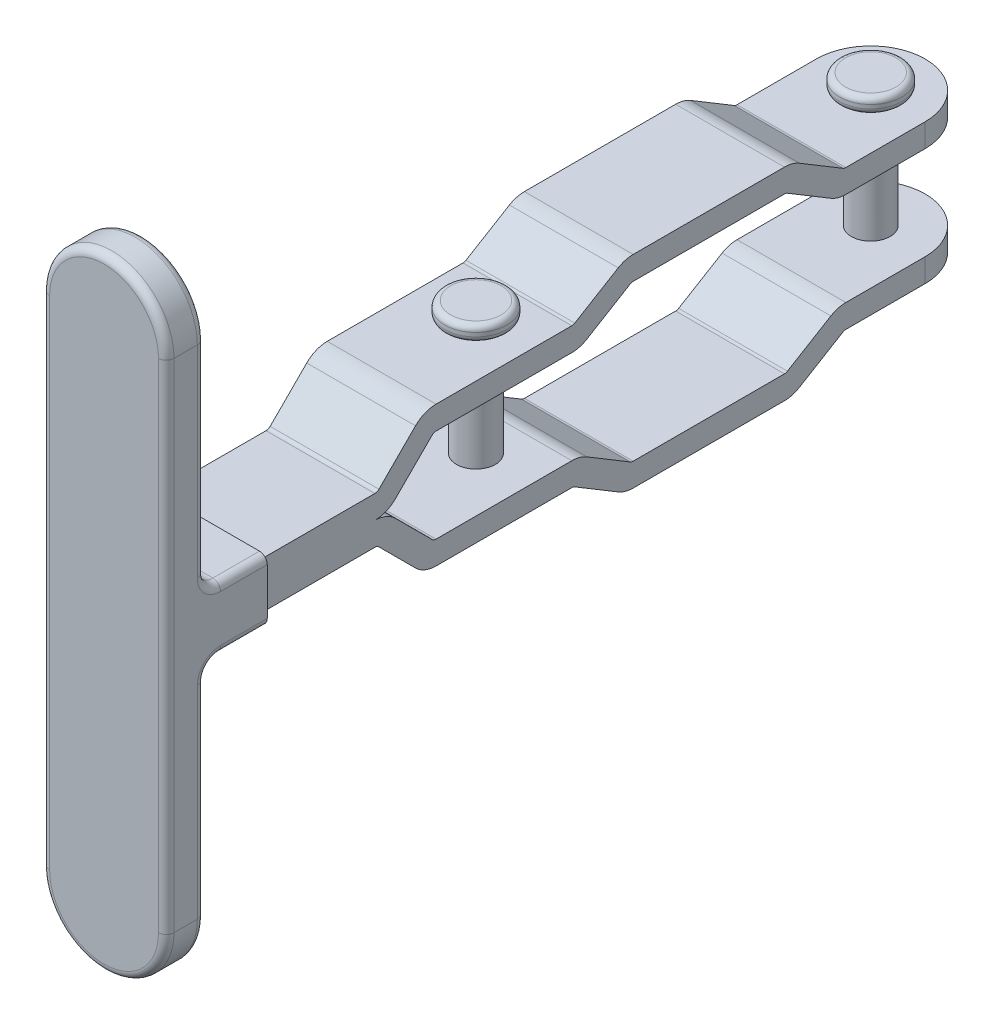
ISO-10303-21;
HEADER;
FILE_DESCRIPTION(('STEP AP214'),'2;1');
FILE_NAME('part.step','',(''),(''),'','','');
FILE_SCHEMA(('AUTOMOTIVE_DESIGN { 1 0 10303 214 1 1 1 1 }'));
ENDSEC;
DATA;
#1=APPLICATION_CONTEXT('core data for automotive mechanical design processes');
#2=APPLICATION_PROTOCOL_DEFINITION('international standard','automotive_design',2000,#1);
#3=PRODUCT_CONTEXT('',#1,'mechanical');
#4=PRODUCT('Part','Part','',(#3));
#5=PRODUCT_RELATED_PRODUCT_CATEGORY('part','',(#4));
#6=PRODUCT_DEFINITION_FORMATION('','',#4);
#7=PRODUCT_DEFINITION_CONTEXT('part definition',#1,'design');
#8=PRODUCT_DEFINITION('design','',#6,#7);
#9=PRODUCT_DEFINITION_SHAPE('','',#8);
#10=(LENGTH_UNIT() NAMED_UNIT(*) SI_UNIT(.MILLI.,.METRE.));
#11=(NAMED_UNIT(*) PLANE_ANGLE_UNIT() SI_UNIT($,.RADIAN.));
#12=(NAMED_UNIT(*) SI_UNIT($,.STERADIAN.) SOLID_ANGLE_UNIT());
#13=UNCERTAINTY_MEASURE_WITH_UNIT(LENGTH_MEASURE(1.E-05),#10,'distance_accuracy_value','');
#14=(GEOMETRIC_REPRESENTATION_CONTEXT(3) GLOBAL_UNCERTAINTY_ASSIGNED_CONTEXT((#13)) GLOBAL_UNIT_ASSIGNED_CONTEXT((#10,
#11,#12)) REPRESENTATION_CONTEXT('',''));
#15=CARTESIAN_POINT('',(0.,0.,0.));
#16=DIRECTION('',(0.,0.,1.));
#17=DIRECTION('',(1.,0.,0.));
#18=AXIS2_PLACEMENT_3D('',#15,#16,#17);
#19=CARTESIAN_POINT('',(-8.39090407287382,-11.02,3.08897146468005));
#20=DIRECTION('',(0.,-1.,0.));
#21=DIRECTION('',(-0.345467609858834,0.,-0.938430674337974));
#22=AXIS2_PLACEMENT_3D('',#19,#20,#21);
#23=PLANE('',#22);
#24=CARTESIAN_POINT('',(0.,-11.02,0.));
#25=DIRECTION('',(0.,-1.,0.));
#26=DIRECTION('',(-0.345467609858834,0.,-0.938430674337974));
#27=AXIS2_PLACEMENT_3D('',#24,#25,#26);
#28=CIRCLE('',#27,3.25);
#29=CARTESIAN_POINT('',(-1.12276973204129,-11.02,-3.04989969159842));
#30=VERTEX_POINT('',#29);
#31=EDGE_CURVE('E4298',#30,#30,#28,.T.);
#32=ORIENTED_EDGE('',*,*,#31,.T.);
#33=EDGE_LOOP('',(#32));
#34=FACE_BOUND('',#33,.T.);
#35=ADVANCED_FACE('F14',(#34),#23,.T.);
#36=CARTESIAN_POINT('',(0.,-10.27,0.));
#37=DIRECTION('',(0.,-1.,0.));
#38=DIRECTION('',(-0.345467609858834,0.,-0.938430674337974));
#39=AXIS2_PLACEMENT_3D('',#36,#37,#38);
#40=TOROIDAL_SURFACE('',#39,3.25,0.75);
#41=ORIENTED_EDGE('',*,*,#31,.F.);
#42=EDGE_LOOP('',(#41));
#43=FACE_BOUND('',#42,.T.);
#44=CARTESIAN_POINT('',(0.,-10.27,0.));
#45=DIRECTION('',(0.,1.,0.));
#46=DIRECTION('',(-0.345467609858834,0.,-0.938430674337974));
#47=AXIS2_PLACEMENT_3D('',#44,#45,#46);
#48=CIRCLE('',#47,4.);
#49=CARTESIAN_POINT('',(-1.38187043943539,-10.27,-3.7537226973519));
#50=VERTEX_POINT('',#49);
#51=EDGE_CURVE('E4322',#50,#50,#48,.T.);
#52=ORIENTED_EDGE('',*,*,#51,.F.);
#53=EDGE_LOOP('',(#52));
#54=FACE_BOUND('',#53,.T.);
#55=ADVANCED_FACE('F1231',(#43,#54),#40,.T.);
#56=CARTESIAN_POINT('',(0.,-9.02,0.));
#57=DIRECTION('',(0.,-1.,0.));
#58=DIRECTION('',(-0.345467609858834,0.,-0.938430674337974));
#59=AXIS2_PLACEMENT_3D('',#56,#57,#58);
#60=CYLINDRICAL_SURFACE('',#59,4.);
#61=ORIENTED_EDGE('',*,*,#51,.T.);
#62=EDGE_LOOP('',(#61));
#63=FACE_BOUND('',#62,.T.);
#64=CARTESIAN_POINT('',(0.,-9.77,0.));
#65=DIRECTION('',(0.,-1.,0.));
#66=DIRECTION('',(0.345467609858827,0.,0.938430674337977));
#67=AXIS2_PLACEMENT_3D('',#64,#65,#66);
#68=CIRCLE('',#67,4.);
#69=CARTESIAN_POINT('',(1.38187043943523,-9.77,3.75372269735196));
#70=VERTEX_POINT('',#69);
#71=EDGE_CURVE('E4309',#70,#70,#68,.T.);
#72=ORIENTED_EDGE('',*,*,#71,.T.);
#73=EDGE_LOOP('',(#72));
#74=FACE_BOUND('',#73,.T.);
#75=ADVANCED_FACE('F1220',(#63,#74),#60,.T.);
#76=CARTESIAN_POINT('',(0.,-9.77,0.));
#77=DIRECTION('',(0.,1.,0.));
#78=DIRECTION('',(0.345467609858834,0.,0.938430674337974));
#79=AXIS2_PLACEMENT_3D('',#76,#77,#78);
#80=TOROIDAL_SURFACE('',#79,3.25,0.75);
#81=CARTESIAN_POINT('',(0.,-9.02,0.));
#82=DIRECTION('',(0.,1.,0.));
#83=DIRECTION('',(0.345467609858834,0.,0.938430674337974));
#84=AXIS2_PLACEMENT_3D('',#81,#82,#83);
#85=CIRCLE('',#84,3.25);
#86=CARTESIAN_POINT('',(1.12276973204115,-9.02,3.04989969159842));
#87=VERTEX_POINT('',#86);
#88=EDGE_CURVE('E4302',#87,#87,#85,.T.);
#89=ORIENTED_EDGE('',*,*,#88,.F.);
#90=EDGE_LOOP('',(#89));
#91=FACE_BOUND('',#90,.T.);
#92=ORIENTED_EDGE('',*,*,#71,.F.);
#93=EDGE_LOOP('',(#92));
#94=FACE_BOUND('',#93,.T.);
#95=ADVANCED_FACE('F1207',(#91,#94),#80,.T.);
#96=CARTESIAN_POINT('',(-8.39090407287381,11.02,3.08897146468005));
#97=DIRECTION('',(0.,-1.,0.));
#98=DIRECTION('',(-0.345467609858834,0.,-0.938430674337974));
#99=AXIS2_PLACEMENT_3D('',#96,#97,#98);
#100=PLANE('',#99);
#101=CARTESIAN_POINT('',(0.,11.02,0.));
#102=DIRECTION('',(0.,1.,0.));
#103=DIRECTION('',(-0.345467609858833,0.,-0.938430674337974));
#104=AXIS2_PLACEMENT_3D('',#101,#102,#103);
#105=CIRCLE('',#104,3.25);
#106=CARTESIAN_POINT('',(-1.12276973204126,11.02,-3.04989969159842));
#107=VERTEX_POINT('',#106);
#108=EDGE_CURVE('E4319',#107,#107,#105,.T.);
#109=ORIENTED_EDGE('',*,*,#108,.T.);
#110=EDGE_LOOP('',(#109));
#111=FACE_BOUND('',#110,.T.);
#112=ADVANCED_FACE('F1195',(#111),#100,.F.);
#113=CARTESIAN_POINT('',(0.,10.27,0.));
#114=DIRECTION('',(0.,-1.,0.));
#115=DIRECTION('',(-0.345467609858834,0.,-0.938430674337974));
#116=AXIS2_PLACEMENT_3D('',#113,#114,#115);
#117=TOROIDAL_SURFACE('',#116,3.25,0.75);
#118=CARTESIAN_POINT('',(0.,10.27,0.));
#119=DIRECTION('',(0.,-1.,0.));
#120=DIRECTION('',(-0.345467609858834,0.,-0.938430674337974));
#121=AXIS2_PLACEMENT_3D('',#118,#119,#120);
#122=CIRCLE('',#121,4.);
#123=CARTESIAN_POINT('',(-1.38187043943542,10.27,-3.7537226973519));
#124=VERTEX_POINT('',#123);
#125=EDGE_CURVE('E4310',#124,#124,#122,.T.);
#126=ORIENTED_EDGE('',*,*,#125,.F.);
#127=EDGE_LOOP('',(#126));
#128=FACE_BOUND('',#127,.T.);
#129=ORIENTED_EDGE('',*,*,#108,.F.);
#130=EDGE_LOOP('',(#129));
#131=FACE_BOUND('',#130,.T.);
#132=ADVANCED_FACE('F1184',(#128,#131),#117,.T.);
#133=CARTESIAN_POINT('',(0.,9.02,0.));
#134=DIRECTION('',(0.,1.,0.));
#135=DIRECTION('',(0.345467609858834,0.,0.938430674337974));
#136=AXIS2_PLACEMENT_3D('',#133,#134,#135);
#137=CYLINDRICAL_SURFACE('',#136,4.);
#138=ORIENTED_EDGE('',*,*,#125,.T.);
#139=EDGE_LOOP('',(#138));
#140=FACE_BOUND('',#139,.T.);
#141=CARTESIAN_POINT('',(0.,9.77,0.));
#142=DIRECTION('',(0.,1.,0.));
#143=DIRECTION('',(-0.345467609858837,0.,-0.938430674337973));
#144=AXIS2_PLACEMENT_3D('',#141,#142,#143);
#145=CIRCLE('',#144,4.);
#146=CARTESIAN_POINT('',(-1.38187043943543,9.77,-3.75372269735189));
#147=VERTEX_POINT('',#146);
#148=EDGE_CURVE('E4314',#147,#147,#145,.T.);
#149=ORIENTED_EDGE('',*,*,#148,.T.);
#150=EDGE_LOOP('',(#149));
#151=FACE_BOUND('',#150,.T.);
#152=ADVANCED_FACE('F1172',(#140,#151),#137,.T.);
#153=CARTESIAN_POINT('',(0.,9.77,0.));
#154=DIRECTION('',(0.,-1.,0.));
#155=DIRECTION('',(-0.345467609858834,0.,-0.938430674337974));
#156=AXIS2_PLACEMENT_3D('',#153,#154,#155);
#157=TOROIDAL_SURFACE('',#156,3.25,0.75);
#158=CARTESIAN_POINT('',(0.,9.02,0.));
#159=DIRECTION('',(0.,-1.,0.));
#160=DIRECTION('',(-0.345467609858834,0.,-0.938430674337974));
#161=AXIS2_PLACEMENT_3D('',#158,#159,#160);
#162=CIRCLE('',#161,3.25);
#163=CARTESIAN_POINT('',(-1.12276973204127,9.02,-3.04989969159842));
#164=VERTEX_POINT('',#163);
#165=EDGE_CURVE('E4315',#164,#164,#162,.T.);
#166=ORIENTED_EDGE('',*,*,#165,.F.);
#167=EDGE_LOOP('',(#166));
#168=FACE_BOUND('',#167,.T.);
#169=ORIENTED_EDGE('',*,*,#148,.F.);
#170=EDGE_LOOP('',(#169));
#171=FACE_BOUND('',#170,.T.);
#172=ADVANCED_FACE('F1074',(#168,#171),#157,.T.);
#173=CARTESIAN_POINT('',(0.,-11.02,0.));
#174=DIRECTION('',(0.,1.,0.));
#175=DIRECTION('',(0.345467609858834,0.,0.938430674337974));
#176=AXIS2_PLACEMENT_3D('',#173,#174,#175);
#177=CYLINDRICAL_SURFACE('',#176,2.5);
#178=CARTESIAN_POINT('',(0.,6.02,0.));
#179=DIRECTION('',(0.,1.,0.));
#180=DIRECTION('',(-1.,0.,0.));
#181=AXIS2_PLACEMENT_3D('',#178,#179,#180);
#182=CIRCLE('',#181,2.5);
#183=CARTESIAN_POINT('',(-2.50000000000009,6.02000000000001,0.));
#184=VERTEX_POINT('',#183);
#185=EDGE_CURVE('E24',#184,#184,#182,.F.);
#186=ORIENTED_EDGE('',*,*,#185,.T.);
#187=EDGE_LOOP('',(#186));
#188=FACE_BOUND('',#187,.T.);
#189=CARTESIAN_POINT('',(0.,-6.0199999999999,0.));
#190=DIRECTION('',(0.,-1.,0.));
#191=DIRECTION('',(0.,0.,-1.));
#192=AXIS2_PLACEMENT_3D('',#189,#190,#191);
#193=CIRCLE('',#192,2.5);
#194=CARTESIAN_POINT('',(0.,-6.0199999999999,-2.5));
#195=VERTEX_POINT('',#194);
#196=EDGE_CURVE('E9',#195,#195,#193,.F.);
#197=ORIENTED_EDGE('',*,*,#196,.T.);
#198=EDGE_LOOP('',(#197));
#199=FACE_BOUND('',#198,.T.);
#200=ADVANCED_FACE('F1064',(#188,#199),#177,.T.);
#201=CARTESIAN_POINT('',(8.00000000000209,-6.00000000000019,93.6497081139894));
#202=DIRECTION('',(0.,0.,1.));
#203=DIRECTION('',(0.,1.,0.));
#204=AXIS2_PLACEMENT_3D('',#201,#202,#203);
#205=PLANE('',#204);
#206=DIRECTION('',(-1.,0.,0.));
#207=VECTOR('',#206,1.);
#208=CARTESIAN_POINT('',(8.00000000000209,-6.00000000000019,93.6497081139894));
#209=LINE('',#208,#207);
#210=CARTESIAN_POINT('',(7.00000000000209,-6.00000000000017,93.6497081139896));
#211=VERTEX_POINT('',#210);
#212=CARTESIAN_POINT('',(-6.99999999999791,-6.,93.6497081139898));
#213=VERTEX_POINT('',#212);
#214=EDGE_CURVE('E500',#211,#213,#209,.T.);
#215=ORIENTED_EDGE('',*,*,#214,.F.);
#216=DIRECTION('',(0.,-1.,0.));
#217=VECTOR('',#216,1.);
#218=CARTESIAN_POINT('',(7.00000000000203,-32.0207081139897,93.6497081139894));
#219=LINE('',#218,#217);
#220=CARTESIAN_POINT('',(7.00000000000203,-32.0207081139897,93.6497081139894));
#221=VERTEX_POINT('',#220);
#222=EDGE_CURVE('E508',#211,#221,#219,.T.);
#223=ORIENTED_EDGE('',*,*,#222,.T.);
#224=CARTESIAN_POINT('',(2.19182311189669E-12,-32.0207081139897,93.6497081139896));
#225=DIRECTION('',(0.,0.,-1.));
#226=DIRECTION('',(0.,-1.,0.));
#227=AXIS2_PLACEMENT_3D('',#224,#225,#226);
#228=CIRCLE('',#227,7.);
#229=CARTESIAN_POINT('',(-6.99999999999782,-32.0207081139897,93.6497081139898));
#230=VERTEX_POINT('',#229);
#231=EDGE_CURVE('E513',#221,#230,#228,.T.);
#232=ORIENTED_EDGE('',*,*,#231,.T.);
#233=DIRECTION('',(0.,1.,0.));
#234=VECTOR('',#233,1.);
#235=CARTESIAN_POINT('',(-6.99999999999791,-6.,93.6497081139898));
#236=LINE('',#235,#234);
#237=EDGE_CURVE('E934',#230,#213,#236,.T.);
#238=ORIENTED_EDGE('',*,*,#237,.T.);
#239=EDGE_LOOP('',(#215,#223,#232,#238));
#240=FACE_BOUND('',#239,.T.);
#241=ADVANCED_FACE('F1061',(#240),#205,.F.);
#242=CARTESIAN_POINT('',(2.21177243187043E-12,-32.0207081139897,94.6497081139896));
#243=DIRECTION('',(0.,0.,1.));
#244=DIRECTION('',(0.,-1.,0.));
#245=AXIS2_PLACEMENT_3D('',#242,#243,#244);
#246=TOROIDAL_SURFACE('',#245,7.,1.);
#247=CARTESIAN_POINT('',(7.00000000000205,-32.0207081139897,94.6497081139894));
#248=DIRECTION('',(0.,1.,0.));
#249=DIRECTION('',(0.,0.,1.));
#250=AXIS2_PLACEMENT_3D('',#247,#248,#249);
#251=CIRCLE('',#250,1.);
#252=CARTESIAN_POINT('',(8.00000000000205,-32.0207081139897,94.6497081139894));
#253=VERTEX_POINT('',#252);
#254=EDGE_CURVE('E471',#253,#221,#251,.T.);
#255=ORIENTED_EDGE('',*,*,#254,.F.);
#256=CARTESIAN_POINT('',(2.21177243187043E-12,-32.0207081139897,94.6497081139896));
#257=DIRECTION('',(0.,0.,1.));
#258=DIRECTION('',(0.,-1.,0.));
#259=AXIS2_PLACEMENT_3D('',#256,#257,#258);
#260=CIRCLE('',#259,8.);
#261=CARTESIAN_POINT('',(-7.99999999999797,-32.0207081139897,94.6497081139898));
#262=VERTEX_POINT('',#261);
#263=EDGE_CURVE('E507',#262,#253,#260,.T.);
#264=ORIENTED_EDGE('',*,*,#263,.F.);
#265=CARTESIAN_POINT('',(-6.99999999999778,-32.0207081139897,94.6497081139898));
#266=DIRECTION('',(0.,-1.,0.));
#267=DIRECTION('',(0.,0.,-1.));
#268=AXIS2_PLACEMENT_3D('',#265,#266,#267);
#269=CIRCLE('',#268,1.);
#270=EDGE_CURVE('E502',#262,#230,#269,.T.);
#271=ORIENTED_EDGE('',*,*,#270,.T.);
#272=ORIENTED_EDGE('',*,*,#231,.F.);
#273=EDGE_LOOP('',(#255,#264,#271,#272));
#274=FACE_BOUND('',#273,.T.);
#275=ADVANCED_FACE('F1063',(#274),#246,.T.);
#276=CARTESIAN_POINT('',(8.00000000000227,39.9792918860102,98.6497081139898));
#277=DIRECTION('',(0.,0.,-1.));
#278=DIRECTION('',(-1.,0.,0.));
#279=AXIS2_PLACEMENT_3D('',#276,#277,#278);
#280=PLANE('',#279);
#281=DIRECTION('',(0.,1.,0.));
#282=VECTOR('',#281,1.);
#283=CARTESIAN_POINT('',(7.00000000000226,31.9792918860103,98.6497081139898));
#284=LINE('',#283,#282);
#285=CARTESIAN_POINT('',(7.00000000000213,-32.0207081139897,98.6497081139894));
#286=VERTEX_POINT('',#285);
#287=CARTESIAN_POINT('',(7.00000000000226,31.9792918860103,98.6497081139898));
#288=VERTEX_POINT('',#287);
#289=EDGE_CURVE('E908',#286,#288,#284,.T.);
#290=ORIENTED_EDGE('',*,*,#289,.T.);
#291=CARTESIAN_POINT('',(2.25860996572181E-12,31.9792918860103,98.64970811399));
#292=DIRECTION('',(0.,0.,1.));
#293=DIRECTION('',(0.,1.,0.));
#294=AXIS2_PLACEMENT_3D('',#291,#292,#293);
#295=CIRCLE('',#294,7.);
#296=CARTESIAN_POINT('',(-6.99999999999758,31.9792918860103,98.64970811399));
#297=VERTEX_POINT('',#296);
#298=EDGE_CURVE('E482',#288,#297,#295,.T.);
#299=ORIENTED_EDGE('',*,*,#298,.T.);
#300=DIRECTION('',(0.,-1.,0.));
#301=VECTOR('',#300,1.);
#302=CARTESIAN_POINT('',(-6.99999999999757,39.9792918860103,98.64970811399));
#303=LINE('',#302,#301);
#304=CARTESIAN_POINT('',(-6.99999999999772,-32.0207081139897,98.6497081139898));
#305=VERTEX_POINT('',#304);
#306=EDGE_CURVE('E478',#297,#305,#303,.T.);
#307=ORIENTED_EDGE('',*,*,#306,.T.);
#308=CARTESIAN_POINT('',(2.29156971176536E-12,-32.0207081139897,98.6497081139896));
#309=DIRECTION('',(0.,0.,1.));
#310=DIRECTION('',(0.,1.,0.));
#311=AXIS2_PLACEMENT_3D('',#308,#309,#310);
#312=CIRCLE('',#311,7.);
#313=EDGE_CURVE('E483',#305,#286,#312,.T.);
#314=ORIENTED_EDGE('',*,*,#313,.T.);
#315=EDGE_LOOP('',(#290,#299,#307,#314));
#316=FACE_BOUND('',#315,.T.);
#317=ADVANCED_FACE('F1071',(#316),#280,.F.);
#318=CARTESIAN_POINT('',(2.27162039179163E-12,-32.0207081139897,97.6497081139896));
#319=DIRECTION('',(0.,0.,-1.));
#320=DIRECTION('',(0.,1.,0.));
#321=AXIS2_PLACEMENT_3D('',#318,#319,#320);
#322=TOROIDAL_SURFACE('',#321,7.,1.);
#323=CARTESIAN_POINT('',(-6.99999999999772,-32.0207081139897,97.6497081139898));
#324=DIRECTION('',(0.,1.,0.));
#325=DIRECTION('',(0.,0.,1.));
#326=AXIS2_PLACEMENT_3D('',#323,#324,#325);
#327=CIRCLE('',#326,1.);
#328=CARTESIAN_POINT('',(-7.99999999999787,-32.0207081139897,97.6497081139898));
#329=VERTEX_POINT('',#328);
#330=EDGE_CURVE('E933',#329,#305,#327,.T.);
#331=ORIENTED_EDGE('',*,*,#330,.F.);
#332=CARTESIAN_POINT('',(2.27162039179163E-12,-32.0207081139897,97.6497081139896));
#333=DIRECTION('',(0.,0.,-1.));
#334=DIRECTION('',(0.,1.,0.));
#335=AXIS2_PLACEMENT_3D('',#332,#333,#334);
#336=CIRCLE('',#335,8.);
#337=CARTESIAN_POINT('',(8.00000000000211,-32.0207081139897,97.6497081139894));
#338=VERTEX_POINT('',#337);
#339=EDGE_CURVE('E574',#338,#329,#336,.T.);
#340=ORIENTED_EDGE('',*,*,#339,.F.);
#341=CARTESIAN_POINT('',(7.00000000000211,-32.0207081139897,97.6497081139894));
#342=DIRECTION('',(0.,1.,0.));
#343=DIRECTION('',(0.,0.,1.));
#344=AXIS2_PLACEMENT_3D('',#341,#342,#343);
#345=CIRCLE('',#344,1.);
#346=EDGE_CURVE('E949',#286,#338,#345,.T.);
#347=ORIENTED_EDGE('',*,*,#346,.F.);
#348=ORIENTED_EDGE('',*,*,#313,.F.);
#349=EDGE_LOOP('',(#331,#340,#347,#348));
#350=FACE_BOUND('',#349,.T.);
#351=ADVANCED_FACE('F1019',(#350),#322,.T.);
#352=CARTESIAN_POINT('',(2.23866064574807E-12,31.9792918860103,97.64970811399));
#353=DIRECTION('',(0.,0.,-1.));
#354=DIRECTION('',(0.,1.,0.));
#355=AXIS2_PLACEMENT_3D('',#352,#353,#354);
#356=TOROIDAL_SURFACE('',#355,7.,1.);
#357=CARTESIAN_POINT('',(7.00000000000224,31.9792918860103,97.6497081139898));
#358=DIRECTION('',(0.,1.,0.));
#359=DIRECTION('',(0.,0.,1.));
#360=AXIS2_PLACEMENT_3D('',#357,#358,#359);
#361=CIRCLE('',#360,1.);
#362=CARTESIAN_POINT('',(8.00000000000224,31.9792918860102,97.6497081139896));
#363=VERTEX_POINT('',#362);
#364=EDGE_CURVE('E929',#288,#363,#361,.T.);
#365=ORIENTED_EDGE('',*,*,#364,.T.);
#366=CARTESIAN_POINT('',(2.23866064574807E-12,31.9792918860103,97.64970811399));
#367=DIRECTION('',(0.,0.,-1.));
#368=DIRECTION('',(0.,1.,0.));
#369=AXIS2_PLACEMENT_3D('',#366,#367,#368);
#370=CIRCLE('',#369,8.);
#371=CARTESIAN_POINT('',(-7.99999999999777,31.9792918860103,97.64970811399));
#372=VERTEX_POINT('',#371);
#373=EDGE_CURVE('E512',#372,#363,#370,.T.);
#374=ORIENTED_EDGE('',*,*,#373,.F.);
#375=CARTESIAN_POINT('',(-6.99999999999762,31.9792918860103,97.64970811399));
#376=DIRECTION('',(0.,1.,0.));
#377=DIRECTION('',(0.,0.,1.));
#378=AXIS2_PLACEMENT_3D('',#375,#376,#377);
#379=CIRCLE('',#378,1.);
#380=EDGE_CURVE('E506',#372,#297,#379,.T.);
#381=ORIENTED_EDGE('',*,*,#380,.T.);
#382=ORIENTED_EDGE('',*,*,#298,.F.);
#383=EDGE_LOOP('',(#365,#374,#381,#382));
#384=FACE_BOUND('',#383,.T.);
#385=ADVANCED_FACE('F1026',(#384),#356,.T.);
#386=CARTESIAN_POINT('',(2.17881268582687E-12,31.9792918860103,94.6497081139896));
#387=DIRECTION('',(0.,0.,1.));
#388=DIRECTION('',(1.,0.,0.));
#389=AXIS2_PLACEMENT_3D('',#386,#387,#388);
#390=TOROIDAL_SURFACE('',#389,7.,1.);
#391=CARTESIAN_POINT('',(7.00000000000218,31.9792918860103,94.6497081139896));
#392=DIRECTION('',(0.,1.,0.));
#393=DIRECTION('',(-1.,0.,0.));
#394=AXIS2_PLACEMENT_3D('',#391,#392,#393);
#395=CIRCLE('',#394,1.);
#396=CARTESIAN_POINT('',(8.00000000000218,31.9792918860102,94.6497081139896));
#397=VERTEX_POINT('',#396);
#398=CARTESIAN_POINT('',(7.00000000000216,31.9792918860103,93.6497081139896));
#399=VERTEX_POINT('',#398);
#400=EDGE_CURVE('E457',#397,#399,#395,.T.);
#401=ORIENTED_EDGE('',*,*,#400,.T.);
#402=CARTESIAN_POINT('',(2.15886336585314E-12,31.9792918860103,93.6497081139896));
#403=DIRECTION('',(0.,0.,-1.));
#404=DIRECTION('',(1.,0.,0.));
#405=AXIS2_PLACEMENT_3D('',#402,#403,#404);
#406=CIRCLE('',#405,7.);
#407=CARTESIAN_POINT('',(-6.99999999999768,31.9792918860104,93.6497081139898));
#408=VERTEX_POINT('',#407);
#409=EDGE_CURVE('E420',#408,#399,#406,.T.);
#410=ORIENTED_EDGE('',*,*,#409,.F.);
#411=CARTESIAN_POINT('',(-6.99999999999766,31.9792918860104,94.6497081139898));
#412=DIRECTION('',(0.,-1.,0.));
#413=DIRECTION('',(1.,0.,0.));
#414=AXIS2_PLACEMENT_3D('',#411,#412,#413);
#415=CIRCLE('',#414,1.);
#416=CARTESIAN_POINT('',(-7.99999999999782,31.9792918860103,94.64970811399));
#417=VERTEX_POINT('',#416);
#418=EDGE_CURVE('E545',#417,#408,#415,.T.);
#419=ORIENTED_EDGE('',*,*,#418,.F.);
#420=CARTESIAN_POINT('',(2.17881268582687E-12,31.9792918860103,94.6497081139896));
#421=DIRECTION('',(0.,0.,1.));
#422=DIRECTION('',(1.,0.,0.));
#423=AXIS2_PLACEMENT_3D('',#420,#421,#422);
#424=CIRCLE('',#423,8.);
#425=EDGE_CURVE('E915',#397,#417,#424,.T.);
#426=ORIENTED_EDGE('',*,*,#425,.F.);
#427=EDGE_LOOP('',(#401,#410,#419,#426));
#428=FACE_BOUND('',#427,.T.);
#429=ADVANCED_FACE('F1043',(#428),#390,.T.);
#430=CARTESIAN_POINT('',(8.00000000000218,39.9792918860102,93.6497081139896));
#431=DIRECTION('',(0.,0.,1.));
#432=DIRECTION('',(0.,1.,0.));
#433=AXIS2_PLACEMENT_3D('',#430,#431,#432);
#434=PLANE('',#433);
#435=ORIENTED_EDGE('',*,*,#409,.T.);
#436=DIRECTION('',(0.,-1.,0.));
#437=VECTOR('',#436,1.);
#438=CARTESIAN_POINT('',(7.00000000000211,6.,93.6497081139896));
#439=LINE('',#438,#437);
#440=CARTESIAN_POINT('',(7.00000000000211,6.,93.6497081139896));
#441=VERTEX_POINT('',#440);
#442=EDGE_CURVE('E529',#399,#441,#439,.T.);
#443=ORIENTED_EDGE('',*,*,#442,.T.);
#444=DIRECTION('',(-1.,0.,0.));
#445=VECTOR('',#444,1.);
#446=CARTESIAN_POINT('',(8.00000000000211,5.99999999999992,93.6497081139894));
#447=LINE('',#446,#445);
#448=CARTESIAN_POINT('',(-6.99999999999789,6.,93.6497081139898));
#449=VERTEX_POINT('',#448);
#450=EDGE_CURVE('E412',#441,#449,#447,.T.);
#451=ORIENTED_EDGE('',*,*,#450,.T.);
#452=DIRECTION('',(0.,1.,0.));
#453=VECTOR('',#452,1.);
#454=CARTESIAN_POINT('',(-6.99999999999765,39.9792918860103,93.6497081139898));
#455=LINE('',#454,#453);
#456=EDGE_CURVE('E565',#449,#408,#455,.T.);
#457=ORIENTED_EDGE('',*,*,#456,.T.);
#458=EDGE_LOOP('',(#435,#443,#451,#457));
#459=FACE_BOUND('',#458,.T.);
#460=ADVANCED_FACE('F1047',(#459),#434,.F.);
#461=CARTESIAN_POINT('',(8.00000000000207,5.99999999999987,91.6497081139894));
#462=DIRECTION('',(-1.,0.,0.));
#463=DIRECTION('',(0.,-1.,0.));
#464=AXIS2_PLACEMENT_3D('',#461,#462,#463);
#465=CYLINDRICAL_SURFACE('',#464,2.);
#466=DIRECTION('',(-1.,0.,0.));
#467=VECTOR('',#466,1.);
#468=CARTESIAN_POINT('',(8.00000000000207,3.99999999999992,91.6497081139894));
#469=LINE('',#468,#467);
#470=CARTESIAN_POINT('',(7.00000000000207,3.99999999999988,91.6497081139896));
#471=VERTEX_POINT('',#470);
#472=CARTESIAN_POINT('',(-6.99999999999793,3.99999999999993,91.6497081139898));
#473=VERTEX_POINT('',#472);
#474=EDGE_CURVE('E409',#471,#473,#469,.T.);
#475=ORIENTED_EDGE('',*,*,#474,.T.);
#476=CARTESIAN_POINT('',(-6.99999999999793,5.99999999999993,91.6497081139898));
#477=DIRECTION('',(-1.,0.,0.));
#478=DIRECTION('',(0.,1.,0.));
#479=AXIS2_PLACEMENT_3D('',#476,#477,#478);
#480=CIRCLE('',#479,2.);
#481=EDGE_CURVE('E419',#473,#449,#480,.T.);
#482=ORIENTED_EDGE('',*,*,#481,.T.);
#483=ORIENTED_EDGE('',*,*,#450,.F.);
#484=CARTESIAN_POINT('',(7.00000000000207,5.99999999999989,91.6497081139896));
#485=DIRECTION('',(1.,0.,0.));
#486=DIRECTION('',(0.,1.,0.));
#487=AXIS2_PLACEMENT_3D('',#484,#485,#486);
#488=CIRCLE('',#487,2.);
#489=EDGE_CURVE('E405',#441,#471,#488,.T.);
#490=ORIENTED_EDGE('',*,*,#489,.T.);
#491=EDGE_LOOP('',(#475,#482,#483,#490));
#492=FACE_BOUND('',#491,.T.);
#493=ADVANCED_FACE('F407',(#492),#465,.F.);
#494=CARTESIAN_POINT('',(-6.99999999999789,-6.,94.6497081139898));
#495=DIRECTION('',(0.,1.,0.));
#496=DIRECTION('',(0.,0.,1.));
#497=AXIS2_PLACEMENT_3D('',#494,#495,#496);
#498=CYLINDRICAL_SURFACE('',#497,1.);
#499=CARTESIAN_POINT('',(-6.99999999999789,-6.,94.6497081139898));
#500=DIRECTION('',(0.,-1.,0.));
#501=DIRECTION('',(0.,0.,-1.));
#502=AXIS2_PLACEMENT_3D('',#499,#500,#501);
#503=CIRCLE('',#502,1.);
#504=CARTESIAN_POINT('',(-7.9999999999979,-6.,94.64970811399));
#505=VERTEX_POINT('',#504);
#506=EDGE_CURVE('E489',#505,#213,#503,.T.);
#507=ORIENTED_EDGE('',*,*,#506,.T.);
#508=ORIENTED_EDGE('',*,*,#237,.F.);
#509=ORIENTED_EDGE('',*,*,#270,.F.);
#510=DIRECTION('',(0.,-1.,0.));
#511=VECTOR('',#510,1.);
#512=CARTESIAN_POINT('',(-7.9999999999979,-6.,94.64970811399));
#513=LINE('',#512,#511);
#514=EDGE_CURVE('E488',#505,#262,#513,.T.);
#515=ORIENTED_EDGE('',*,*,#514,.F.);
#516=EDGE_LOOP('',(#507,#508,#509,#515));
#517=FACE_BOUND('',#516,.T.);
#518=ADVANCED_FACE('F1010',(#517),#498,.T.);
#519=CARTESIAN_POINT('',(-6.99999999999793,5.99999999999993,91.6497081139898));
#520=DIRECTION('',(1.,0.,0.));
#521=DIRECTION('',(0.,1.,0.));
#522=AXIS2_PLACEMENT_3D('',#519,#520,#521);
#523=TOROIDAL_SURFACE('',#522,3.,1.);
#524=CARTESIAN_POINT('',(-6.99999999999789,5.99999999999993,94.6497081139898));
#525=DIRECTION('',(0.,-1.,0.));
#526=DIRECTION('',(0.,0.,-1.));
#527=AXIS2_PLACEMENT_3D('',#524,#525,#526);
#528=CIRCLE('',#527,1.);
#529=CARTESIAN_POINT('',(-7.99999999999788,6.,94.64970811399));
#530=VERTEX_POINT('',#529);
#531=EDGE_CURVE('E549',#530,#449,#528,.T.);
#532=ORIENTED_EDGE('',*,*,#531,.T.);
#533=ORIENTED_EDGE('',*,*,#481,.F.);
#534=CARTESIAN_POINT('',(-6.99999999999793,2.99999999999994,91.6497081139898));
#535=DIRECTION('',(0.,0.,-1.));
#536=DIRECTION('',(-1.,0.,0.));
#537=AXIS2_PLACEMENT_3D('',#534,#535,#536);
#538=CIRCLE('',#537,1.);
#539=CARTESIAN_POINT('',(-7.99999999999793,2.99999999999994,91.6497081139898));
#540=VERTEX_POINT('',#539);
#541=EDGE_CURVE('E558',#540,#473,#538,.T.);
#542=ORIENTED_EDGE('',*,*,#541,.F.);
#543=CARTESIAN_POINT('',(-7.99999999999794,5.99999999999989,91.6497081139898));
#544=DIRECTION('',(1.,0.,0.));
#545=DIRECTION('',(0.,1.,0.));
#546=AXIS2_PLACEMENT_3D('',#543,#544,#545);
#547=CIRCLE('',#546,3.);
#548=EDGE_CURVE('E571',#530,#540,#547,.T.);
#549=ORIENTED_EDGE('',*,*,#548,.F.);
#550=EDGE_LOOP('',(#532,#533,#542,#549));
#551=FACE_BOUND('',#550,.T.);
#552=ADVANCED_FACE('F995',(#551),#523,.T.);
#553=CARTESIAN_POINT('',(-6.99999999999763,39.9792918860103,94.6497081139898));
#554=DIRECTION('',(0.,1.,0.));
#555=DIRECTION('',(-1.,0.,0.));
#556=AXIS2_PLACEMENT_3D('',#553,#554,#555);
#557=CYLINDRICAL_SURFACE('',#556,1.);
#558=ORIENTED_EDGE('',*,*,#418,.T.);
#559=ORIENTED_EDGE('',*,*,#456,.F.);
#560=ORIENTED_EDGE('',*,*,#531,.F.);
#561=DIRECTION('',(0.,-1.,0.));
#562=VECTOR('',#561,1.);
#563=CARTESIAN_POINT('',(-7.9999999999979,-6.,94.64970811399));
#564=LINE('',#563,#562);
#565=EDGE_CURVE('E566',#417,#530,#564,.T.);
#566=ORIENTED_EDGE('',*,*,#565,.F.);
#567=EDGE_LOOP('',(#558,#559,#560,#566));
#568=FACE_BOUND('',#567,.T.);
#569=ADVANCED_FACE('F1049',(#568),#557,.T.);
#570=CARTESIAN_POINT('',(-6.99999999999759,39.9792918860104,97.64970811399));
#571=DIRECTION('',(0.,-1.,0.));
#572=DIRECTION('',(0.,0.,-1.));
#573=AXIS2_PLACEMENT_3D('',#570,#571,#572);
#574=CYLINDRICAL_SURFACE('',#573,1.);
#575=ORIENTED_EDGE('',*,*,#330,.T.);
#576=ORIENTED_EDGE('',*,*,#306,.F.);
#577=ORIENTED_EDGE('',*,*,#380,.F.);
#578=DIRECTION('',(0.,1.,0.));
#579=VECTOR('',#578,1.);
#580=CARTESIAN_POINT('',(-7.99999999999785,-6.,97.64970811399));
#581=LINE('',#580,#579);
#582=EDGE_CURVE('E901',#329,#372,#581,.T.);
#583=ORIENTED_EDGE('',*,*,#582,.F.);
#584=EDGE_LOOP('',(#575,#576,#577,#583));
#585=FACE_BOUND('',#584,.T.);
#586=ADVANCED_FACE('F1022',(#585),#574,.T.);
#587=CARTESIAN_POINT('',(-6.99999999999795,-6.,91.6497081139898));
#588=DIRECTION('',(1.,0.,0.));
#589=DIRECTION('',(0.,1.,0.));
#590=AXIS2_PLACEMENT_3D('',#587,#588,#589);
#591=TOROIDAL_SURFACE('',#590,3.,1.);
#592=CARTESIAN_POINT('',(-6.99999999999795,-3.,91.6497081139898));
#593=DIRECTION('',(0.,0.,1.));
#594=DIRECTION('',(1.,0.,0.));
#595=AXIS2_PLACEMENT_3D('',#592,#593,#594);
#596=CIRCLE('',#595,1.);
#597=CARTESIAN_POINT('',(-7.99999999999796,-3.,91.6497081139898));
#598=VERTEX_POINT('',#597);
#599=CARTESIAN_POINT('',(-6.99999999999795,-4.,91.6497081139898));
#600=VERTEX_POINT('',#599);
#601=EDGE_CURVE('E484',#598,#600,#596,.T.);
#602=ORIENTED_EDGE('',*,*,#601,.T.);
#603=CARTESIAN_POINT('',(-6.99999999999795,-6.,91.6497081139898));
#604=DIRECTION('',(-1.,0.,0.));
#605=DIRECTION('',(0.,1.,0.));
#606=AXIS2_PLACEMENT_3D('',#603,#604,#605);
#607=CIRCLE('',#606,2.);
#608=EDGE_CURVE('E496',#213,#600,#607,.T.);
#609=ORIENTED_EDGE('',*,*,#608,.F.);
#610=ORIENTED_EDGE('',*,*,#506,.F.);
#611=CARTESIAN_POINT('',(-7.99999999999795,-6.,91.6497081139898));
#612=DIRECTION('',(1.,0.,0.));
#613=DIRECTION('',(0.,1.,0.));
#614=AXIS2_PLACEMENT_3D('',#611,#612,#613);
#615=CIRCLE('',#614,3.);
#616=EDGE_CURVE('E477',#598,#505,#615,.T.);
#617=ORIENTED_EDGE('',*,*,#616,.F.);
#618=EDGE_LOOP('',(#602,#609,#610,#617));
#619=FACE_BOUND('',#618,.T.);
#620=ADVANCED_FACE('F1007',(#619),#591,.T.);
#621=CARTESIAN_POINT('',(8.00000000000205,-6.00000000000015,91.6497081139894));
#622=DIRECTION('',(-1.,0.,0.));
#623=DIRECTION('',(0.,-1.,0.));
#624=AXIS2_PLACEMENT_3D('',#621,#622,#623);
#625=CYLINDRICAL_SURFACE('',#624,2.);
#626=DIRECTION('',(-1.,0.,0.));
#627=VECTOR('',#626,1.);
#628=CARTESIAN_POINT('',(8.00000000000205,-4.00000000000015,91.6497081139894));
#629=LINE('',#628,#627);
#630=CARTESIAN_POINT('',(7.00000000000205,-4.00000000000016,91.6497081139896));
#631=VERTEX_POINT('',#630);
#632=EDGE_CURVE('E894',#631,#600,#629,.T.);
#633=ORIENTED_EDGE('',*,*,#632,.F.);
#634=CARTESIAN_POINT('',(7.00000000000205,-6.00000000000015,91.6497081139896));
#635=DIRECTION('',(1.,0.,0.));
#636=DIRECTION('',(0.,1.,0.));
#637=AXIS2_PLACEMENT_3D('',#634,#635,#636);
#638=CIRCLE('',#637,2.);
#639=EDGE_CURVE('E540',#631,#211,#638,.T.);
#640=ORIENTED_EDGE('',*,*,#639,.T.);
#641=ORIENTED_EDGE('',*,*,#214,.T.);
#642=ORIENTED_EDGE('',*,*,#608,.T.);
#643=EDGE_LOOP('',(#633,#640,#641,#642));
#644=FACE_BOUND('',#643,.T.);
#645=ADVANCED_FACE('F1108',(#644),#625,.F.);
#646=CARTESIAN_POINT('',(7.0000000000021,-6.00000000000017,94.6497081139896));
#647=DIRECTION('',(0.,-1.,0.));
#648=DIRECTION('',(0.,0.,-1.));
#649=AXIS2_PLACEMENT_3D('',#646,#647,#648);
#650=CYLINDRICAL_SURFACE('',#649,1.);
#651=ORIENTED_EDGE('',*,*,#254,.T.);
#652=ORIENTED_EDGE('',*,*,#222,.F.);
#653=CARTESIAN_POINT('',(7.0000000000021,-6.00000000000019,94.6497081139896));
#654=DIRECTION('',(0.,1.,0.));
#655=DIRECTION('',(0.,0.,1.));
#656=AXIS2_PLACEMENT_3D('',#653,#654,#655);
#657=CIRCLE('',#656,1.);
#658=CARTESIAN_POINT('',(8.0000000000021,-6.00000000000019,94.6497081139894));
#659=VERTEX_POINT('',#658);
#660=EDGE_CURVE('E455',#659,#211,#657,.T.);
#661=ORIENTED_EDGE('',*,*,#660,.F.);
#662=DIRECTION('',(0.,1.,0.));
#663=VECTOR('',#662,1.);
#664=CARTESIAN_POINT('',(8.0000000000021,-6.00000000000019,94.6497081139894));
#665=LINE('',#664,#663);
#666=EDGE_CURVE('E562',#253,#659,#665,.T.);
#667=ORIENTED_EDGE('',*,*,#666,.F.);
#668=EDGE_LOOP('',(#651,#652,#661,#667));
#669=FACE_BOUND('',#668,.T.);
#670=ADVANCED_FACE('F1111',(#669),#650,.T.);
#671=CARTESIAN_POINT('',(2.19182311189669E-12,-32.0207081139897,93.6497081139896));
#672=DIRECTION('',(0.,0.,-1.));
#673=DIRECTION('',(0.,1.,0.));
#674=AXIS2_PLACEMENT_3D('',#671,#672,#673);
#675=CYLINDRICAL_SURFACE('',#674,8.);
#676=DIRECTION('',(0.,0.,1.));
#677=VECTOR('',#676,1.);
#678=CARTESIAN_POINT('',(-7.99999999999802,-32.0207081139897,91.6497081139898));
#679=LINE('',#678,#677);
#680=EDGE_CURVE('E928',#262,#329,#679,.T.);
#681=ORIENTED_EDGE('',*,*,#680,.F.);
#682=ORIENTED_EDGE('',*,*,#263,.T.);
#683=DIRECTION('',(0.,0.,-1.));
#684=VECTOR('',#683,1.);
#685=CARTESIAN_POINT('',(8.00000000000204,-32.0207081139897,93.6497081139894));
#686=LINE('',#685,#684);
#687=EDGE_CURVE('E544',#338,#253,#686,.T.);
#688=ORIENTED_EDGE('',*,*,#687,.F.);
#689=ORIENTED_EDGE('',*,*,#339,.T.);
#690=EDGE_LOOP('',(#681,#682,#688,#689));
#691=FACE_BOUND('',#690,.T.);
#692=ADVANCED_FACE('F1016',(#691),#675,.T.);
#693=CARTESIAN_POINT('',(7.00000000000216,-6.00000000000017,97.6497081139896));
#694=DIRECTION('',(0.,1.,0.));
#695=DIRECTION('',(0.,0.,1.));
#696=AXIS2_PLACEMENT_3D('',#693,#694,#695);
#697=CYLINDRICAL_SURFACE('',#696,1.);
#698=ORIENTED_EDGE('',*,*,#346,.T.);
#699=DIRECTION('',(0.,-1.,0.));
#700=VECTOR('',#699,1.);
#701=CARTESIAN_POINT('',(8.00000000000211,-32.0207081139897,97.6497081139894));
#702=LINE('',#701,#700);
#703=EDGE_CURVE('E467',#363,#338,#702,.T.);
#704=ORIENTED_EDGE('',*,*,#703,.F.);
#705=ORIENTED_EDGE('',*,*,#364,.F.);
#706=ORIENTED_EDGE('',*,*,#289,.F.);
#707=EDGE_LOOP('',(#698,#704,#705,#706));
#708=FACE_BOUND('',#707,.T.);
#709=ADVANCED_FACE('F1033',(#708),#697,.T.);
#710=CARTESIAN_POINT('',(2.15886336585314E-12,31.9792918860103,93.6497081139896));
#711=DIRECTION('',(0.,0.,1.));
#712=DIRECTION('',(1.,0.,0.));
#713=AXIS2_PLACEMENT_3D('',#710,#711,#712);
#714=CYLINDRICAL_SURFACE('',#713,8.);
#715=DIRECTION('',(0.,0.,1.));
#716=VECTOR('',#715,1.);
#717=CARTESIAN_POINT('',(8.00000000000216,31.9792918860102,93.6497081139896));
#718=LINE('',#717,#716);
#719=EDGE_CURVE('E463',#397,#363,#718,.T.);
#720=ORIENTED_EDGE('',*,*,#719,.F.);
#721=ORIENTED_EDGE('',*,*,#425,.T.);
#722=DIRECTION('',(0.,0.,-1.));
#723=VECTOR('',#722,1.);
#724=CARTESIAN_POINT('',(-7.99999999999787,31.9792918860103,91.64970811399));
#725=LINE('',#724,#723);
#726=EDGE_CURVE('E570',#372,#417,#725,.T.);
#727=ORIENTED_EDGE('',*,*,#726,.F.);
#728=ORIENTED_EDGE('',*,*,#373,.T.);
#729=EDGE_LOOP('',(#720,#721,#727,#728));
#730=FACE_BOUND('',#729,.T.);
#731=ADVANCED_FACE('F1030',(#730),#714,.T.);
#732=CARTESIAN_POINT('',(7.0000000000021,-6.00000000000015,94.6497081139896));
#733=DIRECTION('',(0.,-1.,0.));
#734=DIRECTION('',(1.,0.,0.));
#735=AXIS2_PLACEMENT_3D('',#732,#733,#734);
#736=CYLINDRICAL_SURFACE('',#735,1.);
#737=CARTESIAN_POINT('',(7.00000000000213,6.,94.6497081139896));
#738=DIRECTION('',(0.,1.,0.));
#739=DIRECTION('',(0.,0.,1.));
#740=AXIS2_PLACEMENT_3D('',#737,#738,#739);
#741=CIRCLE('',#740,1.);
#742=CARTESIAN_POINT('',(8.00000000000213,5.99999999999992,94.6497081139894));
#743=VERTEX_POINT('',#742);
#744=EDGE_CURVE('E448',#743,#441,#741,.T.);
#745=ORIENTED_EDGE('',*,*,#744,.T.);
#746=ORIENTED_EDGE('',*,*,#442,.F.);
#747=ORIENTED_EDGE('',*,*,#400,.F.);
#748=DIRECTION('',(0.,1.,0.));
#749=VECTOR('',#748,1.);
#750=CARTESIAN_POINT('',(8.00000000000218,31.9792918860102,94.6497081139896));
#751=LINE('',#750,#749);
#752=EDGE_CURVE('E460',#743,#397,#751,.T.);
#753=ORIENTED_EDGE('',*,*,#752,.F.);
#754=EDGE_LOOP('',(#745,#746,#747,#753));
#755=FACE_BOUND('',#754,.T.);
#756=ADVANCED_FACE('F1045',(#755),#736,.T.);
#757=CARTESIAN_POINT('',(7.00000000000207,5.99999999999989,91.6497081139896));
#758=DIRECTION('',(1.,0.,0.));
#759=DIRECTION('',(0.,1.,0.));
#760=AXIS2_PLACEMENT_3D('',#757,#758,#759);
#761=TOROIDAL_SURFACE('',#760,3.,1.);
#762=CARTESIAN_POINT('',(7.00000000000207,2.99999999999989,91.6497081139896));
#763=DIRECTION('',(0.,0.,1.));
#764=DIRECTION('',(1.,0.,0.));
#765=AXIS2_PLACEMENT_3D('',#762,#763,#764);
#766=CIRCLE('',#765,1.);
#767=CARTESIAN_POINT('',(8.00000000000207,2.99999999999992,91.6497081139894));
#768=VERTEX_POINT('',#767);
#769=EDGE_CURVE('E437',#768,#471,#766,.T.);
#770=ORIENTED_EDGE('',*,*,#769,.T.);
#771=ORIENTED_EDGE('',*,*,#489,.F.);
#772=ORIENTED_EDGE('',*,*,#744,.F.);
#773=CARTESIAN_POINT('',(8.00000000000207,5.99999999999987,91.6497081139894));
#774=DIRECTION('',(-1.,0.,0.));
#775=DIRECTION('',(0.,1.,0.));
#776=AXIS2_PLACEMENT_3D('',#773,#774,#775);
#777=CIRCLE('',#776,3.);
#778=EDGE_CURVE('E444',#768,#743,#777,.T.);
#779=ORIENTED_EDGE('',*,*,#778,.F.);
#780=EDGE_LOOP('',(#770,#771,#772,#779));
#781=FACE_BOUND('',#780,.T.);
#782=ADVANCED_FACE('F442',(#781),#761,.T.);
#783=CARTESIAN_POINT('',(7.00000000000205,-6.00000000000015,91.6497081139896));
#784=DIRECTION('',(1.,0.,0.));
#785=DIRECTION('',(0.,1.,0.));
#786=AXIS2_PLACEMENT_3D('',#783,#784,#785);
#787=TOROIDAL_SURFACE('',#786,3.,1.);
#788=ORIENTED_EDGE('',*,*,#660,.T.);
#789=ORIENTED_EDGE('',*,*,#639,.F.);
#790=CARTESIAN_POINT('',(7.00000000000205,-3.00000000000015,91.6497081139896));
#791=DIRECTION('',(0.,0.,-1.));
#792=DIRECTION('',(-1.,0.,0.));
#793=AXIS2_PLACEMENT_3D('',#790,#791,#792);
#794=CIRCLE('',#793,1.);
#795=CARTESIAN_POINT('',(8.00000000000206,-3.00000000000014,91.6497081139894));
#796=VERTEX_POINT('',#795);
#797=EDGE_CURVE('E447',#796,#631,#794,.T.);
#798=ORIENTED_EDGE('',*,*,#797,.F.);
#799=CARTESIAN_POINT('',(8.00000000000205,-6.00000000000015,91.6497081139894));
#800=DIRECTION('',(-1.,0.,0.));
#801=DIRECTION('',(0.,1.,0.));
#802=AXIS2_PLACEMENT_3D('',#799,#800,#801);
#803=CIRCLE('',#802,3.);
#804=EDGE_CURVE('E518',#659,#796,#803,.T.);
#805=ORIENTED_EDGE('',*,*,#804,.F.);
#806=EDGE_LOOP('',(#788,#789,#798,#805));
#807=FACE_BOUND('',#806,.T.);
#808=ADVANCED_FACE('F1115',(#807),#787,.T.);
#809=CARTESIAN_POINT('',(7.00000000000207,2.99999999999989,91.6497081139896));
#810=DIRECTION('',(0.,0.,-1.));
#811=DIRECTION('',(-1.,0.,0.));
#812=AXIS2_PLACEMENT_3D('',#809,#810,#811);
#813=CYLINDRICAL_SURFACE('',#812,1.);
#814=CARTESIAN_POINT('',(7.00000000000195,2.99999999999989,85.6497081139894));
#815=DIRECTION('',(0.,0.,-1.));
#816=DIRECTION('',(1.,0.,0.));
#817=AXIS2_PLACEMENT_3D('',#814,#815,#816);
#818=CIRCLE('',#817,1.);
#819=CARTESIAN_POINT('',(7.00000000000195,3.99999999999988,85.6497081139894));
#820=VERTEX_POINT('',#819);
#821=CARTESIAN_POINT('',(8.00000000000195,2.99999999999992,85.6497081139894));
#822=VERTEX_POINT('',#821);
#823=EDGE_CURVE('E439',#820,#822,#818,.T.);
#824=ORIENTED_EDGE('',*,*,#823,.F.);
#825=DIRECTION('',(0.,0.,-1.));
#826=VECTOR('',#825,1.);
#827=CARTESIAN_POINT('',(7.00000000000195,3.99999999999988,85.6497081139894));
#828=LINE('',#827,#826);
#829=EDGE_CURVE('E426',#471,#820,#828,.T.);
#830=ORIENTED_EDGE('',*,*,#829,.F.);
#831=ORIENTED_EDGE('',*,*,#769,.F.);
#832=DIRECTION('',(0.,0.,1.));
#833=VECTOR('',#832,1.);
#834=CARTESIAN_POINT('',(8.00000000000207,2.99999999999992,91.6497081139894));
#835=LINE('',#834,#833);
#836=EDGE_CURVE('E534',#822,#768,#835,.T.);
#837=ORIENTED_EDGE('',*,*,#836,.F.);
#838=EDGE_LOOP('',(#824,#830,#831,#837));
#839=FACE_BOUND('',#838,.T.);
#840=ADVANCED_FACE('F435',(#839),#813,.T.);
#841=CARTESIAN_POINT('',(8.00000000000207,3.99999999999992,91.6497081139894));
#842=DIRECTION('',(0.,-1.,0.));
#843=DIRECTION('',(1.,0.,0.));
#844=AXIS2_PLACEMENT_3D('',#841,#842,#843);
#845=PLANE('',#844);
#846=DIRECTION('',(-1.,0.,0.));
#847=VECTOR('',#846,1.);
#848=CARTESIAN_POINT('',(8.00000000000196,3.99999999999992,85.6497081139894));
#849=LINE('',#848,#847);
#850=CARTESIAN_POINT('',(-6.99999999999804,3.99999999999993,85.6497081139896));
#851=VERTEX_POINT('',#850);
#852=EDGE_CURVE('E897',#820,#851,#849,.T.);
#853=ORIENTED_EDGE('',*,*,#852,.T.);
#854=DIRECTION('',(0.,0.,1.));
#855=VECTOR('',#854,1.);
#856=CARTESIAN_POINT('',(-6.99999999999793,3.99999999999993,91.6497081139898));
#857=LINE('',#856,#855);
#858=EDGE_CURVE('E428',#851,#473,#857,.T.);
#859=ORIENTED_EDGE('',*,*,#858,.T.);
#860=ORIENTED_EDGE('',*,*,#474,.F.);
#861=ORIENTED_EDGE('',*,*,#829,.T.);
#862=EDGE_LOOP('',(#853,#859,#860,#861));
#863=FACE_BOUND('',#862,.T.);
#864=ADVANCED_FACE('F425',(#863),#845,.F.);
#865=CARTESIAN_POINT('',(-6.99999999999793,2.99999999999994,91.6497081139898));
#866=DIRECTION('',(0.,0.,1.));
#867=DIRECTION('',(1.,0.,0.));
#868=AXIS2_PLACEMENT_3D('',#865,#866,#867);
#869=CYLINDRICAL_SURFACE('',#868,1.);
#870=CARTESIAN_POINT('',(-6.99999999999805,2.99999999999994,85.6497081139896));
#871=DIRECTION('',(0.,0.,-1.));
#872=DIRECTION('',(1.,0.,0.));
#873=AXIS2_PLACEMENT_3D('',#870,#871,#872);
#874=CIRCLE('',#873,1.);
#875=CARTESIAN_POINT('',(-7.99999999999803,2.99999999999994,85.6497081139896));
#876=VERTEX_POINT('',#875);
#877=EDGE_CURVE('E550',#876,#851,#874,.T.);
#878=ORIENTED_EDGE('',*,*,#877,.F.);
#879=DIRECTION('',(0.,0.,-1.));
#880=VECTOR('',#879,1.);
#881=CARTESIAN_POINT('',(-7.99999999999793,2.99999999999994,91.6497081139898));
#882=LINE('',#881,#880);
#883=EDGE_CURVE('E476',#540,#876,#882,.T.);
#884=ORIENTED_EDGE('',*,*,#883,.F.);
#885=ORIENTED_EDGE('',*,*,#541,.T.);
#886=ORIENTED_EDGE('',*,*,#858,.F.);
#887=EDGE_LOOP('',(#878,#884,#885,#886));
#888=FACE_BOUND('',#887,.T.);
#889=ADVANCED_FACE('F997',(#888),#869,.T.);
#890=CARTESIAN_POINT('',(-7.99999999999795,-6.,91.6497081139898));
#891=DIRECTION('',(1.,0.,0.));
#892=DIRECTION('',(0.,1.,0.));
#893=AXIS2_PLACEMENT_3D('',#890,#891,#892);
#894=PLANE('',#893);
#895=ORIENTED_EDGE('',*,*,#680,.T.);
#896=ORIENTED_EDGE('',*,*,#582,.T.);
#897=ORIENTED_EDGE('',*,*,#726,.T.);
#898=ORIENTED_EDGE('',*,*,#565,.T.);
#899=ORIENTED_EDGE('',*,*,#548,.T.);
#900=ORIENTED_EDGE('',*,*,#883,.T.);
#901=DIRECTION('',(0.,1.,0.));
#902=VECTOR('',#901,1.);
#903=CARTESIAN_POINT('',(-7.99999999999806,3.99999999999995,85.6497081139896));
#904=LINE('',#903,#902);
#905=CARTESIAN_POINT('',(-7.99999999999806,-2.99999999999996,85.6497081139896));
#906=VERTEX_POINT('',#905);
#907=EDGE_CURVE('E554',#906,#876,#904,.T.);
#908=ORIENTED_EDGE('',*,*,#907,.F.);
#909=DIRECTION('',(0.,0.,1.));
#910=VECTOR('',#909,1.);
#911=CARTESIAN_POINT('',(-7.99999999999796,-3.,91.6497081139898));
#912=LINE('',#911,#910);
#913=EDGE_CURVE('E472',#906,#598,#912,.T.);
#914=ORIENTED_EDGE('',*,*,#913,.T.);
#915=ORIENTED_EDGE('',*,*,#616,.T.);
#916=ORIENTED_EDGE('',*,*,#514,.T.);
#917=EDGE_LOOP('',(#895,#896,#897,#898,#899,#900,#908,#914,#915,#916));
#918=FACE_BOUND('',#917,.T.);
#919=ADVANCED_FACE('F16',(#918),#894,.F.);
#920=CARTESIAN_POINT('',(-6.99999999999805,-3.,85.6497081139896));
#921=DIRECTION('',(0.,0.,-1.));
#922=DIRECTION('',(-1.,0.,0.));
#923=AXIS2_PLACEMENT_3D('',#920,#921,#922);
#924=CYLINDRICAL_SURFACE('',#923,1.);
#925=CARTESIAN_POINT('',(-6.99999999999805,-3.,85.6497081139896));
#926=DIRECTION('',(0.,0.,-1.));
#927=DIRECTION('',(1.,0.,0.));
#928=AXIS2_PLACEMENT_3D('',#925,#926,#927);
#929=CIRCLE('',#928,1.);
#930=CARTESIAN_POINT('',(-6.99999999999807,-4.,85.6497081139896));
#931=VERTEX_POINT('',#930);
#932=EDGE_CURVE('E953',#931,#906,#929,.T.);
#933=ORIENTED_EDGE('',*,*,#932,.F.);
#934=DIRECTION('',(0.,0.,-1.));
#935=VECTOR('',#934,1.);
#936=CARTESIAN_POINT('',(-6.99999999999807,-4.,85.6497081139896));
#937=LINE('',#936,#935);
#938=EDGE_CURVE('E524',#600,#931,#937,.T.);
#939=ORIENTED_EDGE('',*,*,#938,.F.);
#940=ORIENTED_EDGE('',*,*,#601,.F.);
#941=ORIENTED_EDGE('',*,*,#913,.F.);
#942=EDGE_LOOP('',(#933,#939,#940,#941));
#943=FACE_BOUND('',#942,.T.);
#944=ADVANCED_FACE('F1005',(#943),#924,.T.);
#945=CARTESIAN_POINT('',(8.00000000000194,-4.00000000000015,85.6497081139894));
#946=DIRECTION('',(0.,1.,0.));
#947=DIRECTION('',(0.,0.,1.));
#948=AXIS2_PLACEMENT_3D('',#945,#946,#947);
#949=PLANE('',#948);
#950=DIRECTION('',(-1.,0.,0.));
#951=VECTOR('',#950,1.);
#952=CARTESIAN_POINT('',(8.00000000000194,-4.00000000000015,85.6497081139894));
#953=LINE('',#952,#951);
#954=CARTESIAN_POINT('',(7.00000000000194,-4.00000000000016,85.6497081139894));
#955=VERTEX_POINT('',#954);
#956=EDGE_CURVE('E525',#955,#931,#953,.T.);
#957=ORIENTED_EDGE('',*,*,#956,.F.);
#958=DIRECTION('',(0.,0.,1.));
#959=VECTOR('',#958,1.);
#960=CARTESIAN_POINT('',(7.00000000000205,-4.00000000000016,91.6497081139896));
#961=LINE('',#960,#959);
#962=EDGE_CURVE('E501',#955,#631,#961,.T.);
#963=ORIENTED_EDGE('',*,*,#962,.T.);
#964=ORIENTED_EDGE('',*,*,#632,.T.);
#965=ORIENTED_EDGE('',*,*,#938,.T.);
#966=EDGE_LOOP('',(#957,#963,#964,#965));
#967=FACE_BOUND('',#966,.T.);
#968=ADVANCED_FACE('F1083',(#967),#949,.F.);
#969=CARTESIAN_POINT('',(7.00000000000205,-3.00000000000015,91.6497081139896));
#970=DIRECTION('',(0.,0.,1.));
#971=DIRECTION('',(1.,0.,0.));
#972=AXIS2_PLACEMENT_3D('',#969,#970,#971);
#973=CYLINDRICAL_SURFACE('',#972,1.);
#974=ORIENTED_EDGE('',*,*,#797,.T.);
#975=ORIENTED_EDGE('',*,*,#962,.F.);
#976=CARTESIAN_POINT('',(7.00000000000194,-3.00000000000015,85.6497081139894));
#977=DIRECTION('',(0.,0.,-1.));
#978=DIRECTION('',(1.,0.,0.));
#979=AXIS2_PLACEMENT_3D('',#976,#977,#978);
#980=CIRCLE('',#979,1.);
#981=CARTESIAN_POINT('',(8.00000000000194,-3.00000000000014,85.6497081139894));
#982=VERTEX_POINT('',#981);
#983=EDGE_CURVE('E520',#982,#955,#980,.T.);
#984=ORIENTED_EDGE('',*,*,#983,.F.);
#985=DIRECTION('',(0.,0.,-1.));
#986=VECTOR('',#985,1.);
#987=CARTESIAN_POINT('',(8.00000000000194,-3.00000000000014,85.6497081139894));
#988=LINE('',#987,#986);
#989=EDGE_CURVE('E514',#796,#982,#988,.T.);
#990=ORIENTED_EDGE('',*,*,#989,.F.);
#991=EDGE_LOOP('',(#974,#975,#984,#990));
#992=FACE_BOUND('',#991,.T.);
#993=ADVANCED_FACE('F1080',(#992),#973,.T.);
#994=CARTESIAN_POINT('',(8.00000000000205,-6.00000000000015,91.6497081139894));
#995=DIRECTION('',(1.,0.,0.));
#996=DIRECTION('',(0.,1.,0.));
#997=AXIS2_PLACEMENT_3D('',#994,#995,#996);
#998=PLANE('',#997);
#999=ORIENTED_EDGE('',*,*,#804,.T.);
#1000=ORIENTED_EDGE('',*,*,#989,.T.);
#1001=DIRECTION('',(0.,1.,0.));
#1002=VECTOR('',#1001,1.);
#1003=CARTESIAN_POINT('',(8.00000000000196,3.99999999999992,85.6497081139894));
#1004=LINE('',#1003,#1002);
#1005=EDGE_CURVE('E519',#982,#822,#1004,.T.);
#1006=ORIENTED_EDGE('',*,*,#1005,.T.);
#1007=ORIENTED_EDGE('',*,*,#836,.T.);
#1008=ORIENTED_EDGE('',*,*,#778,.T.);
#1009=ORIENTED_EDGE('',*,*,#752,.T.);
#1010=ORIENTED_EDGE('',*,*,#719,.T.);
#1011=ORIENTED_EDGE('',*,*,#703,.T.);
#1012=ORIENTED_EDGE('',*,*,#687,.T.);
#1013=ORIENTED_EDGE('',*,*,#666,.T.);
#1014=EDGE_LOOP('',(#999,#1000,#1006,#1007,#1008,#1009,#1010,#1011,#1012,#1013));
#1015=FACE_BOUND('',#1014,.T.);
#1016=ADVANCED_FACE('F1036',(#1015),#998,.T.);
#1017=CARTESIAN_POINT('',(8.00000000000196,3.99999999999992,85.6497081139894));
#1018=DIRECTION('',(0.,0.,1.));
#1019=DIRECTION('',(0.,1.,0.));
#1020=AXIS2_PLACEMENT_3D('',#1017,#1018,#1019);
#1021=PLANE('',#1020);
#1022=ORIENTED_EDGE('',*,*,#1005,.F.);
#1023=ORIENTED_EDGE('',*,*,#983,.T.);
#1024=ORIENTED_EDGE('',*,*,#956,.T.);
#1025=ORIENTED_EDGE('',*,*,#932,.T.);
#1026=ORIENTED_EDGE('',*,*,#907,.T.);
#1027=ORIENTED_EDGE('',*,*,#877,.T.);
#1028=ORIENTED_EDGE('',*,*,#852,.F.);
#1029=ORIENTED_EDGE('',*,*,#823,.T.);
#1030=EDGE_LOOP('',(#1022,#1023,#1024,#1025,#1026,#1027,#1028,#1029));
#1031=FACE_BOUND('',#1030,.T.);
#1032=DIRECTION('',(-1.,0.,0.));
#1033=VECTOR('',#1032,1.);
#1034=CARTESIAN_POINT('',(4.18935719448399E-13,-2.9999999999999,85.6497081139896));
#1035=LINE('',#1034,#1033);
#1036=CARTESIAN_POINT('',(7.00000000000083,-3.,85.6497081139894));
#1037=VERTEX_POINT('',#1036);
#1038=CARTESIAN_POINT('',(-6.99999999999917,-2.99999999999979,85.6497081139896));
#1039=VERTEX_POINT('',#1038);
#1040=EDGE_CURVE('E582',#1037,#1039,#1035,.T.);
#1041=ORIENTED_EDGE('',*,*,#1040,.F.);
#1042=DIRECTION('',(0.,1.,0.));
#1043=VECTOR('',#1042,1.);
#1044=CARTESIAN_POINT('',(7.00000000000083,-3.,85.6497081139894));
#1045=LINE('',#1044,#1043);
#1046=CARTESIAN_POINT('',(7.00000000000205,2.99999999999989,85.6497081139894));
#1047=VERTEX_POINT('',#1046);
#1048=EDGE_CURVE('E18',#1037,#1047,#1045,.T.);
#1049=ORIENTED_EDGE('',*,*,#1048,.T.);
#1050=DIRECTION('',(1.,0.,0.));
#1051=VECTOR('',#1050,1.);
#1052=CARTESIAN_POINT('',(2.03309591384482E-12,2.99999999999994,85.6497081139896));
#1053=LINE('',#1052,#1051);
#1054=CARTESIAN_POINT('',(-6.99999999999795,2.99999999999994,85.6497081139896));
#1055=VERTEX_POINT('',#1054);
#1056=EDGE_CURVE('E578',#1055,#1047,#1053,.T.);
#1057=ORIENTED_EDGE('',*,*,#1056,.F.);
#1058=DIRECTION('',(0.,-1.,0.));
#1059=VECTOR('',#1058,1.);
#1060=CARTESIAN_POINT('',(-6.99999999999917,-2.99999999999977,85.6497081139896));
#1061=LINE('',#1060,#1059);
#1062=EDGE_CURVE('E593',#1055,#1039,#1061,.T.);
#1063=ORIENTED_EDGE('',*,*,#1062,.T.);
#1064=EDGE_LOOP('',(#1041,#1049,#1057,#1063));
#1065=FACE_BOUND('',#1064,.T.);
#1066=ADVANCED_FACE('F999',(#1031,#1065),#1021,.F.);
#1067=CARTESIAN_POINT('',(2.7824964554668E-12,2.99999999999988,125.709));
#1068=DIRECTION('',(0.,1.,0.));
#1069=DIRECTION('',(-1.,0.,0.));
#1070=AXIS2_PLACEMENT_3D('',#1067,#1068,#1069);
#1071=PLANE('',#1070);
#1072=DIRECTION('',(0.,0.,1.));
#1073=VECTOR('',#1072,1.);
#1074=CARTESIAN_POINT('',(-6.99999999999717,2.99999999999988,125.709));
#1075=LINE('',#1074,#1073);
#1076=CARTESIAN_POINT('',(-6.99999999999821,2.99999999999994,70.8031587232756));
#1077=VERTEX_POINT('',#1076);
#1078=EDGE_CURVE('E581',#1077,#1055,#1075,.T.);
#1079=ORIENTED_EDGE('',*,*,#1078,.T.);
#1080=ORIENTED_EDGE('',*,*,#1056,.T.);
#1081=DIRECTION('',(0.,0.,-1.));
#1082=VECTOR('',#1081,1.);
#1083=CARTESIAN_POINT('',(7.00000000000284,2.99999999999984,125.709));
#1084=LINE('',#1083,#1082);
#1085=CARTESIAN_POINT('',(7.00000000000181,2.99999999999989,70.8031587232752));
#1086=VERTEX_POINT('',#1085);
#1087=EDGE_CURVE('E766',#1047,#1086,#1084,.T.);
#1088=ORIENTED_EDGE('',*,*,#1087,.T.);
#1089=DIRECTION('',(1.,0.,0.));
#1090=VECTOR('',#1089,1.);
#1091=CARTESIAN_POINT('',(1.75293807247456E-12,2.99999999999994,70.8031587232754));
#1092=LINE('',#1091,#1090);
#1093=EDGE_CURVE('E691',#1077,#1086,#1092,.T.);
#1094=ORIENTED_EDGE('',*,*,#1093,.F.);
#1095=EDGE_LOOP('',(#1079,#1080,#1088,#1094));
#1096=FACE_BOUND('',#1095,.T.);
#1097=ADVANCED_FACE('F1103',(#1096),#1071,.T.);
#1098=CARTESIAN_POINT('',(8.36628149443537,11.0200000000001,47.6449485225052));
#1099=DIRECTION('',(0.,-1.,0.));
#1100=DIRECTION('',(0.352857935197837,0.,0.93567690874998));
#1101=AXIS2_PLACEMENT_3D('',#1098,#1099,#1100);
#1102=PLANE('',#1101);
#1103=CARTESIAN_POINT('',(1.64798730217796E-13,11.02,50.800000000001));
#1104=DIRECTION('',(0.,1.,0.));
#1105=DIRECTION('',(0.352857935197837,0.,0.93567690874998));
#1106=AXIS2_PLACEMENT_3D('',#1103,#1104,#1105);
#1107=CIRCLE('',#1106,3.25);
#1108=CARTESIAN_POINT('',(1.14678828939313,11.02,53.8409499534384));
#1109=VERTEX_POINT('',#1108);
#1110=EDGE_CURVE('E2336',#1109,#1109,#1107,.T.);
#1111=ORIENTED_EDGE('',*,*,#1110,.T.);
#1112=EDGE_LOOP('',(#1111));
#1113=FACE_BOUND('',#1112,.T.);
#1114=ADVANCED_FACE('F2189',(#1113),#1102,.F.);
#1115=CARTESIAN_POINT('',(1.17874460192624E-12,-2.9999999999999,125.709));
#1116=DIRECTION('',(0.,-1.,0.));
#1117=DIRECTION('',(1.,0.,0.));
#1118=AXIS2_PLACEMENT_3D('',#1115,#1116,#1117);
#1119=PLANE('',#1118);
#1120=DIRECTION('',(0.,0.,1.));
#1121=VECTOR('',#1120,1.);
#1122=CARTESIAN_POINT('',(7.00000000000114,-3.,125.709));
#1123=LINE('',#1122,#1121);
#1124=CARTESIAN_POINT('',(7.00000000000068,-3.,70.8031587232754));
#1125=VERTEX_POINT('',#1124);
#1126=EDGE_CURVE('E596',#1125,#1037,#1123,.T.);
#1127=ORIENTED_EDGE('',*,*,#1126,.T.);
#1128=ORIENTED_EDGE('',*,*,#1040,.T.);
#1129=DIRECTION('',(0.,0.,-1.));
#1130=VECTOR('',#1129,1.);
#1131=CARTESIAN_POINT('',(-6.99999999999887,-2.99999999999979,125.709));
#1132=LINE('',#1131,#1130);
#1133=CARTESIAN_POINT('',(-6.99999999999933,-2.99999999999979,70.8031587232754));
#1134=VERTEX_POINT('',#1133);
#1135=EDGE_CURVE('E599',#1039,#1134,#1132,.T.);
#1136=ORIENTED_EDGE('',*,*,#1135,.T.);
#1137=DIRECTION('',(-1.,0.,0.));
#1138=VECTOR('',#1137,1.);
#1139=CARTESIAN_POINT('',(7.08634539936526E-13,-2.9999999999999,70.8031587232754));
#1140=LINE('',#1139,#1138);
#1141=EDGE_CURVE('E2468',#1125,#1134,#1140,.T.);
#1142=ORIENTED_EDGE('',*,*,#1141,.F.);
#1143=EDGE_LOOP('',(#1127,#1128,#1136,#1142));
#1144=FACE_BOUND('',#1143,.T.);
#1145=ADVANCED_FACE('F1266',(#1144),#1119,.T.);
#1146=CARTESIAN_POINT('',(8.36628149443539,-11.02,47.6449485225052));
#1147=DIRECTION('',(0.,-1.,0.));
#1148=DIRECTION('',(0.352857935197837,0.,0.93567690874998));
#1149=AXIS2_PLACEMENT_3D('',#1146,#1147,#1148);
#1150=PLANE('',#1149);
#1151=CARTESIAN_POINT('',(1.96023752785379E-13,-11.02,50.800000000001));
#1152=DIRECTION('',(0.,-1.,0.));
#1153=DIRECTION('',(0.352857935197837,0.,0.93567690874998));
#1154=AXIS2_PLACEMENT_3D('',#1151,#1152,#1153);
#1155=CIRCLE('',#1154,3.25);
#1156=CARTESIAN_POINT('',(1.14678828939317,-11.02,53.8409499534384));
#1157=VERTEX_POINT('',#1156);
#1158=EDGE_CURVE('E584',#1157,#1157,#1155,.T.);
#1159=ORIENTED_EDGE('',*,*,#1158,.T.);
#1160=EDGE_LOOP('',(#1159));
#1161=FACE_BOUND('',#1160,.T.);
#1162=ADVANCED_FACE('F1260',(#1161),#1150,.T.);
#1163=CARTESIAN_POINT('',(-14.4255019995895,-3.7399999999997,70.8031587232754));
#1164=DIRECTION('',(1.,0.,0.));
#1165=DIRECTION('',(0.,1.,0.));
#1166=AXIS2_PLACEMENT_3D('',#1163,#1164,#1165);
#1167=CYLINDRICAL_SURFACE('',#1166,3.74);
#1168=DIRECTION('',(-1.,0.,0.));
#1169=VECTOR('',#1168,1.);
#1170=CARTESIAN_POINT('',(7.50267903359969E-13,1.35308431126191E-13,70.8031587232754));
#1171=LINE('',#1170,#1169);
#1172=CARTESIAN_POINT('',(7.00000000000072,0.,70.8031587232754));
#1173=VERTEX_POINT('',#1172);
#1174=CARTESIAN_POINT('',(-6.99999999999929,2.32452945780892E-13,70.8031587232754));
#1175=VERTEX_POINT('',#1174);
#1176=EDGE_CURVE('E2447',#1173,#1175,#1171,.T.);
#1177=ORIENTED_EDGE('',*,*,#1176,.F.);
#1178=CARTESIAN_POINT('',(7.00000000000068,-3.74,70.8031587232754));
#1179=DIRECTION('',(1.,0.,0.));
#1180=DIRECTION('',(0.,1.,0.));
#1181=AXIS2_PLACEMENT_3D('',#1178,#1179,#1180);
#1182=CIRCLE('',#1181,3.74);
#1183=CARTESIAN_POINT('',(7.0000000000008,-1.09542063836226,68.1585793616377));
#1184=VERTEX_POINT('',#1183);
#1185=EDGE_CURVE('E2454',#1184,#1173,#1182,.T.);
#1186=ORIENTED_EDGE('',*,*,#1185,.F.);
#1187=DIRECTION('',(-1.,0.,0.));
#1188=VECTOR('',#1187,1.);
#1189=CARTESIAN_POINT('',(7.35522753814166E-13,-1.09542063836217,68.1585793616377));
#1190=LINE('',#1189,#1188);
#1191=CARTESIAN_POINT('',(-6.99999999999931,-1.09542063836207,68.1585793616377));
#1192=VERTEX_POINT('',#1191);
#1193=EDGE_CURVE('E2489',#1184,#1192,#1190,.T.);
#1194=ORIENTED_EDGE('',*,*,#1193,.T.);
#1195=CARTESIAN_POINT('',(-6.99999999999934,-3.7399999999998,70.8031587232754));
#1196=DIRECTION('',(-1.,0.,0.));
#1197=DIRECTION('',(0.,1.,0.));
#1198=AXIS2_PLACEMENT_3D('',#1195,#1196,#1197);
#1199=CIRCLE('',#1198,3.74);
#1200=EDGE_CURVE('E2461',#1175,#1192,#1199,.T.);
#1201=ORIENTED_EDGE('',*,*,#1200,.F.);
#1202=EDGE_LOOP('',(#1177,#1186,#1194,#1201));
#1203=FACE_BOUND('',#1202,.T.);
#1204=ADVANCED_FACE('F1265',(#1203),#1167,.T.);
#1205=CARTESIAN_POINT('',(14.425501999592,3.73999999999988,70.803158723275));
#1206=DIRECTION('',(-1.,0.,0.));
#1207=DIRECTION('',(0.,-1.,0.));
#1208=AXIS2_PLACEMENT_3D('',#1205,#1206,#1207);
#1209=CYLINDRICAL_SURFACE('',#1208,3.74);
#1210=ORIENTED_EDGE('',*,*,#1176,.T.);
#1211=CARTESIAN_POINT('',(-6.99999999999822,3.73999999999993,70.8031587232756));
#1212=DIRECTION('',(-1.,0.,0.));
#1213=DIRECTION('',(0.,-1.,0.));
#1214=AXIS2_PLACEMENT_3D('',#1211,#1212,#1213);
#1215=CIRCLE('',#1214,3.74);
#1216=CARTESIAN_POINT('',(-6.99999999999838,1.09542063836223,68.158579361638));
#1217=VERTEX_POINT('',#1216);
#1218=EDGE_CURVE('E690',#1217,#1175,#1215,.T.);
#1219=ORIENTED_EDGE('',*,*,#1218,.F.);
#1220=DIRECTION('',(1.,0.,0.));
#1221=VECTOR('',#1220,1.);
#1222=CARTESIAN_POINT('',(1.6757428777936E-12,1.09542063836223,68.1585793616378));
#1223=LINE('',#1222,#1221);
#1224=CARTESIAN_POINT('',(7.00000000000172,1.09542063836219,68.1585793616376));
#1225=VERTEX_POINT('',#1224);
#1226=EDGE_CURVE('E644',#1217,#1225,#1223,.T.);
#1227=ORIENTED_EDGE('',*,*,#1226,.T.);
#1228=CARTESIAN_POINT('',(7.00000000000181,3.73999999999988,70.8031587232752));
#1229=DIRECTION('',(1.,0.,0.));
#1230=DIRECTION('',(0.,-1.,0.));
#1231=AXIS2_PLACEMENT_3D('',#1228,#1229,#1230);
#1232=CIRCLE('',#1231,3.74);
#1233=EDGE_CURVE('E686',#1173,#1225,#1232,.T.);
#1234=ORIENTED_EDGE('',*,*,#1233,.F.);
#1235=EDGE_LOOP('',(#1210,#1219,#1227,#1234));
#1236=FACE_BOUND('',#1235,.T.);
#1237=ADVANCED_FACE('F1287',(#1236),#1209,.T.);
#1238=CARTESIAN_POINT('',(14.425501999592,3.73999999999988,70.803158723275));
#1239=DIRECTION('',(-1.,0.,0.));
#1240=DIRECTION('',(0.,-1.,0.));
#1241=AXIS2_PLACEMENT_3D('',#1238,#1239,#1240);
#1242=CYLINDRICAL_SURFACE('',#1241,0.74);
#1243=ORIENTED_EDGE('',*,*,#1093,.T.);
#1244=CARTESIAN_POINT('',(7.00000000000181,3.73999999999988,70.8031587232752));
#1245=DIRECTION('',(1.,0.,0.));
#1246=DIRECTION('',(0.,1.,0.));
#1247=AXIS2_PLACEMENT_3D('',#1244,#1245,#1246);
#1248=CIRCLE('',#1247,0.74);
#1249=CARTESIAN_POINT('',(7.0000000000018,3.21674098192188,70.2798997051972));
#1250=VERTEX_POINT('',#1249);
#1251=EDGE_CURVE('E657',#1086,#1250,#1248,.T.);
#1252=ORIENTED_EDGE('',*,*,#1251,.T.);
#1253=DIRECTION('',(1.,0.,0.));
#1254=VECTOR('',#1253,1.);
#1255=CARTESIAN_POINT('',(1.74513181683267E-12,3.21674098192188,70.2798997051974));
#1256=LINE('',#1255,#1254);
#1257=CARTESIAN_POINT('',(-6.99999999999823,3.21674098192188,70.2798997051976));
#1258=VERTEX_POINT('',#1257);
#1259=EDGE_CURVE('E810',#1258,#1250,#1256,.T.);
#1260=ORIENTED_EDGE('',*,*,#1259,.F.);
#1261=CARTESIAN_POINT('',(-6.99999999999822,3.73999999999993,70.8031587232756));
#1262=DIRECTION('',(-1.,0.,0.));
#1263=DIRECTION('',(0.,-1.,0.));
#1264=AXIS2_PLACEMENT_3D('',#1261,#1262,#1263);
#1265=CIRCLE('',#1264,0.74);
#1266=EDGE_CURVE('E647',#1258,#1077,#1265,.T.);
#1267=ORIENTED_EDGE('',*,*,#1266,.T.);
#1268=EDGE_LOOP('',(#1243,#1252,#1260,#1267));
#1269=FACE_BOUND('',#1268,.T.);
#1270=ADVANCED_FACE('F1300',(#1269),#1242,.F.);
#1271=CARTESIAN_POINT('',(1.94289029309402E-13,10.27,50.800000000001));
#1272=DIRECTION('',(0.,-1.,0.));
#1273=DIRECTION('',(0.352857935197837,0.,0.93567690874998));
#1274=AXIS2_PLACEMENT_3D('',#1271,#1272,#1273);
#1275=TOROIDAL_SURFACE('',#1274,3.25,0.75);
#1276=CARTESIAN_POINT('',(1.94289029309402E-13,10.27,50.800000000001));
#1277=DIRECTION('',(0.,-1.,0.));
#1278=DIRECTION('',(0.352857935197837,0.,0.93567690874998));
#1279=AXIS2_PLACEMENT_3D('',#1276,#1277,#1278);
#1280=CIRCLE('',#1279,4.);
#1281=CARTESIAN_POINT('',(1.41143174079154,10.27,54.5427076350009));
#1282=VERTEX_POINT('',#1281);
#1283=EDGE_CURVE('E2317',#1282,#1282,#1280,.T.);
#1284=ORIENTED_EDGE('',*,*,#1283,.F.);
#1285=EDGE_LOOP('',(#1284));
#1286=FACE_BOUND('',#1285,.T.);
#1287=ORIENTED_EDGE('',*,*,#1110,.F.);
#1288=EDGE_LOOP('',(#1287));
#1289=FACE_BOUND('',#1288,.T.);
#1290=ADVANCED_FACE('F1313',(#1286,#1289),#1275,.T.);
#1291=CARTESIAN_POINT('',(-14.4255019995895,-3.7399999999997,70.8031587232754));
#1292=DIRECTION('',(1.,0.,0.));
#1293=DIRECTION('',(0.,1.,0.));
#1294=AXIS2_PLACEMENT_3D('',#1291,#1292,#1293);
#1295=CYLINDRICAL_SURFACE('',#1294,0.74);
#1296=ORIENTED_EDGE('',*,*,#1141,.T.);
#1297=CARTESIAN_POINT('',(-6.99999999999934,-3.7399999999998,70.8031587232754));
#1298=DIRECTION('',(-1.,0.,0.));
#1299=DIRECTION('',(0.,-1.,0.));
#1300=AXIS2_PLACEMENT_3D('',#1297,#1298,#1299);
#1301=CIRCLE('',#1300,0.74);
#1302=CARTESIAN_POINT('',(-6.99999999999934,-3.21674098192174,70.2798997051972));
#1303=VERTEX_POINT('',#1302);
#1304=EDGE_CURVE('E2475',#1134,#1303,#1301,.T.);
#1305=ORIENTED_EDGE('',*,*,#1304,.T.);
#1306=DIRECTION('',(-1.,0.,0.));
#1307=VECTOR('',#1306,1.);
#1308=CARTESIAN_POINT('',(6.94756752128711E-13,-3.21674098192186,70.2798997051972));
#1309=LINE('',#1308,#1307);
#1310=CARTESIAN_POINT('',(7.00000000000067,-3.21674098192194,70.2798997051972));
#1311=VERTEX_POINT('',#1310);
#1312=EDGE_CURVE('E2433',#1311,#1303,#1309,.T.);
#1313=ORIENTED_EDGE('',*,*,#1312,.F.);
#1314=CARTESIAN_POINT('',(7.00000000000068,-3.74,70.8031587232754));
#1315=DIRECTION('',(1.,0.,0.));
#1316=DIRECTION('',(0.,1.,0.));
#1317=AXIS2_PLACEMENT_3D('',#1314,#1315,#1316);
#1318=CIRCLE('',#1317,0.74);
#1319=EDGE_CURVE('E2482',#1311,#1125,#1318,.T.);
#1320=ORIENTED_EDGE('',*,*,#1319,.T.);
#1321=EDGE_LOOP('',(#1296,#1305,#1313,#1320));
#1322=FACE_BOUND('',#1321,.T.);
#1323=ADVANCED_FACE('F1325',(#1322),#1295,.F.);
#1324=CARTESIAN_POINT('',(1.66533453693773E-13,-10.27,50.800000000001));
#1325=DIRECTION('',(0.,-1.,0.));
#1326=DIRECTION('',(0.352857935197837,0.,0.93567690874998));
#1327=AXIS2_PLACEMENT_3D('',#1324,#1325,#1326);
#1328=TOROIDAL_SURFACE('',#1327,3.25,0.75);
#1329=ORIENTED_EDGE('',*,*,#1158,.F.);
#1330=EDGE_LOOP('',(#1329));
#1331=FACE_BOUND('',#1330,.T.);
#1332=CARTESIAN_POINT('',(1.66533453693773E-13,-10.27,50.800000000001));
#1333=DIRECTION('',(0.,1.,0.));
#1334=DIRECTION('',(0.352857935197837,0.,0.93567690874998));
#1335=AXIS2_PLACEMENT_3D('',#1332,#1333,#1334);
#1336=CIRCLE('',#1335,4.);
#1337=CARTESIAN_POINT('',(1.41143174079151,-10.27,54.5427076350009));
#1338=VERTEX_POINT('',#1337);
#1339=EDGE_CURVE('E2298',#1338,#1338,#1336,.T.);
#1340=ORIENTED_EDGE('',*,*,#1339,.F.);
#1341=EDGE_LOOP('',(#1340));
#1342=FACE_BOUND('',#1341,.T.);
#1343=ADVANCED_FACE('F1338',(#1331,#1342),#1328,.T.);
#1344=CARTESIAN_POINT('',(1.58640461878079E-12,38.9728792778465,108.226879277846));
#1345=DIRECTION('',(0.,-0.707106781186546,0.707106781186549));
#1346=DIRECTION('',(1.,0.,0.));
#1347=AXIS2_PLACEMENT_3D('',#1344,#1345,#1346);
#1348=PLANE('',#1347);
#1349=DIRECTION('',(0.,0.707106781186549,0.707106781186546));
#1350=VECTOR('',#1349,1.);
#1351=CARTESIAN_POINT('',(7.0000000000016,38.9728792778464,108.226879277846));
#1352=LINE('',#1351,#1350);
#1353=CARTESIAN_POINT('',(7.00000000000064,-5.80325901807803,63.4507409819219));
#1354=VERTEX_POINT('',#1353);
#1355=EDGE_CURVE('E2412',#1354,#1184,#1352,.T.);
#1356=ORIENTED_EDGE('',*,*,#1355,.F.);
#1357=DIRECTION('',(-1.,0.,0.));
#1358=VECTOR('',#1357,1.);
#1359=CARTESIAN_POINT('',(6.58327559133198E-13,-5.80325901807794,63.450740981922));
#1360=LINE('',#1359,#1358);
#1361=CARTESIAN_POINT('',(-6.99999999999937,-5.80325901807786,63.450740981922));
#1362=VERTEX_POINT('',#1361);
#1363=EDGE_CURVE('E2419',#1354,#1362,#1360,.T.);
#1364=ORIENTED_EDGE('',*,*,#1363,.T.);
#1365=DIRECTION('',(0.,-0.707106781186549,-0.707106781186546));
#1366=VECTOR('',#1365,1.);
#1367=CARTESIAN_POINT('',(-6.99999999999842,38.9728792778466,108.226879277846));
#1368=LINE('',#1367,#1366);
#1369=EDGE_CURVE('E2405',#1192,#1362,#1368,.T.);
#1370=ORIENTED_EDGE('',*,*,#1369,.F.);
#1371=ORIENTED_EDGE('',*,*,#1193,.F.);
#1372=EDGE_LOOP('',(#1356,#1364,#1370,#1371));
#1373=FACE_BOUND('',#1372,.T.);
#1374=ADVANCED_FACE('F1350',(#1373),#1348,.F.);
#1375=CARTESIAN_POINT('',(2.393918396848E-12,-38.9728792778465,108.226879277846));
#1376=DIRECTION('',(0.,0.707106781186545,0.70710678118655));
#1377=DIRECTION('',(-1.,0.,0.));
#1378=AXIS2_PLACEMENT_3D('',#1375,#1376,#1377);
#1379=PLANE('',#1378);
#1380=DIRECTION('',(0.,-0.70710678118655,0.707106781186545));
#1381=VECTOR('',#1380,1.);
#1382=CARTESIAN_POINT('',(-6.99999999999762,-38.9728792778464,108.226879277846));
#1383=LINE('',#1382,#1381);
#1384=CARTESIAN_POINT('',(-6.99999999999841,5.80325901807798,63.4507409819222));
#1385=VERTEX_POINT('',#1384);
#1386=EDGE_CURVE('E671',#1385,#1217,#1383,.T.);
#1387=ORIENTED_EDGE('',*,*,#1386,.F.);
#1388=DIRECTION('',(1.,0.,0.));
#1389=VECTOR('',#1388,1.);
#1390=CARTESIAN_POINT('',(1.57165946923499E-12,5.80325901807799,63.4507409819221));
#1391=LINE('',#1390,#1389);
#1392=CARTESIAN_POINT('',(7.00000000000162,5.80325901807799,63.4507409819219));
#1393=VERTEX_POINT('',#1392);
#1394=EDGE_CURVE('E668',#1385,#1393,#1391,.T.);
#1395=ORIENTED_EDGE('',*,*,#1394,.T.);
#1396=DIRECTION('',(0.,0.70710678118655,-0.707106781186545));
#1397=VECTOR('',#1396,1.);
#1398=CARTESIAN_POINT('',(7.00000000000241,-38.9728792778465,108.226879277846));
#1399=LINE('',#1398,#1397);
#1400=EDGE_CURVE('E702',#1225,#1393,#1399,.T.);
#1401=ORIENTED_EDGE('',*,*,#1400,.F.);
#1402=ORIENTED_EDGE('',*,*,#1226,.F.);
#1403=EDGE_LOOP('',(#1387,#1395,#1401,#1402));
#1404=FACE_BOUND('',#1403,.T.);
#1405=ADVANCED_FACE('F1363',(#1404),#1379,.F.);
#1406=CARTESIAN_POINT('',(2.46330733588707E-12,-36.8515589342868,110.348199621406));
#1407=DIRECTION('',(0.,0.707106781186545,0.70710678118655));
#1408=DIRECTION('',(-1.,0.,0.));
#1409=AXIS2_PLACEMENT_3D('',#1406,#1407,#1408);
#1410=PLANE('',#1409);
#1411=DIRECTION('',(1.,0.,0.));
#1412=VECTOR('',#1411,1.);
#1413=CARTESIAN_POINT('',(1.63150742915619E-12,7.92457936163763,65.5720613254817));
#1414=LINE('',#1413,#1412);
#1415=CARTESIAN_POINT('',(-6.99999999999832,7.92457936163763,65.5720613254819));
#1416=VERTEX_POINT('',#1415);
#1417=CARTESIAN_POINT('',(7.00000000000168,7.92457936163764,65.5720613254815));
#1418=VERTEX_POINT('',#1417);
#1419=EDGE_CURVE('E707',#1416,#1418,#1414,.T.);
#1420=ORIENTED_EDGE('',*,*,#1419,.F.);
#1421=DIRECTION('',(0.,-0.70710678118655,0.707106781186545));
#1422=VECTOR('',#1421,1.);
#1423=CARTESIAN_POINT('',(-6.99999999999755,-36.8515589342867,110.348199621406));
#1424=LINE('',#1423,#1422);
#1425=EDGE_CURVE('E672',#1416,#1258,#1424,.T.);
#1426=ORIENTED_EDGE('',*,*,#1425,.T.);
#1427=ORIENTED_EDGE('',*,*,#1259,.T.);
#1428=DIRECTION('',(0.,0.70710678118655,-0.707106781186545));
#1429=VECTOR('',#1428,1.);
#1430=CARTESIAN_POINT('',(7.00000000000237,-36.8515589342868,110.348199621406));
#1431=LINE('',#1430,#1429);
#1432=EDGE_CURVE('E806',#1250,#1418,#1431,.T.);
#1433=ORIENTED_EDGE('',*,*,#1432,.T.);
#1434=EDGE_LOOP('',(#1420,#1426,#1427,#1433));
#1435=FACE_BOUND('',#1434,.T.);
#1436=ADVANCED_FACE('F1375',(#1435),#1410,.T.);
#1437=CARTESIAN_POINT('',(1.76941794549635E-13,9.02,50.800000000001));
#1438=DIRECTION('',(0.,1.,0.));
#1439=DIRECTION('',(-0.352857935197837,0.,-0.93567690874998));
#1440=AXIS2_PLACEMENT_3D('',#1437,#1438,#1439);
#1441=CYLINDRICAL_SURFACE('',#1440,4.);
#1442=ORIENTED_EDGE('',*,*,#1283,.T.);
#1443=EDGE_LOOP('',(#1442));
#1444=FACE_BOUND('',#1443,.T.);
#1445=CARTESIAN_POINT('',(1.87350135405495E-13,9.77,50.800000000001));
#1446=DIRECTION('',(0.,1.,0.));
#1447=DIRECTION('',(0.352857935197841,0.,0.935676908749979));
#1448=AXIS2_PLACEMENT_3D('',#1445,#1446,#1447);
#1449=CIRCLE('',#1448,4.);
#1450=CARTESIAN_POINT('',(1.41143174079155,9.77,54.5427076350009));
#1451=VERTEX_POINT('',#1450);
#1452=EDGE_CURVE('E2308',#1451,#1451,#1449,.T.);
#1453=ORIENTED_EDGE('',*,*,#1452,.T.);
#1454=EDGE_LOOP('',(#1453));
#1455=FACE_BOUND('',#1454,.T.);
#1456=ADVANCED_FACE('F1387',(#1444,#1455),#1441,.T.);
#1457=CARTESIAN_POINT('',(1.55691431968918E-12,36.8515589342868,110.348199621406));
#1458=DIRECTION('',(0.,-0.707106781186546,0.707106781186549));
#1459=DIRECTION('',(1.,0.,0.));
#1460=AXIS2_PLACEMENT_3D('',#1457,#1458,#1459);
#1461=PLANE('',#1460);
#1462=DIRECTION('',(-1.,0.,0.));
#1463=VECTOR('',#1462,1.);
#1464=CARTESIAN_POINT('',(6.28837260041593E-13,-7.92457936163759,65.5720613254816));
#1465=LINE('',#1464,#1463);
#1466=CARTESIAN_POINT('',(7.00000000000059,-7.92457936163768,65.5720613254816));
#1467=VERTEX_POINT('',#1466);
#1468=CARTESIAN_POINT('',(-6.9999999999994,-7.92457936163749,65.5720613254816));
#1469=VERTEX_POINT('',#1468);
#1470=EDGE_CURVE('E2510',#1467,#1469,#1465,.T.);
#1471=ORIENTED_EDGE('',*,*,#1470,.F.);
#1472=DIRECTION('',(0.,0.707106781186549,0.707106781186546));
#1473=VECTOR('',#1472,1.);
#1474=CARTESIAN_POINT('',(7.00000000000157,36.8515589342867,110.348199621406));
#1475=LINE('',#1474,#1473);
#1476=EDGE_CURVE('E2426',#1467,#1311,#1475,.T.);
#1477=ORIENTED_EDGE('',*,*,#1476,.T.);
#1478=ORIENTED_EDGE('',*,*,#1312,.T.);
#1479=DIRECTION('',(0.,-0.707106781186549,-0.707106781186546));
#1480=VECTOR('',#1479,1.);
#1481=CARTESIAN_POINT('',(-6.99999999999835,36.8515589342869,110.348199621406));
#1482=LINE('',#1481,#1480);
#1483=EDGE_CURVE('E2440',#1303,#1469,#1482,.T.);
#1484=ORIENTED_EDGE('',*,*,#1483,.T.);
#1485=EDGE_LOOP('',(#1471,#1477,#1478,#1484));
#1486=FACE_BOUND('',#1485,.T.);
#1487=ADVANCED_FACE('F1398',(#1486),#1461,.T.);
#1488=CARTESIAN_POINT('',(1.63931368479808E-13,-9.0199999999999,50.800000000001));
#1489=DIRECTION('',(0.,-1.,0.));
#1490=DIRECTION('',(0.352857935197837,0.,0.93567690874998));
#1491=AXIS2_PLACEMENT_3D('',#1488,#1489,#1490);
#1492=CYLINDRICAL_SURFACE('',#1491,4.);
#1493=ORIENTED_EDGE('',*,*,#1339,.T.);
#1494=EDGE_LOOP('',(#1493));
#1495=FACE_BOUND('',#1494,.T.);
#1496=CARTESIAN_POINT('',(1.83013326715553E-13,-9.77,50.8000000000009));
#1497=DIRECTION('',(0.,-1.,0.));
#1498=DIRECTION('',(-0.35285793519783,0.,-0.935676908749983));
#1499=AXIS2_PLACEMENT_3D('',#1496,#1497,#1498);
#1500=CIRCLE('',#1499,4.);
#1501=CARTESIAN_POINT('',(-1.41143174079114,-9.77,47.057292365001));
#1502=VERTEX_POINT('',#1501);
#1503=EDGE_CURVE('E2293',#1502,#1502,#1500,.T.);
#1504=ORIENTED_EDGE('',*,*,#1503,.T.);
#1505=EDGE_LOOP('',(#1504));
#1506=FACE_BOUND('',#1505,.T.);
#1507=ADVANCED_FACE('F1410',(#1495,#1506),#1492,.T.);
#1508=CARTESIAN_POINT('',(1.96023752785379E-13,-11.02,50.800000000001));
#1509=DIRECTION('',(0.,1.,0.));
#1510=DIRECTION('',(-0.352857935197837,0.,-0.93567690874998));
#1511=AXIS2_PLACEMENT_3D('',#1508,#1509,#1510);
#1512=CYLINDRICAL_SURFACE('',#1511,2.5);
#1513=CARTESIAN_POINT('',(1.95156391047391E-13,6.01999999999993,50.800000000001));
#1514=DIRECTION('',(0.,1.,0.));
#1515=DIRECTION('',(-1.,0.,0.));
#1516=AXIS2_PLACEMENT_3D('',#1513,#1514,#1515);
#1517=CIRCLE('',#1516,2.5);
#1518=CARTESIAN_POINT('',(-2.49999999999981,6.01999999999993,50.800000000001));
#1519=VERTEX_POINT('',#1518);
#1520=EDGE_CURVE('E2297',#1519,#1519,#1517,.F.);
#1521=ORIENTED_EDGE('',*,*,#1520,.T.);
#1522=EDGE_LOOP('',(#1521));
#1523=FACE_BOUND('',#1522,.T.);
#1524=CARTESIAN_POINT('',(1.96023752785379E-13,-6.0199999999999,50.800000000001));
#1525=DIRECTION('',(0.,-1.,0.));
#1526=DIRECTION('',(0.,0.,-1.));
#1527=AXIS2_PLACEMENT_3D('',#1524,#1525,#1526);
#1528=CIRCLE('',#1527,2.5);
#1529=CARTESIAN_POINT('',(1.96023752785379E-13,-6.0199999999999,48.300000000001));
#1530=VERTEX_POINT('',#1529);
#1531=EDGE_CURVE('E4296',#1530,#1530,#1528,.F.);
#1532=ORIENTED_EDGE('',*,*,#1531,.T.);
#1533=EDGE_LOOP('',(#1532));
#1534=FACE_BOUND('',#1533,.T.);
#1535=ADVANCED_FACE('F1421',(#1523,#1534),#1512,.T.);
#1536=CARTESIAN_POINT('',(14.7868475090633,5.27999999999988,62.9274819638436));
#1537=DIRECTION('',(-1.,0.,0.));
#1538=DIRECTION('',(0.,-1.,0.));
#1539=AXIS2_PLACEMENT_3D('',#1536,#1537,#1538);
#1540=CYLINDRICAL_SURFACE('',#1539,0.74);
#1541=ORIENTED_EDGE('',*,*,#1394,.F.);
#1542=CARTESIAN_POINT('',(-6.9999999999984,5.27999999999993,62.9274819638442));
#1543=DIRECTION('',(1.,0.,0.));
#1544=DIRECTION('',(0.,-1.,0.));
#1545=AXIS2_PLACEMENT_3D('',#1542,#1543,#1544);
#1546=CIRCLE('',#1545,0.74);
#1547=CARTESIAN_POINT('',(-6.9999999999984,6.01999999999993,62.9274819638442));
#1548=VERTEX_POINT('',#1547);
#1549=EDGE_CURVE('E648',#1548,#1385,#1546,.T.);
#1550=ORIENTED_EDGE('',*,*,#1549,.F.);
#1551=DIRECTION('',(1.,0.,0.));
#1552=VECTOR('',#1551,1.);
#1553=CARTESIAN_POINT('',(1.55517959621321E-12,6.01999999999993,62.927481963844));
#1554=LINE('',#1553,#1552);
#1555=CARTESIAN_POINT('',(7.00000000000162,6.02,62.9274819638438));
#1556=VERTEX_POINT('',#1555);
#1557=EDGE_CURVE('E619',#1548,#1556,#1554,.T.);
#1558=ORIENTED_EDGE('',*,*,#1557,.T.);
#1559=CARTESIAN_POINT('',(7.00000000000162,5.27999999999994,62.9274819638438));
#1560=DIRECTION('',(-1.,0.,0.));
#1561=DIRECTION('',(0.,-1.,0.));
#1562=AXIS2_PLACEMENT_3D('',#1559,#1560,#1561);
#1563=CIRCLE('',#1562,0.74);
#1564=EDGE_CURVE('E703',#1393,#1556,#1563,.T.);
#1565=ORIENTED_EDGE('',*,*,#1564,.F.);
#1566=EDGE_LOOP('',(#1541,#1550,#1558,#1565));
#1567=FACE_BOUND('',#1566,.T.);
#1568=ADVANCED_FACE('F1433',(#1567),#1540,.F.);
#1569=CARTESIAN_POINT('',(14.7868475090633,5.27999999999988,62.9274819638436));
#1570=DIRECTION('',(-1.,0.,0.));
#1571=DIRECTION('',(0.,-1.,0.));
#1572=AXIS2_PLACEMENT_3D('',#1569,#1570,#1571);
#1573=CYLINDRICAL_SURFACE('',#1572,3.74);
#1574=ORIENTED_EDGE('',*,*,#1419,.T.);
#1575=CARTESIAN_POINT('',(7.00000000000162,5.27999999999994,62.9274819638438));
#1576=DIRECTION('',(-1.,0.,0.));
#1577=DIRECTION('',(0.,-1.,0.));
#1578=AXIS2_PLACEMENT_3D('',#1575,#1576,#1577);
#1579=CIRCLE('',#1578,3.74);
#1580=CARTESIAN_POINT('',(7.00000000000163,9.02,62.9274819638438));
#1581=VERTEX_POINT('',#1580);
#1582=EDGE_CURVE('E793',#1418,#1581,#1579,.T.);
#1583=ORIENTED_EDGE('',*,*,#1582,.T.);
#1584=DIRECTION('',(1.,0.,0.));
#1585=VECTOR('',#1584,1.);
#1586=CARTESIAN_POINT('',(1.56645529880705E-12,9.02,62.927481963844));
#1587=LINE('',#1586,#1585);
#1588=CARTESIAN_POINT('',(-6.99999999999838,9.02,62.9274819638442));
#1589=VERTEX_POINT('',#1588);
#1590=EDGE_CURVE('E620',#1589,#1581,#1587,.T.);
#1591=ORIENTED_EDGE('',*,*,#1590,.F.);
#1592=CARTESIAN_POINT('',(-6.9999999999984,5.27999999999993,62.9274819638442));
#1593=DIRECTION('',(1.,0.,0.));
#1594=DIRECTION('',(0.,1.,0.));
#1595=AXIS2_PLACEMENT_3D('',#1592,#1593,#1594);
#1596=CIRCLE('',#1595,3.74);
#1597=EDGE_CURVE('E720',#1589,#1416,#1596,.T.);
#1598=ORIENTED_EDGE('',*,*,#1597,.T.);
#1599=EDGE_LOOP('',(#1574,#1583,#1591,#1598));
#1600=FACE_BOUND('',#1599,.T.);
#1601=ADVANCED_FACE('F1445',(#1600),#1573,.T.);
#1602=CARTESIAN_POINT('',(1.87350135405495E-13,9.77,50.800000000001));
#1603=DIRECTION('',(0.,-1.,0.));
#1604=DIRECTION('',(0.352857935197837,0.,0.93567690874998));
#1605=AXIS2_PLACEMENT_3D('',#1602,#1603,#1604);
#1606=TOROIDAL_SURFACE('',#1605,3.25,0.75);
#1607=CARTESIAN_POINT('',(1.76941794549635E-13,9.02,50.800000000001));
#1608=DIRECTION('',(0.,-1.,0.));
#1609=DIRECTION('',(0.352857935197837,0.,0.93567690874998));
#1610=AXIS2_PLACEMENT_3D('',#1607,#1608,#1609);
#1611=CIRCLE('',#1610,3.25);
#1612=CARTESIAN_POINT('',(1.14678828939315,9.02,53.8409499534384));
#1613=VERTEX_POINT('',#1612);
#1614=EDGE_CURVE('E2327',#1613,#1613,#1611,.T.);
#1615=ORIENTED_EDGE('',*,*,#1614,.F.);
#1616=EDGE_LOOP('',(#1615));
#1617=FACE_BOUND('',#1616,.T.);
#1618=ORIENTED_EDGE('',*,*,#1452,.F.);
#1619=EDGE_LOOP('',(#1618));
#1620=FACE_BOUND('',#1619,.T.);
#1621=ADVANCED_FACE('F1457',(#1617,#1620),#1606,.T.);
#1622=CARTESIAN_POINT('',(2.85535484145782E-12,6.01999999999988,128.009795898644));
#1623=DIRECTION('',(0.,1.,0.));
#1624=DIRECTION('',(-1.,0.,0.));
#1625=AXIS2_PLACEMENT_3D('',#1622,#1623,#1624);
#1626=PLANE('',#1625);
#1627=DIRECTION('',(0.,0.,1.));
#1628=VECTOR('',#1627,1.);
#1629=CARTESIAN_POINT('',(-6.99999999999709,6.01999999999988,128.009795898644));
#1630=LINE('',#1629,#1628);
#1631=CARTESIAN_POINT('',(-6.99999999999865,6.02,45.4646757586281));
#1632=VERTEX_POINT('',#1631);
#1633=EDGE_CURVE('E605',#1632,#1548,#1630,.T.);
#1634=ORIENTED_EDGE('',*,*,#1633,.F.);
#1635=DIRECTION('',(1.,0.,0.));
#1636=VECTOR('',#1635,1.);
#1637=CARTESIAN_POINT('',(1.19522447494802E-12,6.01999999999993,45.464675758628));
#1638=LINE('',#1637,#1636);
#1639=CARTESIAN_POINT('',(7.00000000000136,6.02,45.4646757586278));
#1640=VERTEX_POINT('',#1639);
#1641=EDGE_CURVE('E610',#1632,#1640,#1638,.T.);
#1642=ORIENTED_EDGE('',*,*,#1641,.T.);
#1643=DIRECTION('',(0.,0.,-1.));
#1644=VECTOR('',#1643,1.);
#1645=CARTESIAN_POINT('',(7.00000000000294,6.01999999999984,128.009795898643));
#1646=LINE('',#1645,#1644);
#1647=EDGE_CURVE('E776',#1556,#1640,#1646,.T.);
#1648=ORIENTED_EDGE('',*,*,#1647,.F.);
#1649=ORIENTED_EDGE('',*,*,#1557,.F.);
#1650=EDGE_LOOP('',(#1634,#1642,#1648,#1649));
#1651=FACE_BOUND('',#1650,.T.);
#1652=ORIENTED_EDGE('',*,*,#1520,.F.);
#1653=EDGE_LOOP('',(#1652));
#1654=FACE_BOUND('',#1653,.T.);
#1655=ADVANCED_FACE('F1468',(#1651,#1654),#1626,.F.);
#1656=CARTESIAN_POINT('',(2.86663054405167E-12,9.01999999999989,128.009795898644));
#1657=DIRECTION('',(0.,1.,0.));
#1658=DIRECTION('',(-1.,0.,0.));
#1659=AXIS2_PLACEMENT_3D('',#1656,#1657,#1658);
#1660=PLANE('',#1659);
#1661=ORIENTED_EDGE('',*,*,#1614,.T.);
#1662=EDGE_LOOP('',(#1661));
#1663=FACE_BOUND('',#1662,.T.);
#1664=DIRECTION('',(1.,0.,0.));
#1665=VECTOR('',#1664,1.);
#1666=CARTESIAN_POINT('',(1.20650017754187E-12,9.02,45.4646757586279));
#1667=LINE('',#1666,#1665);
#1668=CARTESIAN_POINT('',(-6.99999999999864,9.02,45.4646757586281));
#1669=VERTEX_POINT('',#1668);
#1670=CARTESIAN_POINT('',(7.00000000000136,9.02,45.4646757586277));
#1671=VERTEX_POINT('',#1670);
#1672=EDGE_CURVE('E642',#1669,#1671,#1667,.T.);
#1673=ORIENTED_EDGE('',*,*,#1672,.F.);
#1674=DIRECTION('',(0.,0.,1.));
#1675=VECTOR('',#1674,1.);
#1676=CARTESIAN_POINT('',(-6.99999999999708,9.01999999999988,128.009795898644));
#1677=LINE('',#1676,#1675);
#1678=EDGE_CURVE('E616',#1669,#1589,#1677,.T.);
#1679=ORIENTED_EDGE('',*,*,#1678,.T.);
#1680=ORIENTED_EDGE('',*,*,#1590,.T.);
#1681=DIRECTION('',(0.,0.,-1.));
#1682=VECTOR('',#1681,1.);
#1683=CARTESIAN_POINT('',(7.00000000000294,9.01999999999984,128.009795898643));
#1684=LINE('',#1683,#1682);
#1685=EDGE_CURVE('E649',#1581,#1671,#1684,.T.);
#1686=ORIENTED_EDGE('',*,*,#1685,.T.);
#1687=EDGE_LOOP('',(#1673,#1679,#1680,#1686));
#1688=FACE_BOUND('',#1687,.T.);
#1689=ADVANCED_FACE('F1478',(#1663,#1688),#1660,.T.);
#1690=CARTESIAN_POINT('',(14.3690235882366,9.76,45.4646757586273));
#1691=DIRECTION('',(-1.,0.,0.));
#1692=DIRECTION('',(0.,-1.,0.));
#1693=AXIS2_PLACEMENT_3D('',#1690,#1691,#1692);
#1694=CYLINDRICAL_SURFACE('',#1693,3.74);
#1695=ORIENTED_EDGE('',*,*,#1641,.F.);
#1696=CARTESIAN_POINT('',(-6.99999999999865,9.76,45.4646757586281));
#1697=DIRECTION('',(-1.,0.,0.));
#1698=DIRECTION('',(0.,-1.,0.));
#1699=AXIS2_PLACEMENT_3D('',#1696,#1697,#1698);
#1700=CIRCLE('',#1699,3.74);
#1701=CARTESIAN_POINT('',(-6.9999999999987,6.55419429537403,43.5384333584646));
#1702=VERTEX_POINT('',#1701);
#1703=EDGE_CURVE('E653',#1702,#1632,#1700,.T.);
#1704=ORIENTED_EDGE('',*,*,#1703,.F.);
#1705=DIRECTION('',(1.,0.,0.));
#1706=VECTOR('',#1705,1.);
#1707=CARTESIAN_POINT('',(1.20216336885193E-12,6.55419429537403,43.5384333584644));
#1708=LINE('',#1707,#1706);
#1709=CARTESIAN_POINT('',(7.00000000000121,6.55419429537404,43.5384333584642));
#1710=VERTEX_POINT('',#1709);
#1711=EDGE_CURVE('E667',#1702,#1710,#1708,.T.);
#1712=ORIENTED_EDGE('',*,*,#1711,.T.);
#1713=CARTESIAN_POINT('',(7.00000000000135,9.76,45.4646757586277));
#1714=DIRECTION('',(1.,0.,0.));
#1715=DIRECTION('',(0.,-1.,0.));
#1716=AXIS2_PLACEMENT_3D('',#1713,#1714,#1715);
#1717=CIRCLE('',#1716,3.74);
#1718=EDGE_CURVE('E673',#1640,#1710,#1717,.T.);
#1719=ORIENTED_EDGE('',*,*,#1718,.F.);
#1720=EDGE_LOOP('',(#1695,#1704,#1712,#1719));
#1721=FACE_BOUND('',#1720,.T.);
#1722=ADVANCED_FACE('F1489',(#1721),#1694,.T.);
#1723=CARTESIAN_POINT('',(14.3690235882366,9.76,45.4646757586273));
#1724=DIRECTION('',(-1.,0.,0.));
#1725=DIRECTION('',(0.,-1.,0.));
#1726=AXIS2_PLACEMENT_3D('',#1723,#1724,#1725);
#1727=CYLINDRICAL_SURFACE('',#1726,0.74);
#1728=ORIENTED_EDGE('',*,*,#1672,.T.);
#1729=CARTESIAN_POINT('',(7.00000000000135,9.76,45.4646757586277));
#1730=DIRECTION('',(1.,0.,0.));
#1731=DIRECTION('',(0.,1.,0.));
#1732=AXIS2_PLACEMENT_3D('',#1729,#1730,#1731);
#1733=CIRCLE('',#1732,0.74);
#1734=CARTESIAN_POINT('',(7.0000000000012,9.12569619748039,45.0835475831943));
#1735=VERTEX_POINT('',#1734);
#1736=EDGE_CURVE('E638',#1671,#1735,#1733,.T.);
#1737=ORIENTED_EDGE('',*,*,#1736,.T.);
#1738=DIRECTION('',(1.,0.,0.));
#1739=VECTOR('',#1738,1.);
#1740=CARTESIAN_POINT('',(1.18828558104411E-12,9.12569619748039,45.0835475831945));
#1741=LINE('',#1740,#1739);
#1742=CARTESIAN_POINT('',(-6.99999999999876,9.12569619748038,45.0835475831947));
#1743=VERTEX_POINT('',#1742);
#1744=EDGE_CURVE('E734',#1743,#1735,#1741,.T.);
#1745=ORIENTED_EDGE('',*,*,#1744,.F.);
#1746=CARTESIAN_POINT('',(-6.99999999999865,9.76,45.4646757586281));
#1747=DIRECTION('',(-1.,0.,0.));
#1748=DIRECTION('',(0.,-1.,0.));
#1749=AXIS2_PLACEMENT_3D('',#1746,#1747,#1748);
#1750=CIRCLE('',#1749,0.74);
#1751=EDGE_CURVE('E643',#1743,#1669,#1750,.T.);
#1752=ORIENTED_EDGE('',*,*,#1751,.T.);
#1753=EDGE_LOOP('',(#1728,#1737,#1745,#1752));
#1754=FACE_BOUND('',#1753,.T.);
#1755=ADVANCED_FACE('F1499',(#1754),#1727,.F.);
#1756=CARTESIAN_POINT('',(2.53790044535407E-12,-36.5838892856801,115.332260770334));
#1757=DIRECTION('',(0.,0.857167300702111,0.515038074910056));
#1758=DIRECTION('',(-1.,0.,0.));
#1759=AXIS2_PLACEMENT_3D('',#1756,#1757,#1758);
#1760=PLANE('',#1759);
#1761=DIRECTION('',(0.,-0.515038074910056,0.857167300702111));
#1762=VECTOR('',#1761,1.);
#1763=CARTESIAN_POINT('',(-6.99999999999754,-36.5838892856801,115.332260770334));
#1764=LINE('',#1763,#1762);
#1765=CARTESIAN_POINT('',(-6.99999999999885,9.91430380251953,37.9462720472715));
#1766=VERTEX_POINT('',#1765);
#1767=EDGE_CURVE('E662',#1766,#1702,#1764,.T.);
#1768=ORIENTED_EDGE('',*,*,#1767,.F.);
#1769=DIRECTION('',(1.,0.,0.));
#1770=VECTOR('',#1769,1.);
#1771=CARTESIAN_POINT('',(1.17007098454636E-12,9.91430380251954,37.9462720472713));
#1772=LINE('',#1771,#1770);
#1773=CARTESIAN_POINT('',(7.00000000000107,9.91430380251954,37.9462720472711));
#1774=VERTEX_POINT('',#1773);
#1775=EDGE_CURVE('E695',#1766,#1774,#1772,.T.);
#1776=ORIENTED_EDGE('',*,*,#1775,.T.);
#1777=DIRECTION('',(0.,0.515038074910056,-0.857167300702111));
#1778=VECTOR('',#1777,1.);
#1779=CARTESIAN_POINT('',(7.0000000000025,-36.5838892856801,115.332260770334));
#1780=LINE('',#1779,#1778);
#1781=EDGE_CURVE('E698',#1710,#1774,#1780,.T.);
#1782=ORIENTED_EDGE('',*,*,#1781,.F.);
#1783=ORIENTED_EDGE('',*,*,#1711,.F.);
#1784=EDGE_LOOP('',(#1768,#1776,#1782,#1783));
#1785=FACE_BOUND('',#1784,.T.);
#1786=ADVANCED_FACE('F1509',(#1785),#1760,.F.);
#1787=CARTESIAN_POINT('',(2.52315529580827E-12,-34.0123873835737,116.877374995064));
#1788=DIRECTION('',(0.,0.857167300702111,0.515038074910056));
#1789=DIRECTION('',(-1.,0.,0.));
#1790=AXIS2_PLACEMENT_3D('',#1787,#1788,#1789);
#1791=PLANE('',#1790);
#1792=DIRECTION('',(1.,0.,0.));
#1793=VECTOR('',#1792,1.);
#1794=CARTESIAN_POINT('',(1.14578485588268E-12,12.4858057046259,39.4913862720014));
#1795=LINE('',#1794,#1793);
#1796=CARTESIAN_POINT('',(-6.99999999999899,12.4858057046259,39.4913862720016));
#1797=VERTEX_POINT('',#1796);
#1798=CARTESIAN_POINT('',(7.00000000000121,12.4858057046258,39.4913862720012));
#1799=VERTEX_POINT('',#1798);
#1800=EDGE_CURVE('E789',#1797,#1799,#1795,.T.);
#1801=ORIENTED_EDGE('',*,*,#1800,.F.);
#1802=DIRECTION('',(0.,-0.515038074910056,0.857167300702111));
#1803=VECTOR('',#1802,1.);
#1804=CARTESIAN_POINT('',(-6.99999999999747,-34.0123873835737,116.877374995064));
#1805=LINE('',#1804,#1803);
#1806=EDGE_CURVE('E694',#1797,#1743,#1805,.T.);
#1807=ORIENTED_EDGE('',*,*,#1806,.T.);
#1808=ORIENTED_EDGE('',*,*,#1744,.T.);
#1809=DIRECTION('',(0.,0.515038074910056,-0.857167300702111));
#1810=VECTOR('',#1809,1.);
#1811=CARTESIAN_POINT('',(7.00000000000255,-34.0123873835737,116.877374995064));
#1812=LINE('',#1811,#1810);
#1813=EDGE_CURVE('E717',#1735,#1799,#1812,.T.);
#1814=ORIENTED_EDGE('',*,*,#1813,.T.);
#1815=EDGE_LOOP('',(#1801,#1807,#1808,#1814));
#1816=FACE_BOUND('',#1815,.T.);
#1817=ADVANCED_FACE('F1519',(#1816),#1791,.T.);
#1818=CARTESIAN_POINT('',(14.5907300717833,9.28,37.5651438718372));
#1819=DIRECTION('',(-1.,0.,0.));
#1820=DIRECTION('',(0.,-1.,0.));
#1821=AXIS2_PLACEMENT_3D('',#1818,#1819,#1820);
#1822=CYLINDRICAL_SURFACE('',#1821,0.74);
#1823=ORIENTED_EDGE('',*,*,#1775,.F.);
#1824=CARTESIAN_POINT('',(-6.99999999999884,9.28,37.565143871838));
#1825=DIRECTION('',(1.,0.,0.));
#1826=DIRECTION('',(0.,-1.,0.));
#1827=AXIS2_PLACEMENT_3D('',#1824,#1825,#1826);
#1828=CIRCLE('',#1827,0.74);
#1829=CARTESIAN_POINT('',(-6.99999999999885,10.02,37.565143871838));
#1830=VERTEX_POINT('',#1829);
#1831=EDGE_CURVE('E658',#1830,#1766,#1828,.T.);
#1832=ORIENTED_EDGE('',*,*,#1831,.F.);
#1833=DIRECTION('',(1.,0.,0.));
#1834=VECTOR('',#1833,1.);
#1835=CARTESIAN_POINT('',(1.11109038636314E-12,10.02,37.5651438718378));
#1836=LINE('',#1835,#1834);
#1837=CARTESIAN_POINT('',(7.00000000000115,10.02,37.5651438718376));
#1838=VERTEX_POINT('',#1837);
#1839=EDGE_CURVE('E713',#1830,#1838,#1836,.T.);
#1840=ORIENTED_EDGE('',*,*,#1839,.T.);
#1841=CARTESIAN_POINT('',(7.00000000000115,9.28,37.5651438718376));
#1842=DIRECTION('',(-1.,0.,0.));
#1843=DIRECTION('',(0.,-1.,0.));
#1844=AXIS2_PLACEMENT_3D('',#1841,#1842,#1843);
#1845=CIRCLE('',#1844,0.74);
#1846=EDGE_CURVE('E663',#1774,#1838,#1845,.T.);
#1847=ORIENTED_EDGE('',*,*,#1846,.F.);
#1848=EDGE_LOOP('',(#1823,#1832,#1840,#1847));
#1849=FACE_BOUND('',#1848,.T.);
#1850=ADVANCED_FACE('F1529',(#1849),#1822,.F.);
#1851=CARTESIAN_POINT('',(14.5907300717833,9.28,37.5651438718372));
#1852=DIRECTION('',(-1.,0.,0.));
#1853=DIRECTION('',(0.,-1.,0.));
#1854=AXIS2_PLACEMENT_3D('',#1851,#1852,#1853);
#1855=CYLINDRICAL_SURFACE('',#1854,3.74);
#1856=ORIENTED_EDGE('',*,*,#1800,.T.);
#1857=CARTESIAN_POINT('',(7.00000000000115,9.28,37.5651438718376));
#1858=DIRECTION('',(-1.,0.,0.));
#1859=DIRECTION('',(0.,-1.,0.));
#1860=AXIS2_PLACEMENT_3D('',#1857,#1858,#1859);
#1861=CIRCLE('',#1860,3.74);
#1862=CARTESIAN_POINT('',(7.00000000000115,13.02,37.5651438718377));
#1863=VERTEX_POINT('',#1862);
#1864=EDGE_CURVE('E712',#1799,#1863,#1861,.T.);
#1865=ORIENTED_EDGE('',*,*,#1864,.T.);
#1866=DIRECTION('',(1.,0.,0.));
#1867=VECTOR('',#1866,1.);
#1868=CARTESIAN_POINT('',(1.11282510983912E-12,13.02,37.5651438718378));
#1869=LINE('',#1868,#1867);
#1870=CARTESIAN_POINT('',(-6.99999999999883,13.02,37.5651438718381));
#1871=VERTEX_POINT('',#1870);
#1872=EDGE_CURVE('E744',#1871,#1863,#1869,.T.);
#1873=ORIENTED_EDGE('',*,*,#1872,.F.);
#1874=CARTESIAN_POINT('',(-6.99999999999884,9.28,37.565143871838));
#1875=DIRECTION('',(1.,0.,0.));
#1876=DIRECTION('',(0.,1.,0.));
#1877=AXIS2_PLACEMENT_3D('',#1874,#1875,#1876);
#1878=CIRCLE('',#1877,3.74);
#1879=EDGE_CURVE('E708',#1871,#1797,#1878,.T.);
#1880=ORIENTED_EDGE('',*,*,#1879,.T.);
#1881=EDGE_LOOP('',(#1856,#1865,#1873,#1880));
#1882=FACE_BOUND('',#1881,.T.);
#1883=ADVANCED_FACE('F1539',(#1882),#1855,.T.);
#1884=CARTESIAN_POINT('',(2.89091667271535E-12,10.0199999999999,129.058179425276));
#1885=DIRECTION('',(0.,1.,0.));
#1886=DIRECTION('',(-1.,0.,0.));
#1887=AXIS2_PLACEMENT_3D('',#1884,#1885,#1886);
#1888=PLANE('',#1887);
#1889=DIRECTION('',(0.,0.,1.));
#1890=VECTOR('',#1889,1.);
#1891=CARTESIAN_POINT('',(-6.99999999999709,10.0199999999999,129.058179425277));
#1892=LINE('',#1891,#1890);
#1893=CARTESIAN_POINT('',(-6.99999999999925,10.02,18.1023376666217));
#1894=VERTEX_POINT('',#1893);
#1895=EDGE_CURVE('E753',#1894,#1830,#1892,.T.);
#1896=ORIENTED_EDGE('',*,*,#1895,.F.);
#1897=DIRECTION('',(1.,0.,0.));
#1898=VECTOR('',#1897,1.);
#1899=CARTESIAN_POINT('',(7.0082828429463E-13,10.02,18.1023376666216));
#1900=LINE('',#1899,#1898);
#1901=CARTESIAN_POINT('',(7.00000000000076,10.02,18.1023376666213));
#1902=VERTEX_POINT('',#1901);
#1903=EDGE_CURVE('E749',#1894,#1902,#1900,.T.);
#1904=ORIENTED_EDGE('',*,*,#1903,.T.);
#1905=DIRECTION('',(0.,0.,-1.));
#1906=VECTOR('',#1905,1.);
#1907=CARTESIAN_POINT('',(7.00000000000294,10.0199999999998,129.058179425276));
#1908=LINE('',#1907,#1906);
#1909=EDGE_CURVE('E609',#1838,#1902,#1908,.T.);
#1910=ORIENTED_EDGE('',*,*,#1909,.F.);
#1911=ORIENTED_EDGE('',*,*,#1839,.F.);
#1912=EDGE_LOOP('',(#1896,#1904,#1910,#1911));
#1913=FACE_BOUND('',#1912,.T.);
#1914=ADVANCED_FACE('F1549',(#1913),#1888,.F.);
#1915=CARTESIAN_POINT('',(2.90305973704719E-12,13.02,129.058179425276));
#1916=DIRECTION('',(0.,1.,0.));
#1917=DIRECTION('',(-1.,0.,0.));
#1918=AXIS2_PLACEMENT_3D('',#1915,#1916,#1917);
#1919=PLANE('',#1918);
#1920=DIRECTION('',(1.,0.,0.));
#1921=VECTOR('',#1920,1.);
#1922=CARTESIAN_POINT('',(7.03430369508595E-13,13.02,18.1023376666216));
#1923=LINE('',#1922,#1921);
#1924=CARTESIAN_POINT('',(-6.99999999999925,13.02,18.1023376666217));
#1925=VERTEX_POINT('',#1924);
#1926=CARTESIAN_POINT('',(7.00000000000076,13.02,18.1023376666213));
#1927=VERTEX_POINT('',#1926);
#1928=EDGE_CURVE('E631',#1925,#1927,#1923,.T.);
#1929=ORIENTED_EDGE('',*,*,#1928,.F.);
#1930=DIRECTION('',(0.,0.,1.));
#1931=VECTOR('',#1930,1.);
#1932=CARTESIAN_POINT('',(-6.99999999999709,13.0199999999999,129.058179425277));
#1933=LINE('',#1932,#1931);
#1934=EDGE_CURVE('E772',#1925,#1871,#1933,.T.);
#1935=ORIENTED_EDGE('',*,*,#1934,.T.);
#1936=ORIENTED_EDGE('',*,*,#1872,.T.);
#1937=DIRECTION('',(0.,0.,-1.));
#1938=VECTOR('',#1937,1.);
#1939=CARTESIAN_POINT('',(7.00000000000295,13.0199999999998,129.058179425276));
#1940=LINE('',#1939,#1938);
#1941=EDGE_CURVE('E740',#1863,#1927,#1940,.T.);
#1942=ORIENTED_EDGE('',*,*,#1941,.T.);
#1943=EDGE_LOOP('',(#1929,#1935,#1936,#1942));
#1944=FACE_BOUND('',#1943,.T.);
#1945=ADVANCED_FACE('F1560',(#1944),#1919,.T.);
#1946=CARTESIAN_POINT('',(14.3690235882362,9.28,18.102337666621));
#1947=DIRECTION('',(-1.,0.,0.));
#1948=DIRECTION('',(0.,-1.,0.));
#1949=AXIS2_PLACEMENT_3D('',#1946,#1947,#1948);
#1950=CYLINDRICAL_SURFACE('',#1949,0.74);
#1951=ORIENTED_EDGE('',*,*,#1903,.F.);
#1952=CARTESIAN_POINT('',(-6.99999999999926,9.28,18.1023376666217));
#1953=DIRECTION('',(1.,0.,0.));
#1954=DIRECTION('',(0.,-1.,0.));
#1955=AXIS2_PLACEMENT_3D('',#1952,#1953,#1954);
#1956=CIRCLE('',#1955,0.74);
#1957=CARTESIAN_POINT('',(-6.99999999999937,9.91430380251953,17.7212094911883));
#1958=VERTEX_POINT('',#1957);
#1959=EDGE_CURVE('E630',#1958,#1894,#1956,.T.);
#1960=ORIENTED_EDGE('',*,*,#1959,.F.);
#1961=DIRECTION('',(1.,0.,0.));
#1962=VECTOR('',#1961,1.);
#1963=CARTESIAN_POINT('',(7.39859562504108E-13,9.91430380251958,17.7212094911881));
#1964=LINE('',#1963,#1962);
#1965=CARTESIAN_POINT('',(7.00000000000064,9.91430380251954,17.7212094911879));
#1966=VERTEX_POINT('',#1965);
#1967=EDGE_CURVE('E748',#1958,#1966,#1964,.T.);
#1968=ORIENTED_EDGE('',*,*,#1967,.T.);
#1969=CARTESIAN_POINT('',(7.00000000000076,9.28,18.1023376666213));
#1970=DIRECTION('',(-1.,0.,0.));
#1971=DIRECTION('',(0.,-1.,0.));
#1972=AXIS2_PLACEMENT_3D('',#1969,#1970,#1971);
#1973=CIRCLE('',#1972,0.74);
#1974=EDGE_CURVE('E626',#1902,#1966,#1973,.T.);
#1975=ORIENTED_EDGE('',*,*,#1974,.F.);
#1976=EDGE_LOOP('',(#1951,#1960,#1968,#1975));
#1977=FACE_BOUND('',#1976,.T.);
#1978=ADVANCED_FACE('F1571',(#1977),#1950,.F.);
#1979=CARTESIAN_POINT('',(14.3690235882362,9.28,18.102337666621));
#1980=DIRECTION('',(-1.,0.,0.));
#1981=DIRECTION('',(0.,-1.,0.));
#1982=AXIS2_PLACEMENT_3D('',#1979,#1980,#1981);
#1983=CYLINDRICAL_SURFACE('',#1982,3.74);
#1984=ORIENTED_EDGE('',*,*,#1928,.T.);
#1985=CARTESIAN_POINT('',(7.00000000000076,9.28,18.1023376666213));
#1986=DIRECTION('',(-1.,0.,0.));
#1987=DIRECTION('',(0.,-1.,0.));
#1988=AXIS2_PLACEMENT_3D('',#1985,#1986,#1987);
#1989=CIRCLE('',#1988,3.74);
#1990=CARTESIAN_POINT('',(7.0000000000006,12.4858057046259,16.1760952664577));
#1991=VERTEX_POINT('',#1990);
#1992=EDGE_CURVE('E681',#1927,#1991,#1989,.T.);
#1993=ORIENTED_EDGE('',*,*,#1992,.T.);
#1994=DIRECTION('',(1.,0.,0.));
#1995=VECTOR('',#1994,1.);
#1996=CARTESIAN_POINT('',(6.45317133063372E-13,12.4858057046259,16.176095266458));
#1997=LINE('',#1996,#1995);
#1998=CARTESIAN_POINT('',(-6.9999999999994,12.4858057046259,16.1760952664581));
#1999=VERTEX_POINT('',#1998);
#2000=EDGE_CURVE('E625',#1999,#1991,#1997,.T.);
#2001=ORIENTED_EDGE('',*,*,#2000,.F.);
#2002=CARTESIAN_POINT('',(-6.99999999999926,9.28,18.1023376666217));
#2003=DIRECTION('',(1.,0.,0.));
#2004=DIRECTION('',(0.,1.,0.));
#2005=AXIS2_PLACEMENT_3D('',#2002,#2003,#2004);
#2006=CIRCLE('',#2005,3.74);
#2007=EDGE_CURVE('E685',#1999,#1925,#2006,.T.);
#2008=ORIENTED_EDGE('',*,*,#2007,.T.);
#2009=EDGE_LOOP('',(#1984,#1993,#2001,#2008));
#2010=FACE_BOUND('',#2009,.T.);
#2011=ADVANCED_FACE('F1582',(#2010),#1983,.T.);
#2012=CARTESIAN_POINT('',(2.77035339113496E-12,67.684990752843,113.867778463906));
#2013=DIRECTION('',(0.,0.857167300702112,-0.515038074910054));
#2014=DIRECTION('',(1.,0.,0.));
#2015=AXIS2_PLACEMENT_3D('',#2012,#2013,#2014);
#2016=PLANE('',#2015);
#2017=DIRECTION('',(0.,0.515038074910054,0.857167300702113));
#2018=VECTOR('',#2017,1.);
#2019=CARTESIAN_POINT('',(-6.99999999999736,67.684990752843,113.867778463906));
#2020=LINE('',#2019,#2018);
#2021=CARTESIAN_POINT('',(-6.9999999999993,6.55419429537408,12.1290481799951));
#2022=VERTEX_POINT('',#2021);
#2023=EDGE_CURVE('E615',#2022,#1958,#2020,.T.);
#2024=ORIENTED_EDGE('',*,*,#2023,.F.);
#2025=DIRECTION('',(1.,0.,0.));
#2026=VECTOR('',#2025,1.);
#2027=CARTESIAN_POINT('',(5.81999726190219E-13,6.55419429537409,12.129048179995));
#2028=LINE('',#2027,#2026);
#2029=CARTESIAN_POINT('',(7.00000000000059,6.55419429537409,12.1290481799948));
#2030=VERTEX_POINT('',#2029);
#2031=EDGE_CURVE('E611',#2022,#2030,#2028,.T.);
#2032=ORIENTED_EDGE('',*,*,#2031,.T.);
#2033=DIRECTION('',(0.,-0.515038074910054,-0.857167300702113));
#2034=VECTOR('',#2033,1.);
#2035=CARTESIAN_POINT('',(7.00000000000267,67.684990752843,113.867778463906));
#2036=LINE('',#2035,#2034);
#2037=EDGE_CURVE('E614',#1966,#2030,#2036,.T.);
#2038=ORIENTED_EDGE('',*,*,#2037,.F.);
#2039=ORIENTED_EDGE('',*,*,#1967,.F.);
#2040=EDGE_LOOP('',(#2024,#2032,#2038,#2039));
#2041=FACE_BOUND('',#2040,.T.);
#2042=ADVANCED_FACE('F1594',(#2041),#2016,.F.);
#2043=CARTESIAN_POINT('',(2.66540262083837E-12,70.2564926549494,112.322664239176));
#2044=DIRECTION('',(0.,0.857167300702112,-0.515038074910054));
#2045=DIRECTION('',(1.,0.,0.));
#2046=AXIS2_PLACEMENT_3D('',#2043,#2044,#2045);
#2047=PLANE('',#2046);
#2048=DIRECTION('',(1.,0.,0.));
#2049=VECTOR('',#2048,1.);
#2050=CARTESIAN_POINT('',(5.48172618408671E-13,9.12569619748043,10.5839339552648));
#2051=LINE('',#2050,#2049);
#2052=CARTESIAN_POINT('',(-6.99999999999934,9.12569619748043,10.583933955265));
#2053=VERTEX_POINT('',#2052);
#2054=CARTESIAN_POINT('',(7.00000000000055,9.12569619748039,10.5839339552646));
#2055=VERTEX_POINT('',#2054);
#2056=EDGE_CURVE('E725',#2053,#2055,#2051,.T.);
#2057=ORIENTED_EDGE('',*,*,#2056,.F.);
#2058=DIRECTION('',(0.,0.515038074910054,0.857167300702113));
#2059=VECTOR('',#2058,1.);
#2060=CARTESIAN_POINT('',(-6.99999999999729,70.2564926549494,112.322664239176));
#2061=LINE('',#2060,#2059);
#2062=EDGE_CURVE('E777',#2053,#1999,#2061,.T.);
#2063=ORIENTED_EDGE('',*,*,#2062,.T.);
#2064=ORIENTED_EDGE('',*,*,#2000,.T.);
#2065=DIRECTION('',(0.,-0.515038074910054,-0.857167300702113));
#2066=VECTOR('',#2065,1.);
#2067=CARTESIAN_POINT('',(7.00000000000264,70.2564926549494,112.322664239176));
#2068=LINE('',#2067,#2066);
#2069=EDGE_CURVE('E621',#1991,#2055,#2068,.T.);
#2070=ORIENTED_EDGE('',*,*,#2069,.T.);
#2071=EDGE_LOOP('',(#2057,#2063,#2064,#2070));
#2072=FACE_BOUND('',#2071,.T.);
#2073=ADVANCED_FACE('F1606',(#2072),#2047,.T.);
#2074=CARTESIAN_POINT('',(3.76434994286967E-13,9.02,1.49186218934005E-13));
#2075=DIRECTION('',(0.,-1.,0.));
#2076=DIRECTION('',(1.,0.,0.));
#2077=AXIS2_PLACEMENT_3D('',#2074,#2075,#2076);
#2078=CYLINDRICAL_SURFACE('',#2077,7.);
#2079=CARTESIAN_POINT('',(3.65159291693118E-13,6.02,1.49186218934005E-13));
#2080=DIRECTION('',(0.,1.,0.));
#2081=DIRECTION('',(-1.,0.,0.));
#2082=AXIS2_PLACEMENT_3D('',#2079,#2080,#2081);
#2083=CIRCLE('',#2082,7.);
#2084=CARTESIAN_POINT('',(7.00000000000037,6.02,0.));
#2085=VERTEX_POINT('',#2084);
#2086=CARTESIAN_POINT('',(-6.99999999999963,6.02,5.48172618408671E-13));
#2087=VERTEX_POINT('',#2086);
#2088=EDGE_CURVE('E735',#2085,#2087,#2083,.T.);
#2089=ORIENTED_EDGE('',*,*,#2088,.T.);
#2090=DIRECTION('',(0.,-1.,0.));
#2091=VECTOR('',#2090,1.);
#2092=CARTESIAN_POINT('',(-6.99999999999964,9.02,5.48172618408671E-13));
#2093=LINE('',#2092,#2091);
#2094=CARTESIAN_POINT('',(-6.99999999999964,9.02,5.48172618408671E-13));
#2095=VERTEX_POINT('',#2094);
#2096=EDGE_CURVE('E637',#2095,#2087,#2093,.T.);
#2097=ORIENTED_EDGE('',*,*,#2096,.F.);
#2098=CARTESIAN_POINT('',(3.76434994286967E-13,9.02,1.49186218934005E-13));
#2099=DIRECTION('',(0.,1.,0.));
#2100=DIRECTION('',(-1.,0.,0.));
#2101=AXIS2_PLACEMENT_3D('',#2098,#2099,#2100);
#2102=CIRCLE('',#2101,7.);
#2103=CARTESIAN_POINT('',(7.00000000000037,9.02,0.));
#2104=VERTEX_POINT('',#2103);
#2105=EDGE_CURVE('E636',#2104,#2095,#2102,.T.);
#2106=ORIENTED_EDGE('',*,*,#2105,.F.);
#2107=DIRECTION('',(0.,-1.,0.));
#2108=VECTOR('',#2107,1.);
#2109=CARTESIAN_POINT('',(7.00000000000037,9.02,0.));
#2110=LINE('',#2109,#2108);
#2111=EDGE_CURVE('E739',#2104,#2085,#2110,.T.);
#2112=ORIENTED_EDGE('',*,*,#2111,.T.);
#2113=EDGE_LOOP('',(#2089,#2097,#2106,#2112));
#2114=FACE_BOUND('',#2113,.T.);
#2115=ADVANCED_FACE('F1618',(#2114),#2078,.T.);
#2116=CARTESIAN_POINT('',(7.000000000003,9.01999999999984,130.106562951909));
#2117=DIRECTION('',(-1.,0.,0.));
#2118=DIRECTION('',(0.,1.,0.));
#2119=AXIS2_PLACEMENT_3D('',#2116,#2117,#2118);
#2120=PLANE('',#2119);
#2121=DIRECTION('',(0.,0.,-1.));
#2122=VECTOR('',#2121,1.);
#2123=CARTESIAN_POINT('',(7.000000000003,9.01999999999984,130.106562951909));
#2124=LINE('',#2123,#2122);
#2125=CARTESIAN_POINT('',(7.00000000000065,9.02,10.2028057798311));
#2126=VERTEX_POINT('',#2125);
#2127=EDGE_CURVE('E762',#2126,#2104,#2124,.T.);
#2128=ORIENTED_EDGE('',*,*,#2127,.F.);
#2129=CARTESIAN_POINT('',(7.00000000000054,9.76,10.2028057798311));
#2130=DIRECTION('',(1.,0.,0.));
#2131=DIRECTION('',(0.,1.,0.));
#2132=AXIS2_PLACEMENT_3D('',#2129,#2130,#2131);
#2133=CIRCLE('',#2132,0.74);
#2134=EDGE_CURVE('E721',#2055,#2126,#2133,.T.);
#2135=ORIENTED_EDGE('',*,*,#2134,.F.);
#2136=ORIENTED_EDGE('',*,*,#2069,.F.);
#2137=ORIENTED_EDGE('',*,*,#1992,.F.);
#2138=ORIENTED_EDGE('',*,*,#1941,.F.);
#2139=ORIENTED_EDGE('',*,*,#1864,.F.);
#2140=ORIENTED_EDGE('',*,*,#1813,.F.);
#2141=ORIENTED_EDGE('',*,*,#1736,.F.);
#2142=ORIENTED_EDGE('',*,*,#1685,.F.);
#2143=ORIENTED_EDGE('',*,*,#1582,.F.);
#2144=ORIENTED_EDGE('',*,*,#1432,.F.);
#2145=ORIENTED_EDGE('',*,*,#1251,.F.);
#2146=ORIENTED_EDGE('',*,*,#1087,.F.);
#2147=ORIENTED_EDGE('',*,*,#1048,.F.);
#2148=ORIENTED_EDGE('',*,*,#1126,.F.);
#2149=ORIENTED_EDGE('',*,*,#1319,.F.);
#2150=ORIENTED_EDGE('',*,*,#1476,.F.);
#2151=CARTESIAN_POINT('',(7.00000000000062,-5.28,62.9274819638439));
#2152=DIRECTION('',(-1.,0.,0.));
#2153=DIRECTION('',(0.,-1.,0.));
#2154=AXIS2_PLACEMENT_3D('',#2151,#2152,#2153);
#2155=CIRCLE('',#2154,3.74);
#2156=CARTESIAN_POINT('',(7.00000000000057,-9.02,62.9274819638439));
#2157=VERTEX_POINT('',#2156);
#2158=EDGE_CURVE('E2524',#2157,#1467,#2155,.T.);
#2159=ORIENTED_EDGE('',*,*,#2158,.F.);
#2160=DIRECTION('',(0.,0.,1.));
#2161=VECTOR('',#2160,1.);
#2162=CARTESIAN_POINT('',(7.00000000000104,-9.02,128.009795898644));
#2163=LINE('',#2162,#2161);
#2164=CARTESIAN_POINT('',(7.00000000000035,-9.02,45.4646757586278));
#2165=VERTEX_POINT('',#2164);
#2166=EDGE_CURVE('E2538',#2165,#2157,#2163,.T.);
#2167=ORIENTED_EDGE('',*,*,#2166,.F.);
#2168=CARTESIAN_POINT('',(7.00000000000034,-9.76,45.4646757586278));
#2169=DIRECTION('',(1.,0.,0.));
#2170=DIRECTION('',(0.,1.,0.));
#2171=AXIS2_PLACEMENT_3D('',#2168,#2169,#2170);
#2172=CIRCLE('',#2171,0.74);
#2173=CARTESIAN_POINT('',(7.00000000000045,-9.12569619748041,45.0835475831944));
#2174=VERTEX_POINT('',#2173);
#2175=EDGE_CURVE('E2587',#2174,#2165,#2172,.T.);
#2176=ORIENTED_EDGE('',*,*,#2175,.F.);
#2177=DIRECTION('',(0.,0.515038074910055,0.857167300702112));
#2178=VECTOR('',#2177,1.);
#2179=CARTESIAN_POINT('',(7.00000000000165,34.0123873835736,116.877374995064));
#2180=LINE('',#2179,#2178);
#2181=CARTESIAN_POINT('',(7.00000000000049,-12.4858057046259,39.4913862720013));
#2182=VERTEX_POINT('',#2181);
#2183=EDGE_CURVE('E2601',#2182,#2174,#2180,.T.);
#2184=ORIENTED_EDGE('',*,*,#2183,.F.);
#2185=CARTESIAN_POINT('',(7.00000000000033,-9.28,37.5651438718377));
#2186=DIRECTION('',(-1.,0.,0.));
#2187=DIRECTION('',(0.,-1.,0.));
#2188=AXIS2_PLACEMENT_3D('',#2185,#2186,#2187);
#2189=CIRCLE('',#2188,3.74);
#2190=CARTESIAN_POINT('',(7.00000000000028,-13.02,37.5651438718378));
#2191=VERTEX_POINT('',#2190);
#2192=EDGE_CURVE('E2669',#2191,#2182,#2189,.T.);
#2193=ORIENTED_EDGE('',*,*,#2192,.F.);
#2194=DIRECTION('',(0.,0.,1.));
#2195=VECTOR('',#2194,1.);
#2196=CARTESIAN_POINT('',(7.00000000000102,-13.02,129.058179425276));
#2197=LINE('',#2196,#2195);
#2198=CARTESIAN_POINT('',(7.00000000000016,-13.02,18.1023376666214));
#2199=VERTEX_POINT('',#2198);
#2200=EDGE_CURVE('E2683',#2199,#2191,#2197,.T.);
#2201=ORIENTED_EDGE('',*,*,#2200,.F.);
#2202=CARTESIAN_POINT('',(7.00000000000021,-9.28,18.1023376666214));
#2203=DIRECTION('',(-1.,0.,0.));
#2204=DIRECTION('',(0.,-1.,0.));
#2205=AXIS2_PLACEMENT_3D('',#2202,#2203,#2204);
#2206=CIRCLE('',#2205,3.74);
#2207=CARTESIAN_POINT('',(7.00000000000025,-12.4858057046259,16.1760952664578));
#2208=VERTEX_POINT('',#2207);
#2209=EDGE_CURVE('E2732',#2208,#2199,#2206,.T.);
#2210=ORIENTED_EDGE('',*,*,#2209,.F.);
#2211=DIRECTION('',(0.,-0.515038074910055,0.857167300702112));
#2212=VECTOR('',#2211,1.);
#2213=CARTESIAN_POINT('',(7.00000000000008,-70.2564926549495,112.322664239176));
#2214=LINE('',#2213,#2212);
#2215=CARTESIAN_POINT('',(7.00000000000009,-9.12569619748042,10.5839339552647));
#2216=VERTEX_POINT('',#2215);
#2217=EDGE_CURVE('E2746',#2216,#2208,#2214,.T.);
#2218=ORIENTED_EDGE('',*,*,#2217,.F.);
#2219=CARTESIAN_POINT('',(7.00000000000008,-9.76,10.2028057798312));
#2220=DIRECTION('',(1.,0.,0.));
#2221=DIRECTION('',(0.,1.,0.));
#2222=AXIS2_PLACEMENT_3D('',#2219,#2220,#2221);
#2223=CIRCLE('',#2222,0.74);
#2224=CARTESIAN_POINT('',(7.00000000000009,-9.02,10.2028057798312));
#2225=VERTEX_POINT('',#2224);
#2226=EDGE_CURVE('E2815',#2225,#2216,#2223,.T.);
#2227=ORIENTED_EDGE('',*,*,#2226,.F.);
#2228=DIRECTION('',(0.,0.,1.));
#2229=VECTOR('',#2228,1.);
#2230=CARTESIAN_POINT('',(7.00000000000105,-9.02,130.106562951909));
#2231=LINE('',#2230,#2229);
#2232=CARTESIAN_POINT('',(7.00000000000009,-9.02,2.4980018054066E-13));
#2233=VERTEX_POINT('',#2232);
#2234=EDGE_CURVE('E2843',#2233,#2225,#2231,.T.);
#2235=ORIENTED_EDGE('',*,*,#2234,.F.);
#2236=DIRECTION('',(0.,1.,0.));
#2237=VECTOR('',#2236,1.);
#2238=CARTESIAN_POINT('',(7.00000000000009,-9.02,2.4980018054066E-13));
#2239=LINE('',#2238,#2237);
#2240=CARTESIAN_POINT('',(7.00000000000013,-6.02,2.4980018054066E-13));
#2241=VERTEX_POINT('',#2240);
#2242=EDGE_CURVE('E2878',#2233,#2241,#2239,.T.);
#2243=ORIENTED_EDGE('',*,*,#2242,.T.);
#2244=DIRECTION('',(0.,0.,1.));
#2245=VECTOR('',#2244,1.);
#2246=CARTESIAN_POINT('',(7.00000000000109,-6.02,130.106562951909));
#2247=LINE('',#2246,#2245);
#2248=CARTESIAN_POINT('',(7.00000000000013,-6.02,10.2028057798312));
#2249=VERTEX_POINT('',#2248);
#2250=EDGE_CURVE('E580',#2241,#2249,#2247,.T.);
#2251=ORIENTED_EDGE('',*,*,#2250,.T.);
#2252=CARTESIAN_POINT('',(7.00000000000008,-9.76,10.2028057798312));
#2253=DIRECTION('',(1.,0.,0.));
#2254=DIRECTION('',(0.,1.,0.));
#2255=AXIS2_PLACEMENT_3D('',#2252,#2253,#2254);
#2256=CIRCLE('',#2255,3.74);
#2257=CARTESIAN_POINT('',(7.00000000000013,-6.55419429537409,12.1290481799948));
#2258=VERTEX_POINT('',#2257);
#2259=EDGE_CURVE('E2788',#2249,#2258,#2256,.T.);
#2260=ORIENTED_EDGE('',*,*,#2259,.T.);
#2261=DIRECTION('',(0.,-0.515038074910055,0.857167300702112));
#2262=VECTOR('',#2261,1.);
#2263=CARTESIAN_POINT('',(7.00000000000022,-67.6849907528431,113.867778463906));
#2264=LINE('',#2263,#2262);
#2265=CARTESIAN_POINT('',(7.00000000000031,-9.91430380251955,17.721209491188));
#2266=VERTEX_POINT('',#2265);
#2267=EDGE_CURVE('E2781',#2258,#2266,#2264,.T.);
#2268=ORIENTED_EDGE('',*,*,#2267,.T.);
#2269=CARTESIAN_POINT('',(7.00000000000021,-9.28,18.1023376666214));
#2270=DIRECTION('',(-1.,0.,0.));
#2271=DIRECTION('',(0.,1.,0.));
#2272=AXIS2_PLACEMENT_3D('',#2269,#2270,#2271);
#2273=CIRCLE('',#2272,0.74);
#2274=CARTESIAN_POINT('',(7.0000000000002,-10.02,18.1023376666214));
#2275=VERTEX_POINT('',#2274);
#2276=EDGE_CURVE('E2704',#2266,#2275,#2273,.T.);
#2277=ORIENTED_EDGE('',*,*,#2276,.T.);
#2278=DIRECTION('',(0.,0.,1.));
#2279=VECTOR('',#2278,1.);
#2280=CARTESIAN_POINT('',(7.00000000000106,-10.02,129.058179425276));
#2281=LINE('',#2280,#2279);
#2282=CARTESIAN_POINT('',(7.00000000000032,-10.02,37.5651438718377));
#2283=VERTEX_POINT('',#2282);
#2284=EDGE_CURVE('E2365',#2275,#2283,#2281,.T.);
#2285=ORIENTED_EDGE('',*,*,#2284,.T.);
#2286=CARTESIAN_POINT('',(7.00000000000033,-9.28,37.5651438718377));
#2287=DIRECTION('',(-1.,0.,0.));
#2288=DIRECTION('',(0.,1.,0.));
#2289=AXIS2_PLACEMENT_3D('',#2286,#2287,#2288);
#2290=CIRCLE('',#2289,0.74);
#2291=CARTESIAN_POINT('',(7.00000000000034,-9.91430380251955,37.9462720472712));
#2292=VERTEX_POINT('',#2291);
#2293=EDGE_CURVE('E2643',#2283,#2292,#2290,.T.);
#2294=ORIENTED_EDGE('',*,*,#2293,.T.);
#2295=DIRECTION('',(0.,0.515038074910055,0.857167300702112));
#2296=VECTOR('',#2295,1.);
#2297=CARTESIAN_POINT('',(7.00000000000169,36.58388928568,115.332260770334));
#2298=LINE('',#2297,#2296);
#2299=CARTESIAN_POINT('',(7.00000000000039,-6.55419429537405,43.5384333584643));
#2300=VERTEX_POINT('',#2299);
#2301=EDGE_CURVE('E2636',#2292,#2300,#2298,.T.);
#2302=ORIENTED_EDGE('',*,*,#2301,.T.);
#2303=CARTESIAN_POINT('',(7.00000000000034,-9.76,45.4646757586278));
#2304=DIRECTION('',(1.,0.,0.));
#2305=DIRECTION('',(0.,1.,0.));
#2306=AXIS2_PLACEMENT_3D('',#2303,#2304,#2305);
#2307=CIRCLE('',#2306,3.74);
#2308=CARTESIAN_POINT('',(7.00000000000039,-6.02,45.4646757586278));
#2309=VERTEX_POINT('',#2308);
#2310=EDGE_CURVE('E2559',#2300,#2309,#2307,.T.);
#2311=ORIENTED_EDGE('',*,*,#2310,.T.);
#2312=DIRECTION('',(0.,0.,1.));
#2313=VECTOR('',#2312,1.);
#2314=CARTESIAN_POINT('',(7.00000000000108,-6.02,128.009795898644));
#2315=LINE('',#2314,#2313);
#2316=CARTESIAN_POINT('',(7.00000000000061,-6.02,62.9274819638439));
#2317=VERTEX_POINT('',#2316);
#2318=EDGE_CURVE('E2384',#2309,#2317,#2315,.T.);
#2319=ORIENTED_EDGE('',*,*,#2318,.T.);
#2320=CARTESIAN_POINT('',(7.00000000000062,-5.28,62.9274819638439));
#2321=DIRECTION('',(-1.,0.,0.));
#2322=DIRECTION('',(0.,1.,0.));
#2323=AXIS2_PLACEMENT_3D('',#2320,#2321,#2322);
#2324=CIRCLE('',#2323,0.74);
#2325=EDGE_CURVE('E2496',#2317,#1354,#2324,.T.);
#2326=ORIENTED_EDGE('',*,*,#2325,.T.);
#2327=ORIENTED_EDGE('',*,*,#1355,.T.);
#2328=ORIENTED_EDGE('',*,*,#1185,.T.);
#2329=ORIENTED_EDGE('',*,*,#1233,.T.);
#2330=ORIENTED_EDGE('',*,*,#1400,.T.);
#2331=ORIENTED_EDGE('',*,*,#1564,.T.);
#2332=ORIENTED_EDGE('',*,*,#1647,.T.);
#2333=ORIENTED_EDGE('',*,*,#1718,.T.);
#2334=ORIENTED_EDGE('',*,*,#1781,.T.);
#2335=ORIENTED_EDGE('',*,*,#1846,.T.);
#2336=ORIENTED_EDGE('',*,*,#1909,.T.);
#2337=ORIENTED_EDGE('',*,*,#1974,.T.);
#2338=ORIENTED_EDGE('',*,*,#2037,.T.);
#2339=CARTESIAN_POINT('',(7.00000000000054,9.76,10.2028057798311));
#2340=DIRECTION('',(1.,0.,0.));
#2341=DIRECTION('',(0.,-1.,0.));
#2342=AXIS2_PLACEMENT_3D('',#2339,#2340,#2341);
#2343=CIRCLE('',#2342,3.74);
#2344=CARTESIAN_POINT('',(7.00000000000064,6.02,10.2028057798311));
#2345=VERTEX_POINT('',#2344);
#2346=EDGE_CURVE('E834',#2030,#2345,#2343,.T.);
#2347=ORIENTED_EDGE('',*,*,#2346,.T.);
#2348=DIRECTION('',(0.,0.,-1.));
#2349=VECTOR('',#2348,1.);
#2350=CARTESIAN_POINT('',(7.00000000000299,6.01999999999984,130.106562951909));
#2351=LINE('',#2350,#2349);
#2352=EDGE_CURVE('E632',#2345,#2085,#2351,.T.);
#2353=ORIENTED_EDGE('',*,*,#2352,.T.);
#2354=ORIENTED_EDGE('',*,*,#2111,.F.);
#2355=EDGE_LOOP('',(#2128,#2135,#2136,#2137,#2138,#2139,#2140,#2141,#2142,#2143,#2144,#2145,
#2146,#2147,#2148,#2149,#2150,#2159,#2167,#2176,#2184,#2193,#2201,#2210,#2218,#2227,#2235,#2243,
#2251,#2260,#2268,#2277,#2285,#2294,#2302,#2311,#2319,#2326,#2327,#2328,#2329,#2330,#2331,#2332,
#2333,#2334,#2335,#2336,#2337,#2338,#2347,#2353,#2354));
#2356=FACE_BOUND('',#2355,.T.);
#2357=ADVANCED_FACE('F1629',(#2356),#2120,.F.);
#2358=CARTESIAN_POINT('',(14.5907300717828,9.76,10.2028057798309));
#2359=DIRECTION('',(-1.,0.,0.));
#2360=DIRECTION('',(0.,-1.,0.));
#2361=AXIS2_PLACEMENT_3D('',#2358,#2359,#2360);
#2362=CYLINDRICAL_SURFACE('',#2361,0.74);
#2363=ORIENTED_EDGE('',*,*,#2056,.T.);
#2364=ORIENTED_EDGE('',*,*,#2134,.T.);
#2365=DIRECTION('',(1.,0.,0.));
#2366=VECTOR('',#2365,1.);
#2367=CARTESIAN_POINT('',(5.36896915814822E-13,9.02,10.2028057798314));
#2368=LINE('',#2367,#2366);
#2369=CARTESIAN_POINT('',(-6.99999999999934,9.02,10.2028057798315));
#2370=VERTEX_POINT('',#2369);
#2371=EDGE_CURVE('E758',#2370,#2126,#2368,.T.);
#2372=ORIENTED_EDGE('',*,*,#2371,.F.);
#2373=CARTESIAN_POINT('',(-6.99999999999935,9.76,10.2028057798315));
#2374=DIRECTION('',(-1.,0.,0.));
#2375=DIRECTION('',(0.,-1.,0.));
#2376=AXIS2_PLACEMENT_3D('',#2373,#2374,#2375);
#2377=CIRCLE('',#2376,0.74);
#2378=EDGE_CURVE('E726',#2370,#2053,#2377,.T.);
#2379=ORIENTED_EDGE('',*,*,#2378,.T.);
#2380=EDGE_LOOP('',(#2363,#2364,#2372,#2379));
#2381=FACE_BOUND('',#2380,.T.);
#2382=ADVANCED_FACE('F1641',(#2381),#2362,.F.);
#2383=CARTESIAN_POINT('',(-6.99999999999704,9.01999999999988,130.10656295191));
#2384=DIRECTION('',(1.,0.,0.));
#2385=DIRECTION('',(0.,1.,0.));
#2386=AXIS2_PLACEMENT_3D('',#2383,#2384,#2385);
#2387=PLANE('',#2386);
#2388=DIRECTION('',(0.,0.,1.));
#2389=VECTOR('',#2388,1.);
#2390=CARTESIAN_POINT('',(-6.99999999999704,6.01999999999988,130.10656295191));
#2391=LINE('',#2390,#2389);
#2392=CARTESIAN_POINT('',(-6.99999999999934,6.02,10.2028057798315));
#2393=VERTEX_POINT('',#2392);
#2394=EDGE_CURVE('E677',#2087,#2393,#2391,.T.);
#2395=ORIENTED_EDGE('',*,*,#2394,.T.);
#2396=CARTESIAN_POINT('',(-6.99999999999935,9.76,10.2028057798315));
#2397=DIRECTION('',(-1.,0.,0.));
#2398=DIRECTION('',(0.,-1.,0.));
#2399=AXIS2_PLACEMENT_3D('',#2396,#2397,#2398);
#2400=CIRCLE('',#2399,3.74);
#2401=EDGE_CURVE('E757',#2393,#2022,#2400,.T.);
#2402=ORIENTED_EDGE('',*,*,#2401,.T.);
#2403=ORIENTED_EDGE('',*,*,#2023,.T.);
#2404=ORIENTED_EDGE('',*,*,#1959,.T.);
#2405=ORIENTED_EDGE('',*,*,#1895,.T.);
#2406=ORIENTED_EDGE('',*,*,#1831,.T.);
#2407=ORIENTED_EDGE('',*,*,#1767,.T.);
#2408=ORIENTED_EDGE('',*,*,#1703,.T.);
#2409=ORIENTED_EDGE('',*,*,#1633,.T.);
#2410=ORIENTED_EDGE('',*,*,#1549,.T.);
#2411=ORIENTED_EDGE('',*,*,#1386,.T.);
#2412=ORIENTED_EDGE('',*,*,#1218,.T.);
#2413=ORIENTED_EDGE('',*,*,#1200,.T.);
#2414=ORIENTED_EDGE('',*,*,#1369,.T.);
#2415=CARTESIAN_POINT('',(-6.99999999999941,-5.2799999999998,62.9274819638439));
#2416=DIRECTION('',(1.,0.,0.));
#2417=DIRECTION('',(0.,1.,0.));
#2418=AXIS2_PLACEMENT_3D('',#2415,#2416,#2417);
#2419=CIRCLE('',#2418,0.74);
#2420=CARTESIAN_POINT('',(-6.99999999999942,-6.0199999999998,62.9274819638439));
#2421=VERTEX_POINT('',#2420);
#2422=EDGE_CURVE('E2503',#1362,#2421,#2419,.T.);
#2423=ORIENTED_EDGE('',*,*,#2422,.T.);
#2424=DIRECTION('',(0.,0.,-1.));
#2425=VECTOR('',#2424,1.);
#2426=CARTESIAN_POINT('',(-6.99999999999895,-6.0199999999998,128.009795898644));
#2427=LINE('',#2426,#2425);
#2428=CARTESIAN_POINT('',(-6.99999999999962,-6.0199999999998,45.4646757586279));
#2429=VERTEX_POINT('',#2428);
#2430=EDGE_CURVE('E2398',#2421,#2429,#2427,.T.);
#2431=ORIENTED_EDGE('',*,*,#2430,.T.);
#2432=CARTESIAN_POINT('',(-6.99999999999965,-9.75999999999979,45.4646757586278));
#2433=DIRECTION('',(-1.,0.,0.));
#2434=DIRECTION('',(0.,1.,0.));
#2435=AXIS2_PLACEMENT_3D('',#2432,#2433,#2434);
#2436=CIRCLE('',#2435,3.74);
#2437=CARTESIAN_POINT('',(-6.99999999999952,-6.55419429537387,43.5384333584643));
#2438=VERTEX_POINT('',#2437);
#2439=EDGE_CURVE('E2566',#2429,#2438,#2436,.T.);
#2440=ORIENTED_EDGE('',*,*,#2439,.T.);
#2441=DIRECTION('',(0.,-0.515038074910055,-0.857167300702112));
#2442=VECTOR('',#2441,1.);
#2443=CARTESIAN_POINT('',(-6.99999999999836,36.5838892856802,115.332260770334));
#2444=LINE('',#2443,#2442);
#2445=CARTESIAN_POINT('',(-6.99999999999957,-9.91430380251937,37.9462720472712));
#2446=VERTEX_POINT('',#2445);
#2447=EDGE_CURVE('E2622',#2438,#2446,#2444,.T.);
#2448=ORIENTED_EDGE('',*,*,#2447,.T.);
#2449=CARTESIAN_POINT('',(-6.99999999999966,-9.27999999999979,37.5651438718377));
#2450=DIRECTION('',(1.,0.,0.));
#2451=DIRECTION('',(0.,1.,0.));
#2452=AXIS2_PLACEMENT_3D('',#2449,#2450,#2451);
#2453=CIRCLE('',#2452,0.74);
#2454=CARTESIAN_POINT('',(-6.99999999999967,-10.0199999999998,37.5651438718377));
#2455=VERTEX_POINT('',#2454);
#2456=EDGE_CURVE('E2650',#2446,#2455,#2453,.T.);
#2457=ORIENTED_EDGE('',*,*,#2456,.T.);
#2458=DIRECTION('',(0.,0.,-1.));
#2459=VECTOR('',#2458,1.);
#2460=CARTESIAN_POINT('',(-6.99999999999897,-10.0199999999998,129.058179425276));
#2461=LINE('',#2460,#2459);
#2462=CARTESIAN_POINT('',(-6.99999999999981,-10.0199999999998,18.1023376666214));
#2463=VERTEX_POINT('',#2462);
#2464=EDGE_CURVE('E2377',#2455,#2463,#2461,.T.);
#2465=ORIENTED_EDGE('',*,*,#2464,.T.);
#2466=CARTESIAN_POINT('',(-6.9999999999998,-9.27999999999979,18.1023376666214));
#2467=DIRECTION('',(1.,0.,0.));
#2468=DIRECTION('',(0.,1.,0.));
#2469=AXIS2_PLACEMENT_3D('',#2466,#2467,#2468);
#2470=CIRCLE('',#2469,0.74);
#2471=CARTESIAN_POINT('',(-6.99999999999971,-9.91430380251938,17.721209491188));
#2472=VERTEX_POINT('',#2471);
#2473=EDGE_CURVE('E2711',#2463,#2472,#2470,.T.);
#2474=ORIENTED_EDGE('',*,*,#2473,.T.);
#2475=DIRECTION('',(0.,0.515038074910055,-0.857167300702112));
#2476=VECTOR('',#2475,1.);
#2477=CARTESIAN_POINT('',(-6.99999999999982,-67.6849907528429,113.867778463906));
#2478=LINE('',#2477,#2476);
#2479=CARTESIAN_POINT('',(-6.99999999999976,-6.55419429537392,12.1290481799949));
#2480=VERTEX_POINT('',#2479);
#2481=EDGE_CURVE('E2767',#2472,#2480,#2478,.T.);
#2482=ORIENTED_EDGE('',*,*,#2481,.T.);
#2483=CARTESIAN_POINT('',(-6.99999999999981,-9.75999999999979,10.2028057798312));
#2484=DIRECTION('',(-1.,0.,0.));
#2485=DIRECTION('',(0.,1.,0.));
#2486=AXIS2_PLACEMENT_3D('',#2483,#2484,#2485);
#2487=CIRCLE('',#2486,3.74);
#2488=CARTESIAN_POINT('',(-6.99999999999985,-6.0199999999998,10.2028057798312));
#2489=VERTEX_POINT('',#2488);
#2490=EDGE_CURVE('E2795',#2480,#2489,#2487,.T.);
#2491=ORIENTED_EDGE('',*,*,#2490,.T.);
#2492=DIRECTION('',(0.,0.,-1.));
#2493=VECTOR('',#2492,1.);
#2494=CARTESIAN_POINT('',(-6.99999999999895,-6.0199999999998,130.106562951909));
#2495=LINE('',#2494,#2493);
#2496=CARTESIAN_POINT('',(-6.99999999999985,-6.0199999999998,0.));
#2497=VERTEX_POINT('',#2496);
#2498=EDGE_CURVE('E2871',#2489,#2497,#2495,.T.);
#2499=ORIENTED_EDGE('',*,*,#2498,.T.);
#2500=DIRECTION('',(0.,1.,0.));
#2501=VECTOR('',#2500,1.);
#2502=CARTESIAN_POINT('',(-6.9999999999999,-9.01999999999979,0.));
#2503=LINE('',#2502,#2501);
#2504=CARTESIAN_POINT('',(-6.9999999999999,-9.01999999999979,0.));
#2505=VERTEX_POINT('',#2504);
#2506=EDGE_CURVE('E2836',#2505,#2497,#2503,.T.);
#2507=ORIENTED_EDGE('',*,*,#2506,.F.);
#2508=DIRECTION('',(0.,0.,-1.));
#2509=VECTOR('',#2508,1.);
#2510=CARTESIAN_POINT('',(-6.999999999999,-9.01999999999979,130.106562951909));
#2511=LINE('',#2510,#2509);
#2512=CARTESIAN_POINT('',(-6.9999999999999,-9.01999999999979,10.2028057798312));
#2513=VERTEX_POINT('',#2512);
#2514=EDGE_CURVE('E2857',#2513,#2505,#2511,.T.);
#2515=ORIENTED_EDGE('',*,*,#2514,.F.);
#2516=CARTESIAN_POINT('',(-6.99999999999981,-9.75999999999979,10.2028057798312));
#2517=DIRECTION('',(-1.,0.,0.));
#2518=DIRECTION('',(0.,-1.,0.));
#2519=AXIS2_PLACEMENT_3D('',#2516,#2517,#2518);
#2520=CIRCLE('',#2519,0.74);
#2521=CARTESIAN_POINT('',(-6.9999999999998,-9.12569619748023,10.5839339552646));
#2522=VERTEX_POINT('',#2521);
#2523=EDGE_CURVE('E2808',#2522,#2513,#2520,.T.);
#2524=ORIENTED_EDGE('',*,*,#2523,.F.);
#2525=DIRECTION('',(0.,0.515038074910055,-0.857167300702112));
#2526=VECTOR('',#2525,1.);
#2527=CARTESIAN_POINT('',(-6.99999999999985,-70.2564926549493,112.322664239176));
#2528=LINE('',#2527,#2526);
#2529=CARTESIAN_POINT('',(-6.99999999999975,-12.4858057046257,16.1760952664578));
#2530=VERTEX_POINT('',#2529);
#2531=EDGE_CURVE('E2760',#2530,#2522,#2528,.T.);
#2532=ORIENTED_EDGE('',*,*,#2531,.F.);
#2533=CARTESIAN_POINT('',(-6.9999999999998,-9.27999999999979,18.1023376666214));
#2534=DIRECTION('',(1.,0.,0.));
#2535=DIRECTION('',(0.,1.,0.));
#2536=AXIS2_PLACEMENT_3D('',#2533,#2534,#2535);
#2537=CIRCLE('',#2536,3.74);
#2538=CARTESIAN_POINT('',(-6.99999999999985,-13.0199999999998,18.1023376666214));
#2539=VERTEX_POINT('',#2538);
#2540=EDGE_CURVE('E2725',#2539,#2530,#2537,.T.);
#2541=ORIENTED_EDGE('',*,*,#2540,.F.);
#2542=DIRECTION('',(0.,0.,-1.));
#2543=VECTOR('',#2542,1.);
#2544=CARTESIAN_POINT('',(-6.99999999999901,-13.0199999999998,129.058179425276));
#2545=LINE('',#2544,#2543);
#2546=CARTESIAN_POINT('',(-6.99999999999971,-13.0199999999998,37.5651438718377));
#2547=VERTEX_POINT('',#2546);
#2548=EDGE_CURVE('E2697',#2547,#2539,#2545,.T.);
#2549=ORIENTED_EDGE('',*,*,#2548,.F.);
#2550=CARTESIAN_POINT('',(-6.99999999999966,-9.27999999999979,37.5651438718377));
#2551=DIRECTION('',(1.,0.,0.));
#2552=DIRECTION('',(0.,1.,0.));
#2553=AXIS2_PLACEMENT_3D('',#2550,#2551,#2552);
#2554=CIRCLE('',#2553,3.74);
#2555=CARTESIAN_POINT('',(-6.99999999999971,-12.4858057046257,39.4913862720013));
#2556=VERTEX_POINT('',#2555);
#2557=EDGE_CURVE('E2663',#2556,#2547,#2554,.T.);
#2558=ORIENTED_EDGE('',*,*,#2557,.F.);
#2559=DIRECTION('',(0.,-0.515038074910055,-0.857167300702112));
#2560=VECTOR('',#2559,1.);
#2561=CARTESIAN_POINT('',(-6.99999999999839,34.0123873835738,116.877374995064));
#2562=LINE('',#2561,#2560);
#2563=CARTESIAN_POINT('',(-6.9999999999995,-9.12569619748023,45.0835475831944));
#2564=VERTEX_POINT('',#2563);
#2565=EDGE_CURVE('E2615',#2564,#2556,#2562,.T.);
#2566=ORIENTED_EDGE('',*,*,#2565,.F.);
#2567=CARTESIAN_POINT('',(-6.99999999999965,-9.75999999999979,45.4646757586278));
#2568=DIRECTION('',(-1.,0.,0.));
#2569=DIRECTION('',(0.,-1.,0.));
#2570=AXIS2_PLACEMENT_3D('',#2567,#2568,#2569);
#2571=CIRCLE('',#2570,0.74);
#2572=CARTESIAN_POINT('',(-6.99999999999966,-9.01999999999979,45.4646757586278));
#2573=VERTEX_POINT('',#2572);
#2574=EDGE_CURVE('E2580',#2573,#2564,#2571,.T.);
#2575=ORIENTED_EDGE('',*,*,#2574,.F.);
#2576=DIRECTION('',(0.,0.,-1.));
#2577=VECTOR('',#2576,1.);
#2578=CARTESIAN_POINT('',(-6.999999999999,-9.01999999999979,128.009795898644));
#2579=LINE('',#2578,#2577);
#2580=CARTESIAN_POINT('',(-6.99999999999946,-9.01999999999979,62.9274819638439));
#2581=VERTEX_POINT('',#2580);
#2582=EDGE_CURVE('E2552',#2581,#2573,#2579,.T.);
#2583=ORIENTED_EDGE('',*,*,#2582,.F.);
#2584=CARTESIAN_POINT('',(-6.99999999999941,-5.2799999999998,62.9274819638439));
#2585=DIRECTION('',(1.,0.,0.));
#2586=DIRECTION('',(0.,1.,0.));
#2587=AXIS2_PLACEMENT_3D('',#2584,#2585,#2586);
#2588=CIRCLE('',#2587,3.74);
#2589=EDGE_CURVE('E2517',#1469,#2581,#2588,.T.);
#2590=ORIENTED_EDGE('',*,*,#2589,.F.);
#2591=ORIENTED_EDGE('',*,*,#1483,.F.);
#2592=ORIENTED_EDGE('',*,*,#1304,.F.);
#2593=ORIENTED_EDGE('',*,*,#1135,.F.);
#2594=ORIENTED_EDGE('',*,*,#1062,.F.);
#2595=ORIENTED_EDGE('',*,*,#1078,.F.);
#2596=ORIENTED_EDGE('',*,*,#1266,.F.);
#2597=ORIENTED_EDGE('',*,*,#1425,.F.);
#2598=ORIENTED_EDGE('',*,*,#1597,.F.);
#2599=ORIENTED_EDGE('',*,*,#1678,.F.);
#2600=ORIENTED_EDGE('',*,*,#1751,.F.);
#2601=ORIENTED_EDGE('',*,*,#1806,.F.);
#2602=ORIENTED_EDGE('',*,*,#1879,.F.);
#2603=ORIENTED_EDGE('',*,*,#1934,.F.);
#2604=ORIENTED_EDGE('',*,*,#2007,.F.);
#2605=ORIENTED_EDGE('',*,*,#2062,.F.);
#2606=ORIENTED_EDGE('',*,*,#2378,.F.);
#2607=DIRECTION('',(0.,0.,1.));
#2608=VECTOR('',#2607,1.);
#2609=CARTESIAN_POINT('',(-6.99999999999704,9.01999999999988,130.10656295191));
#2610=LINE('',#2609,#2608);
#2611=EDGE_CURVE('E761',#2095,#2370,#2610,.T.);
#2612=ORIENTED_EDGE('',*,*,#2611,.F.);
#2613=ORIENTED_EDGE('',*,*,#2096,.T.);
#2614=EDGE_LOOP('',(#2395,#2402,#2403,#2404,#2405,#2406,#2407,#2408,#2409,#2410,#2411,#2412,
#2413,#2414,#2423,#2431,#2440,#2448,#2457,#2465,#2474,#2482,#2491,#2499,#2507,#2515,#2524,#2532,
#2541,#2549,#2558,#2566,#2575,#2583,#2590,#2591,#2592,#2593,#2594,#2595,#2596,#2597,#2598,#2599,
#2600,#2601,#2602,#2603,#2604,#2605,#2606,#2612,#2613));
#2615=FACE_BOUND('',#2614,.T.);
#2616=ADVANCED_FACE('F1652',(#2615),#2387,.F.);
#2617=CARTESIAN_POINT('',(2.86663054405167E-12,9.01999999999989,130.106562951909));
#2618=DIRECTION('',(0.,1.,0.));
#2619=DIRECTION('',(-1.,0.,0.));
#2620=AXIS2_PLACEMENT_3D('',#2617,#2618,#2619);
#2621=PLANE('',#2620);
#2622=ORIENTED_EDGE('',*,*,#165,.T.);
#2623=EDGE_LOOP('',(#2622));
#2624=FACE_BOUND('',#2623,.T.);
#2625=ORIENTED_EDGE('',*,*,#2611,.T.);
#2626=ORIENTED_EDGE('',*,*,#2371,.T.);
#2627=ORIENTED_EDGE('',*,*,#2127,.T.);
#2628=ORIENTED_EDGE('',*,*,#2105,.T.);
#2629=EDGE_LOOP('',(#2625,#2626,#2627,#2628));
#2630=FACE_BOUND('',#2629,.T.);
#2631=ADVANCED_FACE('F1664',(#2624,#2630),#2621,.T.);
#2632=CARTESIAN_POINT('',(14.5907300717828,9.76,10.2028057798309));
#2633=DIRECTION('',(-1.,0.,0.));
#2634=DIRECTION('',(0.,-1.,0.));
#2635=AXIS2_PLACEMENT_3D('',#2632,#2633,#2634);
#2636=CYLINDRICAL_SURFACE('',#2635,3.74);
#2637=ORIENTED_EDGE('',*,*,#2031,.F.);
#2638=ORIENTED_EDGE('',*,*,#2401,.F.);
#2639=DIRECTION('',(1.,0.,0.));
#2640=VECTOR('',#2639,1.);
#2641=CARTESIAN_POINT('',(5.25621213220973E-13,6.02,10.2028057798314));
#2642=LINE('',#2641,#2640);
#2643=EDGE_CURVE('E730',#2393,#2345,#2642,.T.);
#2644=ORIENTED_EDGE('',*,*,#2643,.T.);
#2645=ORIENTED_EDGE('',*,*,#2346,.F.);
#2646=EDGE_LOOP('',(#2637,#2638,#2644,#2645));
#2647=FACE_BOUND('',#2646,.T.);
#2648=ADVANCED_FACE('F1675',(#2647),#2636,.T.);
#2649=CARTESIAN_POINT('',(2.85535484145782E-12,6.01999999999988,130.106562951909));
#2650=DIRECTION('',(0.,1.,0.));
#2651=DIRECTION('',(-1.,0.,0.));
#2652=AXIS2_PLACEMENT_3D('',#2649,#2650,#2651);
#2653=PLANE('',#2652);
#2654=ORIENTED_EDGE('',*,*,#2643,.F.);
#2655=ORIENTED_EDGE('',*,*,#2394,.F.);
#2656=ORIENTED_EDGE('',*,*,#2088,.F.);
#2657=ORIENTED_EDGE('',*,*,#2352,.F.);
#2658=EDGE_LOOP('',(#2654,#2655,#2656,#2657));
#2659=FACE_BOUND('',#2658,.T.);
#2660=ORIENTED_EDGE('',*,*,#185,.F.);
#2661=EDGE_LOOP('',(#2660));
#2662=FACE_BOUND('',#2661,.T.);
#2663=ADVANCED_FACE('F1686',(#2659,#2662),#2653,.F.);
#2664=CARTESIAN_POINT('',(-14.7868475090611,-5.27999999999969,62.9274819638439));
#2665=DIRECTION('',(1.,0.,0.));
#2666=DIRECTION('',(0.,1.,0.));
#2667=AXIS2_PLACEMENT_3D('',#2664,#2665,#2666);
#2668=CYLINDRICAL_SURFACE('',#2667,0.74);
#2669=ORIENTED_EDGE('',*,*,#1363,.F.);
#2670=ORIENTED_EDGE('',*,*,#2325,.F.);
#2671=DIRECTION('',(-1.,0.,0.));
#2672=VECTOR('',#2671,1.);
#2673=CARTESIAN_POINT('',(6.55725473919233E-13,-6.0199999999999,62.9274819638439));
#2674=LINE('',#2673,#2672);
#2675=EDGE_CURVE('E2531',#2317,#2421,#2674,.T.);
#2676=ORIENTED_EDGE('',*,*,#2675,.T.);
#2677=ORIENTED_EDGE('',*,*,#2422,.F.);
#2678=EDGE_LOOP('',(#2669,#2670,#2676,#2677));
#2679=FACE_BOUND('',#2678,.T.);
#2680=ADVANCED_FACE('F1697',(#2679),#2668,.F.);
#2681=CARTESIAN_POINT('',(-14.7868475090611,-5.27999999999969,62.9274819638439));
#2682=DIRECTION('',(1.,0.,0.));
#2683=DIRECTION('',(0.,1.,0.));
#2684=AXIS2_PLACEMENT_3D('',#2681,#2682,#2683);
#2685=CYLINDRICAL_SURFACE('',#2684,3.74);
#2686=ORIENTED_EDGE('',*,*,#1470,.T.);
#2687=ORIENTED_EDGE('',*,*,#2589,.T.);
#2688=DIRECTION('',(-1.,0.,0.));
#2689=VECTOR('',#2688,1.);
#2690=CARTESIAN_POINT('',(6.13224748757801E-13,-9.01999999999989,62.9274819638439));
#2691=LINE('',#2690,#2689);
#2692=EDGE_CURVE('E2545',#2157,#2581,#2691,.T.);
#2693=ORIENTED_EDGE('',*,*,#2692,.F.);
#2694=ORIENTED_EDGE('',*,*,#2158,.T.);
#2695=EDGE_LOOP('',(#2686,#2687,#2693,#2694));
#2696=FACE_BOUND('',#2695,.T.);
#2697=ADVANCED_FACE('F1709',(#2696),#2685,.T.);
#2698=CARTESIAN_POINT('',(1.83013326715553E-13,-9.77,50.8000000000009));
#2699=DIRECTION('',(0.,1.,0.));
#2700=DIRECTION('',(-0.352857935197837,0.,-0.93567690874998));
#2701=AXIS2_PLACEMENT_3D('',#2698,#2699,#2700);
#2702=TOROIDAL_SURFACE('',#2701,3.25,0.75);
#2703=CARTESIAN_POINT('',(1.63931368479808E-13,-9.0199999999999,50.800000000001));
#2704=DIRECTION('',(0.,1.,0.));
#2705=DIRECTION('',(-0.352857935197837,0.,-0.93567690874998));
#2706=AXIS2_PLACEMENT_3D('',#2703,#2704,#2705);
#2707=CIRCLE('',#2706,3.25);
#2708=CARTESIAN_POINT('',(-1.14678828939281,-9.0199999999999,47.7590500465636));
#2709=VERTEX_POINT('',#2708);
#2710=EDGE_CURVE('E591',#2709,#2709,#2707,.T.);
#2711=ORIENTED_EDGE('',*,*,#2710,.F.);
#2712=EDGE_LOOP('',(#2711));
#2713=FACE_BOUND('',#2712,.T.);
#2714=ORIENTED_EDGE('',*,*,#1503,.F.);
#2715=EDGE_LOOP('',(#2714));
#2716=FACE_BOUND('',#2715,.T.);
#2717=ADVANCED_FACE('F1721',(#2713,#2716),#2702,.T.);
#2718=CARTESIAN_POINT('',(1.12583553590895E-12,-6.0199999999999,128.009795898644));
#2719=DIRECTION('',(0.,-1.,0.));
#2720=DIRECTION('',(1.,0.,0.));
#2721=AXIS2_PLACEMENT_3D('',#2718,#2719,#2720);
#2722=PLANE('',#2721);
#2723=ORIENTED_EDGE('',*,*,#2318,.F.);
#2724=DIRECTION('',(-1.,0.,0.));
#2725=VECTOR('',#2724,1.);
#2726=CARTESIAN_POINT('',(5.36029554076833E-13,-6.0199999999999,45.4646757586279));
#2727=LINE('',#2726,#2725);
#2728=EDGE_CURVE('E2391',#2309,#2429,#2727,.T.);
#2729=ORIENTED_EDGE('',*,*,#2728,.T.);
#2730=ORIENTED_EDGE('',*,*,#2430,.F.);
#2731=ORIENTED_EDGE('',*,*,#2675,.F.);
#2732=EDGE_LOOP('',(#2723,#2729,#2730,#2731));
#2733=FACE_BOUND('',#2732,.T.);
#2734=ORIENTED_EDGE('',*,*,#1531,.F.);
#2735=EDGE_LOOP('',(#2734));
#2736=FACE_BOUND('',#2735,.T.);
#2737=ADVANCED_FACE('F1732',(#2733,#2736),#2722,.F.);
#2738=CARTESIAN_POINT('',(1.08333481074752E-12,-9.01999999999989,128.009795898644));
#2739=DIRECTION('',(0.,-1.,0.));
#2740=DIRECTION('',(1.,0.,0.));
#2741=AXIS2_PLACEMENT_3D('',#2738,#2739,#2740);
#2742=PLANE('',#2741);
#2743=ORIENTED_EDGE('',*,*,#2710,.T.);
#2744=EDGE_LOOP('',(#2743));
#2745=FACE_BOUND('',#2744,.T.);
#2746=DIRECTION('',(-1.,0.,0.));
#2747=VECTOR('',#2746,1.);
#2748=CARTESIAN_POINT('',(4.93528828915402E-13,-9.01999999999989,45.4646757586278));
#2749=LINE('',#2748,#2747);
#2750=EDGE_CURVE('E2573',#2165,#2573,#2749,.T.);
#2751=ORIENTED_EDGE('',*,*,#2750,.F.);
#2752=ORIENTED_EDGE('',*,*,#2166,.T.);
#2753=ORIENTED_EDGE('',*,*,#2692,.T.);
#2754=ORIENTED_EDGE('',*,*,#2582,.T.);
#2755=EDGE_LOOP('',(#2751,#2752,#2753,#2754));
#2756=FACE_BOUND('',#2755,.T.);
#2757=ADVANCED_FACE('F1742',(#2745,#2756),#2742,.T.);
#2758=CARTESIAN_POINT('',(-14.3690235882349,-9.75999999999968,45.4646757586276));
#2759=DIRECTION('',(1.,0.,0.));
#2760=DIRECTION('',(0.,1.,0.));
#2761=AXIS2_PLACEMENT_3D('',#2758,#2759,#2760);
#2762=CYLINDRICAL_SURFACE('',#2761,3.74);
#2763=ORIENTED_EDGE('',*,*,#2728,.F.);
#2764=ORIENTED_EDGE('',*,*,#2310,.F.);
#2765=DIRECTION('',(-1.,0.,0.));
#2766=VECTOR('',#2765,1.);
#2767=CARTESIAN_POINT('',(4.68375338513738E-13,-6.55419429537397,43.5384333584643));
#2768=LINE('',#2767,#2766);
#2769=EDGE_CURVE('E2594',#2300,#2438,#2768,.T.);
#2770=ORIENTED_EDGE('',*,*,#2769,.T.);
#2771=ORIENTED_EDGE('',*,*,#2439,.F.);
#2772=EDGE_LOOP('',(#2763,#2764,#2770,#2771));
#2773=FACE_BOUND('',#2772,.T.);
#2774=ADVANCED_FACE('F1753',(#2773),#2762,.T.);
#2775=CARTESIAN_POINT('',(-14.3690235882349,-9.75999999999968,45.4646757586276));
#2776=DIRECTION('',(1.,0.,0.));
#2777=DIRECTION('',(0.,1.,0.));
#2778=AXIS2_PLACEMENT_3D('',#2775,#2776,#2777);
#2779=CYLINDRICAL_SURFACE('',#2778,0.74);
#2780=ORIENTED_EDGE('',*,*,#2750,.T.);
#2781=ORIENTED_EDGE('',*,*,#2574,.T.);
#2782=DIRECTION('',(-1.,0.,0.));
#2783=VECTOR('',#2782,1.);
#2784=CARTESIAN_POINT('',(5.03069808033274E-13,-9.12569619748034,45.0835475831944));
#2785=LINE('',#2784,#2783);
#2786=EDGE_CURVE('E2608',#2174,#2564,#2785,.T.);
#2787=ORIENTED_EDGE('',*,*,#2786,.F.);
#2788=ORIENTED_EDGE('',*,*,#2175,.T.);
#2789=EDGE_LOOP('',(#2780,#2781,#2787,#2788));
#2790=FACE_BOUND('',#2789,.T.);
#2791=ADVANCED_FACE('F1763',(#2790),#2779,.F.);
#2792=CARTESIAN_POINT('',(1.62370117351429E-12,36.5838892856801,115.332260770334));
#2793=DIRECTION('',(0.,-0.857167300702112,0.515038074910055));
#2794=DIRECTION('',(1.,0.,0.));
#2795=AXIS2_PLACEMENT_3D('',#2792,#2793,#2794);
#2796=PLANE('',#2795);
#2797=ORIENTED_EDGE('',*,*,#2301,.F.);
#2798=DIRECTION('',(-1.,0.,0.));
#2799=VECTOR('',#2798,1.);
#2800=CARTESIAN_POINT('',(3.11382863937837E-13,-9.91430380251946,37.9462720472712));
#2801=LINE('',#2800,#2799);
#2802=EDGE_CURVE('E2629',#2292,#2446,#2801,.T.);
#2803=ORIENTED_EDGE('',*,*,#2802,.T.);
#2804=ORIENTED_EDGE('',*,*,#2447,.F.);
#2805=ORIENTED_EDGE('',*,*,#2769,.F.);
#2806=EDGE_LOOP('',(#2797,#2803,#2804,#2805));
#2807=FACE_BOUND('',#2806,.T.);
#2808=ADVANCED_FACE('F1773',(#2807),#2796,.F.);
#2809=CARTESIAN_POINT('',(1.6375789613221E-12,34.0123873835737,116.877374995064));
#2810=DIRECTION('',(0.,-0.857167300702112,0.515038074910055));
#2811=DIRECTION('',(1.,0.,0.));
#2812=AXIS2_PLACEMENT_3D('',#2809,#2810,#2811);
#2813=PLANE('',#2812);
#2814=DIRECTION('',(-1.,0.,0.));
#2815=VECTOR('',#2814,1.);
#2816=CARTESIAN_POINT('',(3.45209971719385E-13,-12.4858057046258,39.4913862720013));
#2817=LINE('',#2816,#2815);
#2818=EDGE_CURVE('E603',#2182,#2556,#2817,.T.);
#2819=ORIENTED_EDGE('',*,*,#2818,.F.);
#2820=ORIENTED_EDGE('',*,*,#2183,.T.);
#2821=ORIENTED_EDGE('',*,*,#2786,.T.);
#2822=ORIENTED_EDGE('',*,*,#2565,.T.);
#2823=EDGE_LOOP('',(#2819,#2820,#2821,#2822));
#2824=FACE_BOUND('',#2823,.T.);
#2825=ADVANCED_FACE('F1783',(#2824),#2813,.T.);
#2826=CARTESIAN_POINT('',(-14.5907300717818,-9.27999999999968,37.5651438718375));
#2827=DIRECTION('',(1.,0.,0.));
#2828=DIRECTION('',(0.,1.,0.));
#2829=AXIS2_PLACEMENT_3D('',#2826,#2827,#2828);
#2830=CYLINDRICAL_SURFACE('',#2829,0.74);
#2831=ORIENTED_EDGE('',*,*,#2802,.F.);
#2832=ORIENTED_EDGE('',*,*,#2293,.F.);
#2833=DIRECTION('',(-1.,0.,0.));
#2834=VECTOR('',#2833,1.);
#2835=CARTESIAN_POINT('',(3.59955121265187E-13,-10.02,37.5651438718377));
#2836=LINE('',#2835,#2834);
#2837=EDGE_CURVE('E2676',#2283,#2455,#2836,.T.);
#2838=ORIENTED_EDGE('',*,*,#2837,.T.);
#2839=ORIENTED_EDGE('',*,*,#2456,.F.);
#2840=EDGE_LOOP('',(#2831,#2832,#2838,#2839));
#2841=FACE_BOUND('',#2840,.T.);
#2842=ADVANCED_FACE('F1793',(#2841),#2830,.F.);
#2843=CARTESIAN_POINT('',(-14.5907300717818,-9.27999999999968,37.5651438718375));
#2844=DIRECTION('',(1.,0.,0.));
#2845=DIRECTION('',(0.,1.,0.));
#2846=AXIS2_PLACEMENT_3D('',#2843,#2844,#2845);
#2847=CYLINDRICAL_SURFACE('',#2846,3.74);
#2848=ORIENTED_EDGE('',*,*,#2818,.T.);
#2849=ORIENTED_EDGE('',*,*,#2557,.T.);
#2850=DIRECTION('',(-1.,0.,0.));
#2851=VECTOR('',#2850,1.);
#2852=CARTESIAN_POINT('',(3.18321757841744E-13,-13.02,37.5651438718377));
#2853=LINE('',#2852,#2851);
#2854=EDGE_CURVE('E2690',#2191,#2547,#2853,.T.);
#2855=ORIENTED_EDGE('',*,*,#2854,.F.);
#2856=ORIENTED_EDGE('',*,*,#2192,.T.);
#2857=EDGE_LOOP('',(#2848,#2849,#2855,#2856));
#2858=FACE_BOUND('',#2857,.T.);
#2859=ADVANCED_FACE('F1803',(#2858),#2847,.T.);
#2860=CARTESIAN_POINT('',(1.0694570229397E-12,-10.02,129.058179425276));
#2861=DIRECTION('',(0.,-1.,0.));
#2862=DIRECTION('',(1.,0.,0.));
#2863=AXIS2_PLACEMENT_3D('',#2860,#2861,#2862);
#2864=PLANE('',#2863);
#2865=ORIENTED_EDGE('',*,*,#2284,.F.);
#2866=DIRECTION('',(-1.,0.,0.));
#2867=VECTOR('',#2866,1.);
#2868=CARTESIAN_POINT('',(2.4980018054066E-13,-10.02,18.1023376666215));
#2869=LINE('',#2868,#2867);
#2870=EDGE_CURVE('E2370',#2275,#2463,#2869,.T.);
#2871=ORIENTED_EDGE('',*,*,#2870,.T.);
#2872=ORIENTED_EDGE('',*,*,#2464,.F.);
#2873=ORIENTED_EDGE('',*,*,#2837,.F.);
#2874=EDGE_LOOP('',(#2865,#2871,#2872,#2873));
#2875=FACE_BOUND('',#2874,.T.);
#2876=ADVANCED_FACE('F1813',(#2875),#2864,.F.);
#2877=CARTESIAN_POINT('',(1.02782365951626E-12,-13.02,129.058179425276));
#2878=DIRECTION('',(0.,-1.,0.));
#2879=DIRECTION('',(1.,0.,0.));
#2880=AXIS2_PLACEMENT_3D('',#2877,#2878,#2879);
#2881=PLANE('',#2880);
#2882=DIRECTION('',(-1.,0.,0.));
#2883=VECTOR('',#2882,1.);
#2884=CARTESIAN_POINT('',(2.08166817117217E-13,-13.02,18.1023376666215));
#2885=LINE('',#2884,#2883);
#2886=EDGE_CURVE('E2718',#2199,#2539,#2885,.T.);
#2887=ORIENTED_EDGE('',*,*,#2886,.F.);
#2888=ORIENTED_EDGE('',*,*,#2200,.T.);
#2889=ORIENTED_EDGE('',*,*,#2854,.T.);
#2890=ORIENTED_EDGE('',*,*,#2548,.T.);
#2891=EDGE_LOOP('',(#2887,#2888,#2889,#2890));
#2892=FACE_BOUND('',#2891,.T.);
#2893=ADVANCED_FACE('F1824',(#2892),#2881,.T.);
#2894=CARTESIAN_POINT('',(-14.3690235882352,-9.27999999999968,18.1023376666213));
#2895=DIRECTION('',(1.,0.,0.));
#2896=DIRECTION('',(0.,1.,0.));
#2897=AXIS2_PLACEMENT_3D('',#2894,#2895,#2896);
#2898=CYLINDRICAL_SURFACE('',#2897,0.74);
#2899=ORIENTED_EDGE('',*,*,#2870,.F.);
#2900=ORIENTED_EDGE('',*,*,#2276,.F.);
#2901=DIRECTION('',(-1.,0.,0.));
#2902=VECTOR('',#2901,1.);
#2903=CARTESIAN_POINT('',(1.91686944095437E-13,-9.91430380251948,17.721209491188));
#2904=LINE('',#2903,#2902);
#2905=EDGE_CURVE('E2739',#2266,#2472,#2904,.T.);
#2906=ORIENTED_EDGE('',*,*,#2905,.T.);
#2907=ORIENTED_EDGE('',*,*,#2473,.F.);
#2908=EDGE_LOOP('',(#2899,#2900,#2906,#2907));
#2909=FACE_BOUND('',#2908,.T.);
#2910=ADVANCED_FACE('F1834',(#2909),#2898,.F.);
#2911=CARTESIAN_POINT('',(-14.3690235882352,-9.27999999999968,18.1023376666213));
#2912=DIRECTION('',(1.,0.,0.));
#2913=DIRECTION('',(0.,1.,0.));
#2914=AXIS2_PLACEMENT_3D('',#2911,#2912,#2913);
#2915=CYLINDRICAL_SURFACE('',#2914,3.74);
#2916=ORIENTED_EDGE('',*,*,#2886,.T.);
#2917=ORIENTED_EDGE('',*,*,#2540,.T.);
#2918=DIRECTION('',(-1.,0.,0.));
#2919=VECTOR('',#2918,1.);
#2920=CARTESIAN_POINT('',(2.15105711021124E-13,-12.4858057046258,16.1760952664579));
#2921=LINE('',#2920,#2919);
#2922=EDGE_CURVE('E2753',#2208,#2530,#2921,.T.);
#2923=ORIENTED_EDGE('',*,*,#2922,.F.);
#2924=ORIENTED_EDGE('',*,*,#2209,.T.);
#2925=EDGE_LOOP('',(#2916,#2917,#2923,#2924));
#2926=FACE_BOUND('',#2925,.T.);
#2927=ADVANCED_FACE('F1844',(#2926),#2915,.T.);
#2928=CARTESIAN_POINT('',(0.,-67.684990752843,113.867778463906));
#2929=DIRECTION('',(0.,-0.857167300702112,-0.515038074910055));
#2930=DIRECTION('',(-1.,0.,0.));
#2931=AXIS2_PLACEMENT_3D('',#2928,#2929,#2930);
#2932=PLANE('',#2931);
#2933=ORIENTED_EDGE('',*,*,#2267,.F.);
#2934=DIRECTION('',(-1.,0.,0.));
#2935=VECTOR('',#2934,1.);
#2936=CARTESIAN_POINT('',(2.38524477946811E-13,-6.55419429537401,12.1290481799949));
#2937=LINE('',#2936,#2935);
#2938=EDGE_CURVE('E2774',#2258,#2480,#2937,.T.);
#2939=ORIENTED_EDGE('',*,*,#2938,.T.);
#2940=ORIENTED_EDGE('',*,*,#2481,.F.);
#2941=ORIENTED_EDGE('',*,*,#2905,.F.);
#2942=EDGE_LOOP('',(#2933,#2939,#2940,#2941));
#2943=FACE_BOUND('',#2942,.T.);
#2944=ADVANCED_FACE('F1855',(#2943),#2932,.F.);
#2945=CARTESIAN_POINT('',(1.2490009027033E-13,-70.2564926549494,112.322664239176));
#2946=DIRECTION('',(0.,-0.857167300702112,-0.515038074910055));
#2947=DIRECTION('',(-1.,0.,0.));
#2948=AXIS2_PLACEMENT_3D('',#2945,#2946,#2947);
#2949=PLANE('',#2948);
#2950=DIRECTION('',(-1.,0.,0.));
#2951=VECTOR('',#2950,1.);
#2952=CARTESIAN_POINT('',(2.02962646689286E-13,-9.12569619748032,10.5839339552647));
#2953=LINE('',#2952,#2951);
#2954=EDGE_CURVE('E2801',#2216,#2522,#2953,.T.);
#2955=ORIENTED_EDGE('',*,*,#2954,.F.);
#2956=ORIENTED_EDGE('',*,*,#2217,.T.);
#2957=ORIENTED_EDGE('',*,*,#2922,.T.);
#2958=ORIENTED_EDGE('',*,*,#2531,.T.);
#2959=EDGE_LOOP('',(#2955,#2956,#2957,#2958));
#2960=FACE_BOUND('',#2959,.T.);
#2961=ADVANCED_FACE('F1865',(#2960),#2949,.T.);
#2962=CARTESIAN_POINT('',(0.,-9.01999999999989,0.));
#2963=DIRECTION('',(0.,1.,0.));
#2964=DIRECTION('',(-1.,0.,0.));
#2965=AXIS2_PLACEMENT_3D('',#2962,#2963,#2964);
#2966=CYLINDRICAL_SURFACE('',#2965,7.);
#2967=CARTESIAN_POINT('',(1.25767452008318E-13,-6.0199999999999,0.));
#2968=DIRECTION('',(0.,-1.,0.));
#2969=DIRECTION('',(1.,0.,0.));
#2970=AXIS2_PLACEMENT_3D('',#2967,#2968,#2969);
#2971=CIRCLE('',#2970,7.);
#2972=EDGE_CURVE('E2829',#2497,#2241,#2971,.T.);
#2973=ORIENTED_EDGE('',*,*,#2972,.T.);
#2974=ORIENTED_EDGE('',*,*,#2242,.F.);
#2975=CARTESIAN_POINT('',(0.,-9.01999999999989,0.));
#2976=DIRECTION('',(0.,-1.,0.));
#2977=DIRECTION('',(1.,0.,0.));
#2978=AXIS2_PLACEMENT_3D('',#2975,#2976,#2977);
#2979=CIRCLE('',#2978,7.);
#2980=EDGE_CURVE('E2864',#2505,#2233,#2979,.T.);
#2981=ORIENTED_EDGE('',*,*,#2980,.F.);
#2982=ORIENTED_EDGE('',*,*,#2506,.T.);
#2983=EDGE_LOOP('',(#2973,#2974,#2981,#2982));
#2984=FACE_BOUND('',#2983,.T.);
#2985=ADVANCED_FACE('F1876',(#2984),#2966,.T.);
#2986=CARTESIAN_POINT('',(-14.5907300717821,-9.75999999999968,10.2028057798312));
#2987=DIRECTION('',(1.,0.,0.));
#2988=DIRECTION('',(0.,1.,0.));
#2989=AXIS2_PLACEMENT_3D('',#2986,#2987,#2988);
#2990=CYLINDRICAL_SURFACE('',#2989,0.74);
#2991=ORIENTED_EDGE('',*,*,#2954,.T.);
#2992=ORIENTED_EDGE('',*,*,#2523,.T.);
#2993=DIRECTION('',(-1.,0.,0.));
#2994=VECTOR('',#2993,1.);
#2995=CARTESIAN_POINT('',(2.03830008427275E-13,-9.01999999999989,10.2028057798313));
#2996=LINE('',#2995,#2994);
#2997=EDGE_CURVE('E2850',#2225,#2513,#2996,.T.);
#2998=ORIENTED_EDGE('',*,*,#2997,.F.);
#2999=ORIENTED_EDGE('',*,*,#2226,.T.);
#3000=EDGE_LOOP('',(#2991,#2992,#2998,#2999));
#3001=FACE_BOUND('',#3000,.T.);
#3002=ADVANCED_FACE('F1886',(#3001),#2990,.F.);
#3003=CARTESIAN_POINT('',(1.14318277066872E-12,-9.01999999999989,130.106562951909));
#3004=DIRECTION('',(0.,-1.,0.));
#3005=DIRECTION('',(1.,0.,0.));
#3006=AXIS2_PLACEMENT_3D('',#3003,#3004,#3005);
#3007=PLANE('',#3006);
#3008=ORIENTED_EDGE('',*,*,#88,.T.);
#3009=EDGE_LOOP('',(#3008));
#3010=FACE_BOUND('',#3009,.T.);
#3011=ORIENTED_EDGE('',*,*,#2234,.T.);
#3012=ORIENTED_EDGE('',*,*,#2997,.T.);
#3013=ORIENTED_EDGE('',*,*,#2514,.T.);
#3014=ORIENTED_EDGE('',*,*,#2980,.T.);
#3015=EDGE_LOOP('',(#3011,#3012,#3013,#3014));
#3016=FACE_BOUND('',#3015,.T.);
#3017=ADVANCED_FACE('F1896',(#3010,#3016),#3007,.T.);
#3018=CARTESIAN_POINT('',(-14.5907300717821,-9.75999999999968,10.2028057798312));
#3019=DIRECTION('',(1.,0.,0.));
#3020=DIRECTION('',(0.,1.,0.));
#3021=AXIS2_PLACEMENT_3D('',#3018,#3019,#3020);
#3022=CYLINDRICAL_SURFACE('',#3021,3.74);
#3023=ORIENTED_EDGE('',*,*,#2938,.F.);
#3024=ORIENTED_EDGE('',*,*,#2259,.F.);
#3025=DIRECTION('',(-1.,0.,0.));
#3026=VECTOR('',#3025,1.);
#3027=CARTESIAN_POINT('',(2.46330733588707E-13,-6.0199999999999,10.2028057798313));
#3028=LINE('',#3027,#3026);
#3029=EDGE_CURVE('E2822',#2249,#2489,#3028,.T.);
#3030=ORIENTED_EDGE('',*,*,#3029,.T.);
#3031=ORIENTED_EDGE('',*,*,#2490,.F.);
#3032=EDGE_LOOP('',(#3023,#3024,#3030,#3031));
#3033=FACE_BOUND('',#3032,.T.);
#3034=ADVANCED_FACE('F1908',(#3033),#3022,.T.);
#3035=CARTESIAN_POINT('',(1.18568349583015E-12,-6.0199999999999,130.106562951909));
#3036=DIRECTION('',(0.,-1.,0.));
#3037=DIRECTION('',(1.,0.,0.));
#3038=AXIS2_PLACEMENT_3D('',#3035,#3036,#3037);
#3039=PLANE('',#3038);
#3040=ORIENTED_EDGE('',*,*,#3029,.F.);
#3041=ORIENTED_EDGE('',*,*,#2250,.F.);
#3042=ORIENTED_EDGE('',*,*,#2972,.F.);
#3043=ORIENTED_EDGE('',*,*,#2498,.F.);
#3044=EDGE_LOOP('',(#3040,#3041,#3042,#3043));
#3045=FACE_BOUND('',#3044,.T.);
#3046=ORIENTED_EDGE('',*,*,#196,.F.);
#3047=EDGE_LOOP('',(#3046));
#3048=FACE_BOUND('',#3047,.T.);
#3049=ADVANCED_FACE('F1251',(#3045,#3048),#3039,.F.);
#3050=CLOSED_SHELL('',(#35,#55,#75,#95,#112,#132,#152,#172,#200,#241,#275,#317,#351,#385,#429,
#460,#493,#518,#552,#569,#586,#620,#645,#670,#692,#709,#731,#756,#782,#808,#840,#864,#889,#919,
#944,#968,#993,#1016,#1066,#1097,#1114,#1145,#1162,#1204,#1237,#1270,#1290,#1323,#1343,#1374,
#1405,#1436,#1456,#1487,#1507,#1535,#1568,#1601,#1621,#1655,#1689,#1722,#1755,#1786,#1817,#1850,
#1883,#1914,#1945,#1978,#2011,#2042,#2073,#2115,#2357,#2382,#2616,#2631,#2648,#2663,#2680,#2697,
#2717,#2737,#2757,#2774,#2791,#2808,#2825,#2842,#2859,#2876,#2893,#2910,#2927,#2944,#2961,#2985,
#3002,#3017,#3034,#3049));
#3051=MANIFOLD_SOLID_BREP('B1',#3050);
#3052=ADVANCED_BREP_SHAPE_REPRESENTATION('',(#18,#3051),#14);
#3053=SHAPE_DEFINITION_REPRESENTATION(#9,#3052);
ENDSEC;
END-ISO-10303-21;
